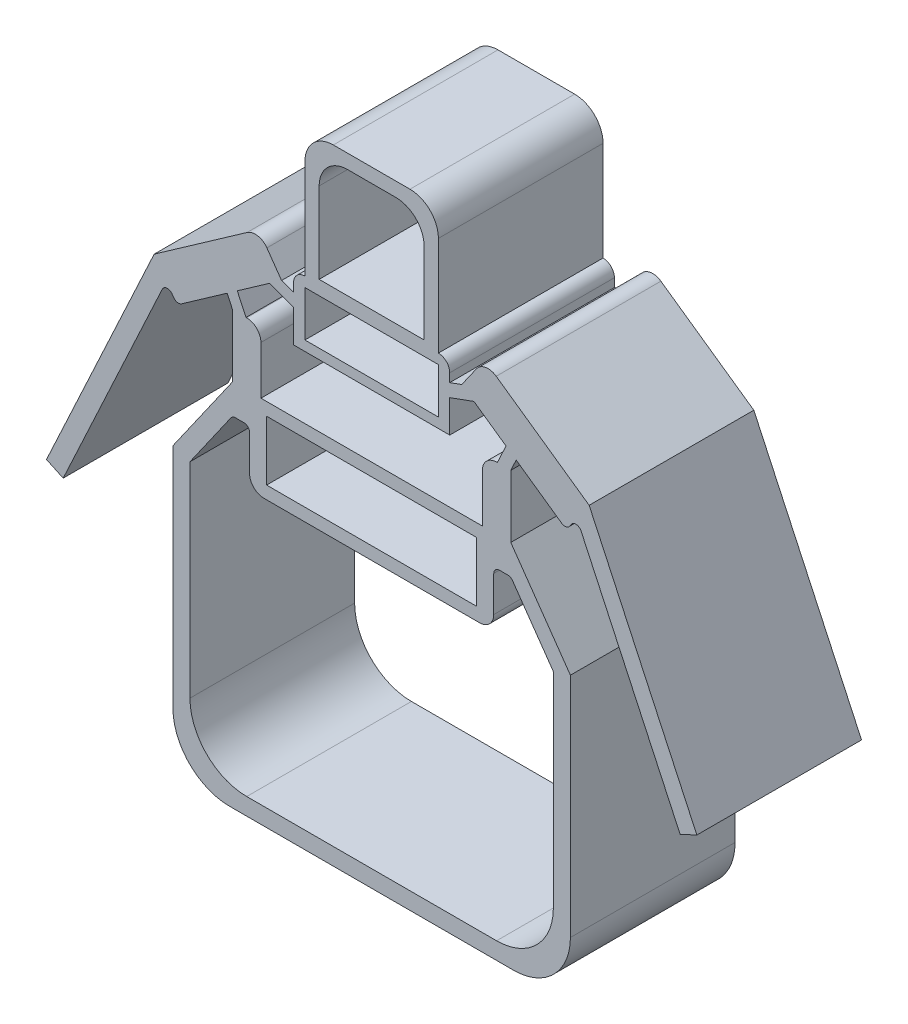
ISO-10303-21;
HEADER;
FILE_DESCRIPTION(('STEP AP214'),'2;1');
FILE_NAME('part.step','',(''),(''),'','','');
FILE_SCHEMA(('AUTOMOTIVE_DESIGN { 1 0 10303 214 1 1 1 1 }'));
ENDSEC;
DATA;
#1=APPLICATION_CONTEXT('core data for automotive mechanical design processes');
#2=APPLICATION_PROTOCOL_DEFINITION('international standard','automotive_design',2000,#1);
#3=PRODUCT_CONTEXT('',#1,'mechanical');
#4=PRODUCT('Part','Part','',(#3));
#5=PRODUCT_RELATED_PRODUCT_CATEGORY('part','',(#4));
#6=PRODUCT_DEFINITION_FORMATION('','',#4);
#7=PRODUCT_DEFINITION_CONTEXT('part definition',#1,'design');
#8=PRODUCT_DEFINITION('design','',#6,#7);
#9=PRODUCT_DEFINITION_SHAPE('','',#8);
#10=(LENGTH_UNIT() NAMED_UNIT(*) SI_UNIT(.MILLI.,.METRE.));
#11=(NAMED_UNIT(*) PLANE_ANGLE_UNIT() SI_UNIT($,.RADIAN.));
#12=(NAMED_UNIT(*) SI_UNIT($,.STERADIAN.) SOLID_ANGLE_UNIT());
#13=UNCERTAINTY_MEASURE_WITH_UNIT(LENGTH_MEASURE(1.E-05),#10,'distance_accuracy_value','');
#14=(GEOMETRIC_REPRESENTATION_CONTEXT(3) GLOBAL_UNCERTAINTY_ASSIGNED_CONTEXT((#13)) GLOBAL_UNIT_ASSIGNED_CONTEXT((#10,
#11,#12)) REPRESENTATION_CONTEXT('',''));
#15=CARTESIAN_POINT('',(0.,0.,0.));
#16=DIRECTION('',(0.,0.,1.));
#17=DIRECTION('',(1.,0.,0.));
#18=AXIS2_PLACEMENT_3D('',#15,#16,#17);
#19=CARTESIAN_POINT('',(3.9,1.4,5.8));
#20=DIRECTION('',(1.,0.,0.));
#21=DIRECTION('',(0.,0.,-1.));
#22=AXIS2_PLACEMENT_3D('',#19,#20,#21);
#23=PLANE('',#22);
#24=DIRECTION('',(0.,-1.,0.));
#25=VECTOR('',#24,1.);
#26=CARTESIAN_POINT('',(3.9,1.4,5.8));
#27=LINE('',#26,#25);
#28=CARTESIAN_POINT('',(3.9,3.1,5.8));
#29=VERTEX_POINT('',#28);
#30=CARTESIAN_POINT('',(3.9,1.4,5.8));
#31=VERTEX_POINT('',#30);
#32=EDGE_CURVE('E877',#29,#31,#27,.T.);
#33=ORIENTED_EDGE('',*,*,#32,.F.);
#34=DIRECTION('',(0.,0.,-1.));
#35=VECTOR('',#34,1.);
#36=CARTESIAN_POINT('',(3.9,3.1,5.8));
#37=LINE('',#36,#35);
#38=CARTESIAN_POINT('',(3.9,3.1,0.));
#39=VERTEX_POINT('',#38);
#40=EDGE_CURVE('E1027',#29,#39,#37,.T.);
#41=ORIENTED_EDGE('',*,*,#40,.T.);
#42=DIRECTION('',(0.,-1.,0.));
#43=VECTOR('',#42,1.);
#44=CARTESIAN_POINT('',(3.9,1.4,0.));
#45=LINE('',#44,#43);
#46=CARTESIAN_POINT('',(3.9,1.4,0.));
#47=VERTEX_POINT('',#46);
#48=EDGE_CURVE('E876',#39,#47,#45,.T.);
#49=ORIENTED_EDGE('',*,*,#48,.T.);
#50=DIRECTION('',(0.,0.,-1.));
#51=VECTOR('',#50,1.);
#52=CARTESIAN_POINT('',(3.9,1.4,5.8));
#53=LINE('',#52,#51);
#54=EDGE_CURVE('E989',#31,#47,#53,.T.);
#55=ORIENTED_EDGE('',*,*,#54,.F.);
#56=EDGE_LOOP('',(#33,#41,#49,#55));
#57=FACE_BOUND('',#56,.T.);
#58=ADVANCED_FACE('F37',(#57),#23,.F.);
#59=CARTESIAN_POINT('',(-3.9,1.4,5.8));
#60=DIRECTION('',(0.,-1.,0.));
#61=DIRECTION('',(1.,0.,0.));
#62=AXIS2_PLACEMENT_3D('',#59,#60,#61);
#63=PLANE('',#62);
#64=DIRECTION('',(-1.,0.,0.));
#65=VECTOR('',#64,1.);
#66=CARTESIAN_POINT('',(-3.9,1.4,0.));
#67=LINE('',#66,#65);
#68=CARTESIAN_POINT('',(-3.9,1.4,0.));
#69=VERTEX_POINT('',#68);
#70=EDGE_CURVE('E917',#47,#69,#67,.T.);
#71=ORIENTED_EDGE('',*,*,#70,.T.);
#72=DIRECTION('',(0.,0.,-1.));
#73=VECTOR('',#72,1.);
#74=CARTESIAN_POINT('',(-3.9,1.4,5.8));
#75=LINE('',#74,#73);
#76=CARTESIAN_POINT('',(-3.9,1.4,5.8));
#77=VERTEX_POINT('',#76);
#78=EDGE_CURVE('E986',#77,#69,#75,.T.);
#79=ORIENTED_EDGE('',*,*,#78,.F.);
#80=DIRECTION('',(-1.,0.,0.));
#81=VECTOR('',#80,1.);
#82=CARTESIAN_POINT('',(-3.9,1.4,5.8));
#83=LINE('',#82,#81);
#84=EDGE_CURVE('E879',#31,#77,#83,.T.);
#85=ORIENTED_EDGE('',*,*,#84,.F.);
#86=ORIENTED_EDGE('',*,*,#54,.T.);
#87=EDGE_LOOP('',(#71,#79,#85,#86));
#88=FACE_BOUND('',#87,.T.);
#89=ADVANCED_FACE('F1335',(#88),#63,.F.);
#90=CARTESIAN_POINT('',(4.9,3.6,5.8));
#91=DIRECTION('',(-1.,0.,0.));
#92=DIRECTION('',(0.,-1.,0.));
#93=AXIS2_PLACEMENT_3D('',#90,#91,#92);
#94=PLANE('',#93);
#95=DIRECTION('',(0.,1.,0.));
#96=VECTOR('',#95,1.);
#97=CARTESIAN_POINT('',(4.9,3.6,5.8));
#98=LINE('',#97,#96);
#99=CARTESIAN_POINT('',(4.9,1.4,5.8));
#100=VERTEX_POINT('',#99);
#101=CARTESIAN_POINT('',(4.9,3.6,5.8));
#102=VERTEX_POINT('',#101);
#103=EDGE_CURVE('E883',#100,#102,#98,.T.);
#104=ORIENTED_EDGE('',*,*,#103,.F.);
#105=DIRECTION('',(0.,0.,1.));
#106=VECTOR('',#105,1.);
#107=CARTESIAN_POINT('',(4.9,1.4,-19.1049731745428));
#108=LINE('',#107,#106);
#109=CARTESIAN_POINT('',(4.9,1.4,0.));
#110=VERTEX_POINT('',#109);
#111=EDGE_CURVE('E664',#110,#100,#108,.T.);
#112=ORIENTED_EDGE('',*,*,#111,.F.);
#113=DIRECTION('',(0.,1.,0.));
#114=VECTOR('',#113,1.);
#115=CARTESIAN_POINT('',(4.9,3.6,0.));
#116=LINE('',#115,#114);
#117=CARTESIAN_POINT('',(4.9,3.6,0.));
#118=VERTEX_POINT('',#117);
#119=EDGE_CURVE('E920',#110,#118,#116,.T.);
#120=ORIENTED_EDGE('',*,*,#119,.T.);
#121=DIRECTION('',(0.,0.,-1.));
#122=VECTOR('',#121,1.);
#123=CARTESIAN_POINT('',(4.9,3.6,5.8));
#124=LINE('',#123,#122);
#125=EDGE_CURVE('E983',#102,#118,#124,.T.);
#126=ORIENTED_EDGE('',*,*,#125,.F.);
#127=EDGE_LOOP('',(#104,#112,#120,#126));
#128=FACE_BOUND('',#127,.T.);
#129=ADVANCED_FACE('F1341',(#128),#94,.F.);
#130=CARTESIAN_POINT('',(4.9,3.6,5.8));
#131=DIRECTION('',(-0.906307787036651,0.422618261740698,0.));
#132=DIRECTION('',(-0.422618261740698,-0.906307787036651,0.));
#133=AXIS2_PLACEMENT_3D('',#130,#131,#132);
#134=PLANE('',#133);
#135=DIRECTION('',(0.422618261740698,0.906307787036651,0.));
#136=VECTOR('',#135,1.);
#137=CARTESIAN_POINT('',(4.9,3.6,0.));
#138=LINE('',#137,#136);
#139=CARTESIAN_POINT('',(5.09017821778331,4.00783850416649,0.));
#140=VERTEX_POINT('',#139);
#141=EDGE_CURVE('E922',#118,#140,#138,.T.);
#142=ORIENTED_EDGE('',*,*,#141,.T.);
#143=DIRECTION('',(0.,0.,-1.));
#144=VECTOR('',#143,1.);
#145=CARTESIAN_POINT('',(5.09017821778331,4.00783850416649,5.8));
#146=LINE('',#145,#144);
#147=CARTESIAN_POINT('',(5.09017821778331,4.00783850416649,5.8));
#148=VERTEX_POINT('',#147);
#149=EDGE_CURVE('E980',#148,#140,#146,.T.);
#150=ORIENTED_EDGE('',*,*,#149,.F.);
#151=DIRECTION('',(0.422618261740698,0.906307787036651,0.));
#152=VECTOR('',#151,1.);
#153=CARTESIAN_POINT('',(4.9,3.6,5.8));
#154=LINE('',#153,#152);
#155=EDGE_CURVE('E885',#102,#148,#154,.T.);
#156=ORIENTED_EDGE('',*,*,#155,.F.);
#157=ORIENTED_EDGE('',*,*,#125,.T.);
#158=EDGE_LOOP('',(#142,#150,#156,#157));
#159=FACE_BOUND('',#158,.T.);
#160=ADVANCED_FACE('F1465',(#159),#134,.F.);
#161=CARTESIAN_POINT('',(5.09017821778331,4.00783850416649,5.8));
#162=DIRECTION('',(0.574593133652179,0.818439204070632,0.));
#163=DIRECTION('',(-0.818439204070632,0.574593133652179,0.));
#164=AXIS2_PLACEMENT_3D('',#161,#162,#163);
#165=PLANE('',#164);
#166=DIRECTION('',(0.818439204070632,-0.574593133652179,0.));
#167=VECTOR('',#166,1.);
#168=CARTESIAN_POINT('',(5.09017821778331,4.00783850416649,0.));
#169=LINE('',#168,#167);
#170=CARTESIAN_POINT('',(6.69215025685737,2.88315858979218,0.));
#171=VERTEX_POINT('',#170);
#172=EDGE_CURVE('E924',#140,#171,#169,.T.);
#173=ORIENTED_EDGE('',*,*,#172,.T.);
#174=DIRECTION('',(0.,0.,-1.));
#175=VECTOR('',#174,1.);
#176=CARTESIAN_POINT('',(6.69215025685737,2.88315858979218,5.8));
#177=LINE('',#176,#175);
#178=CARTESIAN_POINT('',(6.69215025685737,2.88315858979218,5.8));
#179=VERTEX_POINT('',#178);
#180=EDGE_CURVE('E1182',#171,#179,#177,.F.);
#181=ORIENTED_EDGE('',*,*,#180,.T.);
#182=DIRECTION('',(0.818439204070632,-0.574593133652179,0.));
#183=VECTOR('',#182,1.);
#184=CARTESIAN_POINT('',(5.09017821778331,4.00783850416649,5.8));
#185=LINE('',#184,#183);
#186=EDGE_CURVE('E887',#148,#179,#185,.T.);
#187=ORIENTED_EDGE('',*,*,#186,.F.);
#188=ORIENTED_EDGE('',*,*,#149,.T.);
#189=EDGE_LOOP('',(#173,#181,#187,#188));
#190=FACE_BOUND('',#189,.T.);
#191=ADVANCED_FACE('F1461',(#190),#165,.F.);
#192=CARTESIAN_POINT('',(6.8558380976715,2.76823996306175,5.8));
#193=DIRECTION('',(-0.818439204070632,0.574593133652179,0.));
#194=DIRECTION('',(-0.574593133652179,-0.818439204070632,0.));
#195=AXIS2_PLACEMENT_3D('',#192,#193,#194);
#196=PLANE('',#195);
#197=DIRECTION('',(0.574593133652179,0.818439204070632,0.));
#198=VECTOR('',#197,1.);
#199=CARTESIAN_POINT('',(6.8558380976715,2.76823996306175,0.));
#200=LINE('',#199,#198);
#201=CARTESIAN_POINT('',(6.97075672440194,2.93192780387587,0.));
#202=VERTEX_POINT('',#201);
#203=CARTESIAN_POINT('',(7.03027873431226,3.01670978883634,0.));
#204=VERTEX_POINT('',#203);
#205=EDGE_CURVE('E927',#202,#204,#200,.T.);
#206=ORIENTED_EDGE('',*,*,#205,.T.);
#207=DIRECTION('',(0.,0.,1.));
#208=VECTOR('',#207,1.);
#209=CARTESIAN_POINT('',(7.03027873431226,3.01670978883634,5.8));
#210=LINE('',#209,#208);
#211=CARTESIAN_POINT('',(7.03027873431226,3.01670978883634,5.8));
#212=VERTEX_POINT('',#211);
#213=EDGE_CURVE('E1159',#204,#212,#210,.T.);
#214=ORIENTED_EDGE('',*,*,#213,.T.);
#215=DIRECTION('',(0.574593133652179,0.818439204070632,0.));
#216=VECTOR('',#215,1.);
#217=CARTESIAN_POINT('',(6.8558380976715,2.76823996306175,5.8));
#218=LINE('',#217,#216);
#219=CARTESIAN_POINT('',(6.97075672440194,2.93192780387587,5.8));
#220=VERTEX_POINT('',#219);
#221=EDGE_CURVE('E890',#220,#212,#218,.T.);
#222=ORIENTED_EDGE('',*,*,#221,.F.);
#223=DIRECTION('',(0.,0.,-1.));
#224=VECTOR('',#223,1.);
#225=CARTESIAN_POINT('',(6.97075672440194,2.93192780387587,5.8));
#226=LINE('',#225,#224);
#227=EDGE_CURVE('E1156',#220,#202,#226,.T.);
#228=ORIENTED_EDGE('',*,*,#227,.T.);
#229=EDGE_LOOP('',(#206,#214,#222,#228));
#230=FACE_BOUND('',#229,.T.);
#231=ADVANCED_FACE('F1457',(#230),#196,.F.);
#232=CARTESIAN_POINT('',(3.97729206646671,6.49972395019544,5.8));
#233=DIRECTION('',(-0.574593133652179,-0.818439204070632,0.));
#234=DIRECTION('',(0.818439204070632,-0.574593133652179,0.));
#235=AXIS2_PLACEMENT_3D('',#232,#233,#234);
#236=PLANE('',#235);
#237=DIRECTION('',(-0.818439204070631,0.574593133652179,0.));
#238=VECTOR('',#237,1.);
#239=CARTESIAN_POINT('',(3.97729206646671,6.49972395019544,0.));
#240=LINE('',#239,#238);
#241=CARTESIAN_POINT('',(7.66026848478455,3.91405484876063,0.));
#242=VERTEX_POINT('',#241);
#243=CARTESIAN_POINT('',(4.38651166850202,6.21242738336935,0.));
#244=VERTEX_POINT('',#243);
#245=EDGE_CURVE('E930',#242,#244,#240,.T.);
#246=ORIENTED_EDGE('',*,*,#245,.T.);
#247=DIRECTION('',(0.,0.,-1.));
#248=VECTOR('',#247,1.);
#249=CARTESIAN_POINT('',(4.38651166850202,6.21242738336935,5.8));
#250=LINE('',#249,#248);
#251=CARTESIAN_POINT('',(4.38651166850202,6.21242738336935,5.8));
#252=VERTEX_POINT('',#251);
#253=EDGE_CURVE('E1199',#244,#252,#250,.F.);
#254=ORIENTED_EDGE('',*,*,#253,.T.);
#255=DIRECTION('',(-0.818439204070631,0.574593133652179,0.));
#256=VECTOR('',#255,1.);
#257=CARTESIAN_POINT('',(3.97729206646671,6.49972395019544,5.8));
#258=LINE('',#257,#256);
#259=CARTESIAN_POINT('',(7.66026848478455,3.91405484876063,5.8));
#260=VERTEX_POINT('',#259);
#261=EDGE_CURVE('E893',#260,#252,#258,.T.);
#262=ORIENTED_EDGE('',*,*,#261,.F.);
#263=DIRECTION('',(0.,0.,-1.));
#264=VECTOR('',#263,1.);
#265=CARTESIAN_POINT('',(7.66026848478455,3.91405484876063,5.8));
#266=LINE('',#265,#264);
#267=EDGE_CURVE('E977',#260,#242,#266,.T.);
#268=ORIENTED_EDGE('',*,*,#267,.T.);
#269=EDGE_LOOP('',(#246,#254,#262,#268));
#270=FACE_BOUND('',#269,.T.);
#271=ADVANCED_FACE('F1453',(#270),#236,.F.);
#272=CARTESIAN_POINT('',(3.97729206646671,6.49972395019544,5.8));
#273=DIRECTION('',(0.818439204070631,-0.574593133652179,0.));
#274=DIRECTION('',(0.574593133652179,0.818439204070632,0.));
#275=AXIS2_PLACEMENT_3D('',#272,#273,#274);
#276=PLANE('',#275);
#277=DIRECTION('',(-0.574593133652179,-0.818439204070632,0.));
#278=VECTOR('',#277,1.);
#279=CARTESIAN_POINT('',(3.97729206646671,6.49972395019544,5.8));
#280=LINE('',#279,#278);
#281=CARTESIAN_POINT('',(3.68999549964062,6.09050434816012,5.8));
#282=VERTEX_POINT('',#281);
#283=CARTESIAN_POINT('',(3.17286167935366,5.35390906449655,5.8));
#284=VERTEX_POINT('',#283);
#285=EDGE_CURVE('E896',#282,#284,#280,.T.);
#286=ORIENTED_EDGE('',*,*,#285,.F.);
#287=DIRECTION('',(0.,0.,-1.));
#288=VECTOR('',#287,1.);
#289=CARTESIAN_POINT('',(3.68999549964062,6.09050434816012,5.8));
#290=LINE('',#289,#288);
#291=CARTESIAN_POINT('',(3.68999549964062,6.09050434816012,0.));
#292=VERTEX_POINT('',#291);
#293=EDGE_CURVE('E1192',#282,#292,#290,.T.);
#294=ORIENTED_EDGE('',*,*,#293,.T.);
#295=DIRECTION('',(-0.574593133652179,-0.818439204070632,0.));
#296=VECTOR('',#295,1.);
#297=CARTESIAN_POINT('',(3.97729206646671,6.49972395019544,0.));
#298=LINE('',#297,#296);
#299=CARTESIAN_POINT('',(3.17286167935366,5.35390906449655,0.));
#300=VERTEX_POINT('',#299);
#301=EDGE_CURVE('E933',#292,#300,#298,.T.);
#302=ORIENTED_EDGE('',*,*,#301,.T.);
#303=DIRECTION('',(0.,0.,-1.));
#304=VECTOR('',#303,1.);
#305=CARTESIAN_POINT('',(3.17286167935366,5.35390906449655,5.8));
#306=LINE('',#305,#304);
#307=EDGE_CURVE('E974',#284,#300,#306,.T.);
#308=ORIENTED_EDGE('',*,*,#307,.F.);
#309=EDGE_LOOP('',(#286,#294,#302,#308));
#310=FACE_BOUND('',#309,.T.);
#311=ADVANCED_FACE('F1449',(#310),#276,.F.);
#312=CARTESIAN_POINT('',(2.75,5.2,5.8));
#313=DIRECTION('',(0.342020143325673,-0.939692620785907,0.));
#314=DIRECTION('',(0.939692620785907,0.342020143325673,0.));
#315=AXIS2_PLACEMENT_3D('',#312,#313,#314);
#316=PLANE('',#315);
#317=DIRECTION('',(-0.939692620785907,-0.342020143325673,0.));
#318=VECTOR('',#317,1.);
#319=CARTESIAN_POINT('',(2.75,5.2,0.));
#320=LINE('',#319,#318);
#321=CARTESIAN_POINT('',(2.75,5.2,0.));
#322=VERTEX_POINT('',#321);
#323=EDGE_CURVE('E935',#300,#322,#320,.T.);
#324=ORIENTED_EDGE('',*,*,#323,.T.);
#325=DIRECTION('',(0.,0.,-1.));
#326=VECTOR('',#325,1.);
#327=CARTESIAN_POINT('',(2.75,5.2,5.8));
#328=LINE('',#327,#326);
#329=CARTESIAN_POINT('',(2.75,5.2,5.8));
#330=VERTEX_POINT('',#329);
#331=EDGE_CURVE('E971',#330,#322,#328,.T.);
#332=ORIENTED_EDGE('',*,*,#331,.F.);
#333=DIRECTION('',(-0.939692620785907,-0.342020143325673,0.));
#334=VECTOR('',#333,1.);
#335=CARTESIAN_POINT('',(2.75,5.2,5.8));
#336=LINE('',#335,#334);
#337=EDGE_CURVE('E898',#284,#330,#336,.T.);
#338=ORIENTED_EDGE('',*,*,#337,.F.);
#339=ORIENTED_EDGE('',*,*,#307,.T.);
#340=EDGE_LOOP('',(#324,#332,#338,#339));
#341=FACE_BOUND('',#340,.T.);
#342=ADVANCED_FACE('F1445',(#341),#316,.F.);
#343=CARTESIAN_POINT('',(-2.75,5.2,5.8));
#344=DIRECTION('',(1.,0.,0.));
#345=DIRECTION('',(0.,0.,-1.));
#346=AXIS2_PLACEMENT_3D('',#343,#344,#345);
#347=PLANE('',#346);
#348=DIRECTION('',(0.,-1.,0.));
#349=VECTOR('',#348,1.);
#350=CARTESIAN_POINT('',(-2.75,5.2,5.8));
#351=LINE('',#350,#349);
#352=CARTESIAN_POINT('',(-2.75,4.74240355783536,5.8));
#353=VERTEX_POINT('',#352);
#354=CARTESIAN_POINT('',(-2.75,3.6,5.8));
#355=VERTEX_POINT('',#354);
#356=EDGE_CURVE('E900',#353,#355,#351,.T.);
#357=ORIENTED_EDGE('',*,*,#356,.F.);
#358=DIRECTION('',(0.,0.,-1.));
#359=VECTOR('',#358,1.);
#360=CARTESIAN_POINT('',(-2.75,4.74240355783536,5.8));
#361=LINE('',#360,#359);
#362=CARTESIAN_POINT('',(-2.75,4.74240355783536,0.));
#363=VERTEX_POINT('',#362);
#364=EDGE_CURVE('E867',#353,#363,#361,.T.);
#365=ORIENTED_EDGE('',*,*,#364,.T.);
#366=DIRECTION('',(0.,-1.,0.));
#367=VECTOR('',#366,1.);
#368=CARTESIAN_POINT('',(-2.75,5.2,0.));
#369=LINE('',#368,#367);
#370=CARTESIAN_POINT('',(-2.75,3.6,0.));
#371=VERTEX_POINT('',#370);
#372=EDGE_CURVE('E937',#363,#371,#369,.T.);
#373=ORIENTED_EDGE('',*,*,#372,.T.);
#374=DIRECTION('',(0.,0.,-1.));
#375=VECTOR('',#374,1.);
#376=CARTESIAN_POINT('',(-2.75,3.6,5.8));
#377=LINE('',#376,#375);
#378=EDGE_CURVE('E965',#355,#371,#377,.T.);
#379=ORIENTED_EDGE('',*,*,#378,.F.);
#380=EDGE_LOOP('',(#357,#365,#373,#379));
#381=FACE_BOUND('',#380,.T.);
#382=ADVANCED_FACE('F1441',(#381),#347,.F.);
#383=CARTESIAN_POINT('',(-2.75,3.6,5.8));
#384=DIRECTION('',(0.,1.,0.));
#385=DIRECTION('',(0.,0.,1.));
#386=AXIS2_PLACEMENT_3D('',#383,#384,#385);
#387=PLANE('',#386);
#388=DIRECTION('',(1.,0.,0.));
#389=VECTOR('',#388,1.);
#390=CARTESIAN_POINT('',(-2.75,3.6,0.));
#391=LINE('',#390,#389);
#392=CARTESIAN_POINT('',(2.75,3.6,0.));
#393=VERTEX_POINT('',#392);
#394=EDGE_CURVE('E939',#371,#393,#391,.T.);
#395=ORIENTED_EDGE('',*,*,#394,.T.);
#396=DIRECTION('',(0.,0.,-1.));
#397=VECTOR('',#396,1.);
#398=CARTESIAN_POINT('',(2.75,3.6,5.8));
#399=LINE('',#398,#397);
#400=CARTESIAN_POINT('',(2.75,3.6,5.8));
#401=VERTEX_POINT('',#400);
#402=EDGE_CURVE('E962',#401,#393,#399,.T.);
#403=ORIENTED_EDGE('',*,*,#402,.F.);
#404=DIRECTION('',(1.,0.,0.));
#405=VECTOR('',#404,1.);
#406=CARTESIAN_POINT('',(-2.75,3.6,5.8));
#407=LINE('',#406,#405);
#408=EDGE_CURVE('E902',#355,#401,#407,.T.);
#409=ORIENTED_EDGE('',*,*,#408,.F.);
#410=ORIENTED_EDGE('',*,*,#378,.T.);
#411=EDGE_LOOP('',(#395,#403,#409,#410));
#412=FACE_BOUND('',#411,.T.);
#413=ADVANCED_FACE('F1437',(#412),#387,.F.);
#414=CARTESIAN_POINT('',(2.75,4.74240355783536,5.8));
#415=DIRECTION('',(-1.,0.,0.));
#416=DIRECTION('',(0.,-1.,0.));
#417=AXIS2_PLACEMENT_3D('',#414,#415,#416);
#418=PLANE('',#417);
#419=DIRECTION('',(0.,1.,0.));
#420=VECTOR('',#419,1.);
#421=CARTESIAN_POINT('',(2.75,4.74240355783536,0.));
#422=LINE('',#421,#420);
#423=CARTESIAN_POINT('',(2.75,4.74240355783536,0.));
#424=VERTEX_POINT('',#423);
#425=EDGE_CURVE('E941',#393,#424,#422,.T.);
#426=ORIENTED_EDGE('',*,*,#425,.T.);
#427=DIRECTION('',(0.,0.,-1.));
#428=VECTOR('',#427,1.);
#429=CARTESIAN_POINT('',(2.75,4.74240355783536,5.8));
#430=LINE('',#429,#428);
#431=CARTESIAN_POINT('',(2.75,4.74240355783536,5.8));
#432=VERTEX_POINT('',#431);
#433=EDGE_CURVE('E959',#432,#424,#430,.T.);
#434=ORIENTED_EDGE('',*,*,#433,.F.);
#435=DIRECTION('',(0.,1.,0.));
#436=VECTOR('',#435,1.);
#437=CARTESIAN_POINT('',(2.75,4.74240355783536,5.8));
#438=LINE('',#437,#436);
#439=EDGE_CURVE('E904',#401,#432,#438,.T.);
#440=ORIENTED_EDGE('',*,*,#439,.F.);
#441=ORIENTED_EDGE('',*,*,#402,.T.);
#442=EDGE_LOOP('',(#426,#434,#440,#441));
#443=FACE_BOUND('',#442,.T.);
#444=ADVANCED_FACE('F1433',(#443),#418,.F.);
#445=CARTESIAN_POINT('',(2.75,4.74240355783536,5.8));
#446=DIRECTION('',(-0.342020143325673,0.939692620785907,0.));
#447=DIRECTION('',(-0.939692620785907,-0.342020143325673,0.));
#448=AXIS2_PLACEMENT_3D('',#445,#446,#447);
#449=PLANE('',#448);
#450=DIRECTION('',(0.939692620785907,0.342020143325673,0.));
#451=VECTOR('',#450,1.);
#452=CARTESIAN_POINT('',(2.75,4.74240355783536,0.));
#453=LINE('',#452,#451);
#454=CARTESIAN_POINT('',(3.60211460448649,5.05254791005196,0.));
#455=VERTEX_POINT('',#454);
#456=EDGE_CURVE('E943',#424,#455,#453,.T.);
#457=ORIENTED_EDGE('',*,*,#456,.T.);
#458=DIRECTION('',(0.,0.,-1.));
#459=VECTOR('',#458,1.);
#460=CARTESIAN_POINT('',(3.60211460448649,5.05254791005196,5.8));
#461=LINE('',#460,#459);
#462=CARTESIAN_POINT('',(3.60211460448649,5.05254791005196,5.8));
#463=VERTEX_POINT('',#462);
#464=EDGE_CURVE('E956',#463,#455,#461,.T.);
#465=ORIENTED_EDGE('',*,*,#464,.F.);
#466=DIRECTION('',(0.939692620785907,0.342020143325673,0.));
#467=VECTOR('',#466,1.);
#468=CARTESIAN_POINT('',(2.75,4.74240355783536,5.8));
#469=LINE('',#468,#467);
#470=EDGE_CURVE('E906',#432,#463,#469,.T.);
#471=ORIENTED_EDGE('',*,*,#470,.F.);
#472=ORIENTED_EDGE('',*,*,#433,.T.);
#473=EDGE_LOOP('',(#457,#465,#471,#472));
#474=FACE_BOUND('',#473,.T.);
#475=ADVANCED_FACE('F1429',(#474),#449,.F.);
#476=CARTESIAN_POINT('',(3.60211460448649,5.05254791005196,5.8));
#477=DIRECTION('',(0.574593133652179,0.818439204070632,0.));
#478=DIRECTION('',(-0.818439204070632,0.574593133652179,0.));
#479=AXIS2_PLACEMENT_3D('',#476,#477,#478);
#480=PLANE('',#479);
#481=DIRECTION('',(0.818439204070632,-0.574593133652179,0.));
#482=VECTOR('',#481,1.);
#483=CARTESIAN_POINT('',(3.60211460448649,5.05254791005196,0.));
#484=LINE('',#483,#482);
#485=CARTESIAN_POINT('',(4.7327417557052,4.25878021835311,0.));
#486=VERTEX_POINT('',#485);
#487=EDGE_CURVE('E945',#455,#486,#484,.T.);
#488=ORIENTED_EDGE('',*,*,#487,.T.);
#489=DIRECTION('',(0.,0.,-1.));
#490=VECTOR('',#489,1.);
#491=CARTESIAN_POINT('',(4.7327417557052,4.25878021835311,5.8));
#492=LINE('',#491,#490);
#493=CARTESIAN_POINT('',(4.7327417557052,4.25878021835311,5.8));
#494=VERTEX_POINT('',#493);
#495=EDGE_CURVE('E953',#494,#486,#492,.T.);
#496=ORIENTED_EDGE('',*,*,#495,.F.);
#497=DIRECTION('',(0.818439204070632,-0.574593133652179,0.));
#498=VECTOR('',#497,1.);
#499=CARTESIAN_POINT('',(3.60211460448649,5.05254791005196,5.8));
#500=LINE('',#499,#498);
#501=EDGE_CURVE('E908',#463,#494,#500,.T.);
#502=ORIENTED_EDGE('',*,*,#501,.F.);
#503=ORIENTED_EDGE('',*,*,#464,.T.);
#504=EDGE_LOOP('',(#488,#496,#502,#503));
#505=FACE_BOUND('',#504,.T.);
#506=ADVANCED_FACE('F1425',(#505),#480,.F.);
#507=CARTESIAN_POINT('',(4.42554749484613,3.6,5.8));
#508=DIRECTION('',(0.906307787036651,-0.422618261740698,0.));
#509=DIRECTION('',(0.422618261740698,0.906307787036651,0.));
#510=AXIS2_PLACEMENT_3D('',#507,#508,#509);
#511=PLANE('',#510);
#512=DIRECTION('',(-0.422618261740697,-0.906307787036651,0.));
#513=VECTOR('',#512,1.);
#514=CARTESIAN_POINT('',(4.42554749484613,3.6,0.));
#515=LINE('',#514,#513);
#516=CARTESIAN_POINT('',(4.42554749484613,3.6,0.));
#517=VERTEX_POINT('',#516);
#518=EDGE_CURVE('E947',#486,#517,#515,.T.);
#519=ORIENTED_EDGE('',*,*,#518,.T.);
#520=DIRECTION('',(0.,0.,-1.));
#521=VECTOR('',#520,1.);
#522=CARTESIAN_POINT('',(4.42554749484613,3.6,5.8));
#523=LINE('',#522,#521);
#524=CARTESIAN_POINT('',(4.42554749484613,3.6,5.8));
#525=VERTEX_POINT('',#524);
#526=EDGE_CURVE('E915',#525,#517,#523,.T.);
#527=ORIENTED_EDGE('',*,*,#526,.F.);
#528=DIRECTION('',(-0.422618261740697,-0.906307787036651,0.));
#529=VECTOR('',#528,1.);
#530=CARTESIAN_POINT('',(4.42554749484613,3.6,5.8));
#531=LINE('',#530,#529);
#532=EDGE_CURVE('E910',#494,#525,#531,.T.);
#533=ORIENTED_EDGE('',*,*,#532,.F.);
#534=ORIENTED_EDGE('',*,*,#495,.T.);
#535=EDGE_LOOP('',(#519,#527,#533,#534));
#536=FACE_BOUND('',#535,.T.);
#537=ADVANCED_FACE('F1416',(#536),#511,.F.);
#538=CARTESIAN_POINT('',(3.9,3.6,5.8));
#539=DIRECTION('',(0.,-1.,0.));
#540=DIRECTION('',(0.,0.,-1.));
#541=AXIS2_PLACEMENT_3D('',#538,#539,#540);
#542=PLANE('',#541);
#543=DIRECTION('',(-1.,0.,0.));
#544=VECTOR('',#543,1.);
#545=CARTESIAN_POINT('',(3.9,3.6,0.));
#546=LINE('',#545,#544);
#547=CARTESIAN_POINT('',(4.4,3.6,0.));
#548=VERTEX_POINT('',#547);
#549=EDGE_CURVE('E880',#517,#548,#546,.T.);
#550=ORIENTED_EDGE('',*,*,#549,.T.);
#551=DIRECTION('',(0.,0.,-1.));
#552=VECTOR('',#551,1.);
#553=CARTESIAN_POINT('',(4.4,3.6,5.8));
#554=LINE('',#553,#552);
#555=CARTESIAN_POINT('',(4.4,3.6,5.8));
#556=VERTEX_POINT('',#555);
#557=EDGE_CURVE('E1030',#548,#556,#554,.F.);
#558=ORIENTED_EDGE('',*,*,#557,.T.);
#559=DIRECTION('',(-1.,0.,0.));
#560=VECTOR('',#559,1.);
#561=CARTESIAN_POINT('',(3.9,3.6,5.8));
#562=LINE('',#561,#560);
#563=EDGE_CURVE('E912',#525,#556,#562,.T.);
#564=ORIENTED_EDGE('',*,*,#563,.F.);
#565=ORIENTED_EDGE('',*,*,#526,.T.);
#566=EDGE_LOOP('',(#550,#558,#564,#565));
#567=FACE_BOUND('',#566,.T.);
#568=ADVANCED_FACE('F1407',(#567),#542,.F.);
#569=CARTESIAN_POINT('',(0.,0.,5.8));
#570=DIRECTION('',(0.,0.,-1.));
#571=DIRECTION('',(-1.,0.,0.));
#572=AXIS2_PLACEMENT_3D('',#569,#570,#571);
#573=PLANE('',#572);
#574=DIRECTION('',(1.,0.,0.));
#575=VECTOR('',#574,1.);
#576=CARTESIAN_POINT('',(-3.9,-1.6,5.8));
#577=LINE('',#576,#575);
#578=CARTESIAN_POINT('',(-3.8,-1.6,5.8));
#579=VERTEX_POINT('',#578);
#580=CARTESIAN_POINT('',(3.8,-1.6,5.8));
#581=VERTEX_POINT('',#580);
#582=EDGE_CURVE('E682',#579,#581,#577,.T.);
#583=ORIENTED_EDGE('',*,*,#582,.T.);
#584=CARTESIAN_POINT('',(3.8,-1.1,5.8));
#585=DIRECTION('',(0.,0.,-1.));
#586=DIRECTION('',(-1.,0.,0.));
#587=AXIS2_PLACEMENT_3D('',#584,#585,#586);
#588=CIRCLE('',#587,0.5);
#589=CARTESIAN_POINT('',(4.3,-1.1,5.8));
#590=VERTEX_POINT('',#589);
#591=EDGE_CURVE('E1145',#581,#590,#588,.F.);
#592=ORIENTED_EDGE('',*,*,#591,.T.);
#593=DIRECTION('',(0.,1.,0.));
#594=VECTOR('',#593,1.);
#595=CARTESIAN_POINT('',(4.3,0.353931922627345,5.8));
#596=LINE('',#595,#594);
#597=CARTESIAN_POINT('',(4.3,0.153931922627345,5.8));
#598=VERTEX_POINT('',#597);
#599=EDGE_CURVE('E1499',#590,#598,#596,.T.);
#600=ORIENTED_EDGE('',*,*,#599,.T.);
#601=CARTESIAN_POINT('',(4.5,0.153931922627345,5.8));
#602=DIRECTION('',(0.,0.,-1.));
#603=DIRECTION('',(-1.,0.,0.));
#604=AXIS2_PLACEMENT_3D('',#601,#602,#603);
#605=CIRCLE('',#604,0.2);
#606=CARTESIAN_POINT('',(4.5,0.353931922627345,5.8));
#607=VERTEX_POINT('',#606);
#608=EDGE_CURVE('E1129',#598,#607,#605,.T.);
#609=ORIENTED_EDGE('',*,*,#608,.T.);
#610=DIRECTION('',(-1.,0.,0.));
#611=VECTOR('',#610,1.);
#612=CARTESIAN_POINT('',(4.9,0.353931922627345,5.8));
#613=LINE('',#612,#611);
#614=CARTESIAN_POINT('',(4.79588658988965,0.353931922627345,5.8));
#615=VERTEX_POINT('',#614);
#616=EDGE_CURVE('E1486',#615,#607,#613,.T.);
#617=ORIENTED_EDGE('',*,*,#616,.F.);
#618=CARTESIAN_POINT('',(4.79588658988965,0.153931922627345,5.8));
#619=DIRECTION('',(0.,0.,-1.));
#620=DIRECTION('',(-1.,0.,0.));
#621=AXIS2_PLACEMENT_3D('',#618,#619,#620);
#622=CIRCLE('',#621,0.2);
#623=CARTESIAN_POINT('',(4.95971699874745,0.268647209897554,5.8));
#624=VERTEX_POINT('',#623);
#625=EDGE_CURVE('E1134',#615,#624,#622,.T.);
#626=ORIENTED_EDGE('',*,*,#625,.T.);
#627=DIRECTION('',(0.573576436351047,-0.819152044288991,0.));
#628=VECTOR('',#627,1.);
#629=CARTESIAN_POINT('',(6.4,-1.78829008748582,5.8));
#630=LINE('',#629,#628);
#631=CARTESIAN_POINT('',(6.4,-1.78829008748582,5.8));
#632=VERTEX_POINT('',#631);
#633=EDGE_CURVE('E1276',#624,#632,#630,.T.);
#634=ORIENTED_EDGE('',*,*,#633,.T.);
#635=DIRECTION('',(0.,-1.,0.));
#636=VECTOR('',#635,1.);
#637=CARTESIAN_POINT('',(6.4,-1.78829008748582,5.8));
#638=LINE('',#637,#636);
#639=CARTESIAN_POINT('',(6.4,-9.,5.8));
#640=VERTEX_POINT('',#639);
#641=EDGE_CURVE('E622',#632,#640,#638,.T.);
#642=ORIENTED_EDGE('',*,*,#641,.T.);
#643=CARTESIAN_POINT('',(4.4,-9.,5.8));
#644=DIRECTION('',(0.,0.,-1.));
#645=DIRECTION('',(-1.,0.,0.));
#646=AXIS2_PLACEMENT_3D('',#643,#644,#645);
#647=CIRCLE('',#646,2.);
#648=CARTESIAN_POINT('',(4.4,-11.,5.8));
#649=VERTEX_POINT('',#648);
#650=EDGE_CURVE('E1095',#640,#649,#647,.T.);
#651=ORIENTED_EDGE('',*,*,#650,.T.);
#652=DIRECTION('',(-1.,0.,0.));
#653=VECTOR('',#652,1.);
#654=CARTESIAN_POINT('',(6.4,-11.,5.8));
#655=LINE('',#654,#653);
#656=CARTESIAN_POINT('',(-4.4,-11.,5.8));
#657=VERTEX_POINT('',#656);
#658=EDGE_CURVE('E1272',#649,#657,#655,.T.);
#659=ORIENTED_EDGE('',*,*,#658,.T.);
#660=CARTESIAN_POINT('',(-4.4,-9.,5.8));
#661=DIRECTION('',(0.,0.,-1.));
#662=DIRECTION('',(-1.,0.,0.));
#663=AXIS2_PLACEMENT_3D('',#660,#661,#662);
#664=CIRCLE('',#663,2.);
#665=CARTESIAN_POINT('',(-6.4,-9.,5.8));
#666=VERTEX_POINT('',#665);
#667=EDGE_CURVE('E1098',#657,#666,#664,.T.);
#668=ORIENTED_EDGE('',*,*,#667,.T.);
#669=DIRECTION('',(0.,1.,0.));
#670=VECTOR('',#669,1.);
#671=CARTESIAN_POINT('',(-6.4,-11.,5.8));
#672=LINE('',#671,#670);
#673=CARTESIAN_POINT('',(-6.4,-1.78829008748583,5.8));
#674=VERTEX_POINT('',#673);
#675=EDGE_CURVE('E1267',#666,#674,#672,.T.);
#676=ORIENTED_EDGE('',*,*,#675,.T.);
#677=DIRECTION('',(0.573576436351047,0.819152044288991,0.));
#678=VECTOR('',#677,1.);
#679=CARTESIAN_POINT('',(-6.4,-1.78829008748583,5.8));
#680=LINE('',#679,#678);
#681=CARTESIAN_POINT('',(-4.95971699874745,0.268647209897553,5.8));
#682=VERTEX_POINT('',#681);
#683=EDGE_CURVE('E1262',#674,#682,#680,.T.);
#684=ORIENTED_EDGE('',*,*,#683,.T.);
#685=CARTESIAN_POINT('',(-4.79588658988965,0.153931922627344,5.8));
#686=DIRECTION('',(0.,0.,-1.));
#687=DIRECTION('',(-1.,0.,0.));
#688=AXIS2_PLACEMENT_3D('',#685,#686,#687);
#689=CIRCLE('',#688,0.2);
#690=CARTESIAN_POINT('',(-4.79588658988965,0.353931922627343,5.8));
#691=VERTEX_POINT('',#690);
#692=EDGE_CURVE('E1121',#682,#691,#689,.T.);
#693=ORIENTED_EDGE('',*,*,#692,.T.);
#694=DIRECTION('',(-1.,0.,0.));
#695=VECTOR('',#694,1.);
#696=CARTESIAN_POINT('',(-3.9,0.353931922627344,5.8));
#697=LINE('',#696,#695);
#698=CARTESIAN_POINT('',(-4.5,0.353931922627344,5.8));
#699=VERTEX_POINT('',#698);
#700=EDGE_CURVE('E1493',#699,#691,#697,.T.);
#701=ORIENTED_EDGE('',*,*,#700,.F.);
#702=CARTESIAN_POINT('',(-4.5,0.153931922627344,5.8));
#703=DIRECTION('',(0.,0.,-1.));
#704=DIRECTION('',(-1.,0.,0.));
#705=AXIS2_PLACEMENT_3D('',#702,#703,#704);
#706=CIRCLE('',#705,0.2);
#707=CARTESIAN_POINT('',(-4.3,0.153931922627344,5.8));
#708=VERTEX_POINT('',#707);
#709=EDGE_CURVE('E1125',#699,#708,#706,.T.);
#710=ORIENTED_EDGE('',*,*,#709,.T.);
#711=DIRECTION('',(0.,-1.,0.));
#712=VECTOR('',#711,1.);
#713=CARTESIAN_POINT('',(-4.3,0.353931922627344,5.8));
#714=LINE('',#713,#712);
#715=CARTESIAN_POINT('',(-4.3,-1.1,5.8));
#716=VERTEX_POINT('',#715);
#717=EDGE_CURVE('E1504',#708,#716,#714,.T.);
#718=ORIENTED_EDGE('',*,*,#717,.T.);
#719=CARTESIAN_POINT('',(-3.8,-1.1,5.8));
#720=DIRECTION('',(0.,0.,-1.));
#721=DIRECTION('',(-1.,0.,0.));
#722=AXIS2_PLACEMENT_3D('',#719,#720,#721);
#723=CIRCLE('',#722,0.5);
#724=EDGE_CURVE('E1143',#716,#579,#723,.F.);
#725=ORIENTED_EDGE('',*,*,#724,.T.);
#726=EDGE_LOOP('',(#583,#592,#600,#609,#617,#626,#634,#642,#651,#659,#668,#676,#684,#693,#701,
#710,#718,#725));
#727=FACE_BOUND('',#726,.T.);
#728=DIRECTION('',(1.,0.,0.));
#729=VECTOR('',#728,1.);
#730=CARTESIAN_POINT('',(-3.7,-1.15,5.8));
#731=LINE('',#730,#729);
#732=CARTESIAN_POINT('',(-3.7,-1.15,5.8));
#733=VERTEX_POINT('',#732);
#734=CARTESIAN_POINT('',(3.7,-1.15,5.8));
#735=VERTEX_POINT('',#734);
#736=EDGE_CURVE('E660',#733,#735,#731,.T.);
#737=ORIENTED_EDGE('',*,*,#736,.F.);
#738=DIRECTION('',(0.,-1.,0.));
#739=VECTOR('',#738,1.);
#740=CARTESIAN_POINT('',(-3.7,-1.05,5.8));
#741=LINE('',#740,#739);
#742=CARTESIAN_POINT('',(-3.7,0.95,5.8));
#743=VERTEX_POINT('',#742);
#744=EDGE_CURVE('E770',#743,#733,#741,.T.);
#745=ORIENTED_EDGE('',*,*,#744,.F.);
#746=DIRECTION('',(1.,0.,0.));
#747=VECTOR('',#746,1.);
#748=CARTESIAN_POINT('',(-3.7,0.95,5.8));
#749=LINE('',#748,#747);
#750=CARTESIAN_POINT('',(3.7,0.95,5.8));
#751=VERTEX_POINT('',#750);
#752=EDGE_CURVE('E690',#743,#751,#749,.T.);
#753=ORIENTED_EDGE('',*,*,#752,.T.);
#754=DIRECTION('',(0.,1.,0.));
#755=VECTOR('',#754,1.);
#756=CARTESIAN_POINT('',(3.7,-1.05,5.8));
#757=LINE('',#756,#755);
#758=EDGE_CURVE('E773',#735,#751,#757,.T.);
#759=ORIENTED_EDGE('',*,*,#758,.F.);
#760=EDGE_LOOP('',(#737,#745,#753,#759));
#761=FACE_BOUND('',#760,.T.);
#762=DIRECTION('',(1.,0.,0.));
#763=VECTOR('',#762,1.);
#764=CARTESIAN_POINT('',(2.35,5.55,5.8));
#765=LINE('',#764,#763);
#766=CARTESIAN_POINT('',(-2.35,5.55,5.8));
#767=VERTEX_POINT('',#766);
#768=CARTESIAN_POINT('',(2.35,5.55,5.8));
#769=VERTEX_POINT('',#768);
#770=EDGE_CURVE('E737',#767,#769,#765,.T.);
#771=ORIENTED_EDGE('',*,*,#770,.T.);
#772=DIRECTION('',(0.,1.,0.));
#773=VECTOR('',#772,1.);
#774=CARTESIAN_POINT('',(2.35,5.55,5.8));
#775=LINE('',#774,#773);
#776=CARTESIAN_POINT('',(2.35,3.95,5.8));
#777=VERTEX_POINT('',#776);
#778=EDGE_CURVE('E781',#777,#769,#775,.T.);
#779=ORIENTED_EDGE('',*,*,#778,.F.);
#780=DIRECTION('',(1.,0.,0.));
#781=VECTOR('',#780,1.);
#782=CARTESIAN_POINT('',(-2.35,3.95,5.8));
#783=LINE('',#782,#781);
#784=CARTESIAN_POINT('',(-2.35,3.95,5.8));
#785=VERTEX_POINT('',#784);
#786=EDGE_CURVE('E785',#785,#777,#783,.T.);
#787=ORIENTED_EDGE('',*,*,#786,.F.);
#788=DIRECTION('',(0.,-1.,0.));
#789=VECTOR('',#788,1.);
#790=CARTESIAN_POINT('',(-2.35,5.55000000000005,5.8));
#791=LINE('',#790,#789);
#792=EDGE_CURVE('E765',#767,#785,#791,.T.);
#793=ORIENTED_EDGE('',*,*,#792,.F.);
#794=EDGE_LOOP('',(#771,#779,#787,#793));
#795=FACE_BOUND('',#794,.T.);
#796=ORIENTED_EDGE('',*,*,#261,.T.);
#797=CARTESIAN_POINT('',(4.09921510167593,5.80320778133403,5.8));
#798=DIRECTION('',(0.,0.,-1.));
#799=DIRECTION('',(-1.,0.,0.));
#800=AXIS2_PLACEMENT_3D('',#797,#798,#799);
#801=CIRCLE('',#800,0.5);
#802=EDGE_CURVE('E1202',#252,#282,#801,.F.);
#803=ORIENTED_EDGE('',*,*,#802,.T.);
#804=ORIENTED_EDGE('',*,*,#285,.T.);
#805=ORIENTED_EDGE('',*,*,#337,.T.);
#806=DIRECTION('',(0.,1.,0.));
#807=VECTOR('',#806,1.);
#808=CARTESIAN_POINT('',(2.75,5.9,5.8));
#809=LINE('',#808,#807);
#810=CARTESIAN_POINT('',(2.75,5.5,5.8));
#811=VERTEX_POINT('',#810);
#812=EDGE_CURVE('E747',#330,#811,#809,.T.);
#813=ORIENTED_EDGE('',*,*,#812,.T.);
#814=CARTESIAN_POINT('',(2.35,5.5,5.8));
#815=DIRECTION('',(0.,0.,-1.));
#816=DIRECTION('',(-1.,0.,0.));
#817=AXIS2_PLACEMENT_3D('',#814,#815,#816);
#818=CIRCLE('',#817,0.4);
#819=CARTESIAN_POINT('',(2.35,5.9,5.8));
#820=VERTEX_POINT('',#819);
#821=EDGE_CURVE('E1000',#811,#820,#818,.F.);
#822=ORIENTED_EDGE('',*,*,#821,.T.);
#823=DIRECTION('',(0.,1.,0.));
#824=VECTOR('',#823,1.);
#825=CARTESIAN_POINT('',(2.35,5.9,5.8));
#826=LINE('',#825,#824);
#827=CARTESIAN_POINT('',(2.35,9.4,5.8));
#828=VERTEX_POINT('',#827);
#829=EDGE_CURVE('E632',#820,#828,#826,.T.);
#830=ORIENTED_EDGE('',*,*,#829,.T.);
#831=CARTESIAN_POINT('',(1.35,9.4,5.8));
#832=DIRECTION('',(0.,0.,-1.));
#833=DIRECTION('',(-1.,0.,0.));
#834=AXIS2_PLACEMENT_3D('',#831,#832,#833);
#835=CIRCLE('',#834,1.);
#836=CARTESIAN_POINT('',(1.35,10.4,5.8));
#837=VERTEX_POINT('',#836);
#838=EDGE_CURVE('E1037',#828,#837,#835,.F.);
#839=ORIENTED_EDGE('',*,*,#838,.T.);
#840=DIRECTION('',(-1.,0.,0.));
#841=VECTOR('',#840,1.);
#842=CARTESIAN_POINT('',(2.35,10.4,5.8));
#843=LINE('',#842,#841);
#844=CARTESIAN_POINT('',(-1.35,10.4,5.8));
#845=VERTEX_POINT('',#844);
#846=EDGE_CURVE('E628',#837,#845,#843,.T.);
#847=ORIENTED_EDGE('',*,*,#846,.T.);
#848=CARTESIAN_POINT('',(-1.35,9.4,5.8));
#849=DIRECTION('',(0.,0.,-1.));
#850=DIRECTION('',(-1.,0.,0.));
#851=AXIS2_PLACEMENT_3D('',#848,#849,#850);
#852=CIRCLE('',#851,1.);
#853=CARTESIAN_POINT('',(-2.35,9.4,5.8));
#854=VERTEX_POINT('',#853);
#855=EDGE_CURVE('E1035',#845,#854,#852,.F.);
#856=ORIENTED_EDGE('',*,*,#855,.T.);
#857=DIRECTION('',(0.,-1.,0.));
#858=VECTOR('',#857,1.);
#859=CARTESIAN_POINT('',(-2.35,5.9,5.8));
#860=LINE('',#859,#858);
#861=CARTESIAN_POINT('',(-2.35,5.9,5.8));
#862=VERTEX_POINT('',#861);
#863=EDGE_CURVE('E635',#854,#862,#860,.T.);
#864=ORIENTED_EDGE('',*,*,#863,.T.);
#865=CARTESIAN_POINT('',(-2.35,5.5,5.8));
#866=DIRECTION('',(0.,0.,-1.));
#867=DIRECTION('',(-1.,0.,0.));
#868=AXIS2_PLACEMENT_3D('',#865,#866,#867);
#869=CIRCLE('',#868,0.4);
#870=CARTESIAN_POINT('',(-2.75,5.5,5.8));
#871=VERTEX_POINT('',#870);
#872=EDGE_CURVE('E1002',#862,#871,#869,.F.);
#873=ORIENTED_EDGE('',*,*,#872,.T.);
#874=DIRECTION('',(0.,-1.,0.));
#875=VECTOR('',#874,1.);
#876=CARTESIAN_POINT('',(-2.75,5.2,5.8));
#877=LINE('',#876,#875);
#878=CARTESIAN_POINT('',(-2.75,5.2,5.8));
#879=VERTEX_POINT('',#878);
#880=EDGE_CURVE('E744',#871,#879,#877,.T.);
#881=ORIENTED_EDGE('',*,*,#880,.T.);
#882=DIRECTION('',(0.939692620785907,-0.342020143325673,0.));
#883=VECTOR('',#882,1.);
#884=CARTESIAN_POINT('',(-2.75,5.2,5.8));
#885=LINE('',#884,#883);
#886=CARTESIAN_POINT('',(-3.17286167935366,5.35390906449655,5.8));
#887=VERTEX_POINT('',#886);
#888=EDGE_CURVE('E807',#887,#879,#885,.T.);
#889=ORIENTED_EDGE('',*,*,#888,.F.);
#890=DIRECTION('',(0.574593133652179,-0.818439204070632,0.));
#891=VECTOR('',#890,1.);
#892=CARTESIAN_POINT('',(-3.97729206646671,6.49972395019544,5.8));
#893=LINE('',#892,#891);
#894=CARTESIAN_POINT('',(-3.68999549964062,6.09050434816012,5.8));
#895=VERTEX_POINT('',#894);
#896=EDGE_CURVE('E810',#895,#887,#893,.T.);
#897=ORIENTED_EDGE('',*,*,#896,.F.);
#898=CARTESIAN_POINT('',(-4.09921510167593,5.80320778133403,5.8));
#899=DIRECTION('',(0.,0.,-1.));
#900=DIRECTION('',(-1.,0.,0.));
#901=AXIS2_PLACEMENT_3D('',#898,#899,#900);
#902=CIRCLE('',#901,0.5);
#903=CARTESIAN_POINT('',(-4.38651166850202,6.21242738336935,5.8));
#904=VERTEX_POINT('',#903);
#905=EDGE_CURVE('E52',#895,#904,#902,.F.);
#906=ORIENTED_EDGE('',*,*,#905,.T.);
#907=DIRECTION('',(0.818439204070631,0.574593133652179,0.));
#908=VECTOR('',#907,1.);
#909=CARTESIAN_POINT('',(-3.97729206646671,6.49972395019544,5.8));
#910=LINE('',#909,#908);
#911=CARTESIAN_POINT('',(-7.66026848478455,3.91405484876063,5.8));
#912=VERTEX_POINT('',#911);
#913=EDGE_CURVE('E812',#912,#904,#910,.T.);
#914=ORIENTED_EDGE('',*,*,#913,.F.);
#915=DIRECTION('',(-0.421492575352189,-0.906831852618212,0.));
#916=VECTOR('',#915,1.);
#917=CARTESIAN_POINT('',(-7.66026848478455,3.91405484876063,5.8));
#918=LINE('',#917,#916);
#919=CARTESIAN_POINT('',(-11.4537016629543,-4.24743182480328,5.8));
#920=VERTEX_POINT('',#919);
#921=EDGE_CURVE('E721',#912,#920,#918,.T.);
#922=ORIENTED_EDGE('',*,*,#921,.T.);
#923=DIRECTION('',(0.906831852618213,-0.421492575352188,0.));
#924=VECTOR('',#923,1.);
#925=CARTESIAN_POINT('',(-11.4537016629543,-4.24743182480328,5.8));
#926=LINE('',#925,#924);
#927=CARTESIAN_POINT('',(-10.864697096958,-4.52119928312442,5.8));
#928=VERTEX_POINT('',#927);
#929=EDGE_CURVE('E726',#920,#928,#926,.T.);
#930=ORIENTED_EDGE('',*,*,#929,.T.);
#931=DIRECTION('',(0.421492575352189,0.906831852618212,0.));
#932=VECTOR('',#931,1.);
#933=CARTESIAN_POINT('',(-10.864697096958,-4.52119928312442,5.8));
#934=LINE('',#933,#932);
#935=CARTESIAN_POINT('',(-7.37533294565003,2.98608967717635,5.8));
#936=VERTEX_POINT('',#935);
#937=EDGE_CURVE('E722',#928,#936,#934,.T.);
#938=ORIENTED_EDGE('',*,*,#937,.T.);
#939=CARTESIAN_POINT('',(-7.19396657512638,2.90179116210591,5.8));
#940=DIRECTION('',(0.,0.,-1.));
#941=DIRECTION('',(-1.,0.,0.));
#942=AXIS2_PLACEMENT_3D('',#939,#940,#941);
#943=CIRCLE('',#942,0.2);
#944=CARTESIAN_POINT('',(-7.03027873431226,3.01670978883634,5.8));
#945=VERTEX_POINT('',#944);
#946=EDGE_CURVE('E1188',#936,#945,#943,.T.);
#947=ORIENTED_EDGE('',*,*,#946,.T.);
#948=DIRECTION('',(-0.574593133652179,0.818439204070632,0.));
#949=VECTOR('',#948,1.);
#950=CARTESIAN_POINT('',(-6.8558380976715,2.76823996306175,5.8));
#951=LINE('',#950,#949);
#952=CARTESIAN_POINT('',(-6.97075672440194,2.93192780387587,5.8));
#953=VERTEX_POINT('',#952);
#954=EDGE_CURVE('E814',#953,#945,#951,.T.);
#955=ORIENTED_EDGE('',*,*,#954,.F.);
#956=CARTESIAN_POINT('',(-6.80706888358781,3.04684643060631,5.8));
#957=DIRECTION('',(0.,0.,-1.));
#958=DIRECTION('',(-1.,0.,0.));
#959=AXIS2_PLACEMENT_3D('',#956,#957,#958);
#960=CIRCLE('',#959,0.2);
#961=CARTESIAN_POINT('',(-6.69215025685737,2.88315858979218,5.8));
#962=VERTEX_POINT('',#961);
#963=EDGE_CURVE('E1180',#953,#962,#960,.F.);
#964=ORIENTED_EDGE('',*,*,#963,.T.);
#965=DIRECTION('',(-0.818439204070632,-0.574593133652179,0.));
#966=VECTOR('',#965,1.);
#967=CARTESIAN_POINT('',(-5.09017821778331,4.00783850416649,5.8));
#968=LINE('',#967,#966);
#969=CARTESIAN_POINT('',(-5.09017821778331,4.00783850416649,5.8));
#970=VERTEX_POINT('',#969);
#971=EDGE_CURVE('E817',#970,#962,#968,.T.);
#972=ORIENTED_EDGE('',*,*,#971,.F.);
#973=DIRECTION('',(-0.422618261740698,0.906307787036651,0.));
#974=VECTOR('',#973,1.);
#975=CARTESIAN_POINT('',(-4.9,3.6,5.8));
#976=LINE('',#975,#974);
#977=CARTESIAN_POINT('',(-4.9,3.6,5.8));
#978=VERTEX_POINT('',#977);
#979=EDGE_CURVE('E820',#978,#970,#976,.T.);
#980=ORIENTED_EDGE('',*,*,#979,.F.);
#981=DIRECTION('',(0.,1.,0.));
#982=VECTOR('',#981,1.);
#983=CARTESIAN_POINT('',(-4.9,3.6,5.8));
#984=LINE('',#983,#982);
#985=CARTESIAN_POINT('',(-4.9,1.4,5.8));
#986=VERTEX_POINT('',#985);
#987=EDGE_CURVE('E823',#986,#978,#984,.T.);
#988=ORIENTED_EDGE('',*,*,#987,.F.);
#989=DIRECTION('',(-0.573576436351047,-0.819152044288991,0.));
#990=VECTOR('',#989,1.);
#991=CARTESIAN_POINT('',(-7.,-1.59911081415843,5.8));
#992=LINE('',#991,#990);
#993=CARTESIAN_POINT('',(-7.,-1.59911081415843,5.8));
#994=VERTEX_POINT('',#993);
#995=EDGE_CURVE('E1251',#986,#994,#992,.T.);
#996=ORIENTED_EDGE('',*,*,#995,.T.);
#997=DIRECTION('',(0.,-1.,0.));
#998=VECTOR('',#997,1.);
#999=CARTESIAN_POINT('',(-7.,-1.59911081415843,5.8));
#1000=LINE('',#999,#998);
#1001=CARTESIAN_POINT('',(-7.,-9.6,5.8));
#1002=VERTEX_POINT('',#1001);
#1003=EDGE_CURVE('E1261',#994,#1002,#1000,.T.);
#1004=ORIENTED_EDGE('',*,*,#1003,.T.);
#1005=CARTESIAN_POINT('',(-5.,-9.6,5.8));
#1006=DIRECTION('',(0.,0.,-1.));
#1007=DIRECTION('',(-1.,0.,0.));
#1008=AXIS2_PLACEMENT_3D('',#1005,#1006,#1007);
#1009=CIRCLE('',#1008,2.);
#1010=CARTESIAN_POINT('',(-5.,-11.6,5.8));
#1011=VERTEX_POINT('',#1010);
#1012=EDGE_CURVE('E1073',#1002,#1011,#1009,.F.);
#1013=ORIENTED_EDGE('',*,*,#1012,.T.);
#1014=DIRECTION('',(1.,0.,0.));
#1015=VECTOR('',#1014,1.);
#1016=CARTESIAN_POINT('',(-7.,-11.6,5.8));
#1017=LINE('',#1016,#1015);
#1018=CARTESIAN_POINT('',(5.,-11.6,5.8));
#1019=VERTEX_POINT('',#1018);
#1020=EDGE_CURVE('E1264',#1011,#1019,#1017,.T.);
#1021=ORIENTED_EDGE('',*,*,#1020,.T.);
#1022=CARTESIAN_POINT('',(5.,-9.6,5.8));
#1023=DIRECTION('',(0.,0.,-1.));
#1024=DIRECTION('',(-1.,0.,0.));
#1025=AXIS2_PLACEMENT_3D('',#1022,#1023,#1024);
#1026=CIRCLE('',#1025,2.);
#1027=CARTESIAN_POINT('',(7.,-9.6,5.8));
#1028=VERTEX_POINT('',#1027);
#1029=EDGE_CURVE('E1075',#1019,#1028,#1026,.F.);
#1030=ORIENTED_EDGE('',*,*,#1029,.T.);
#1031=DIRECTION('',(0.,1.,0.));
#1032=VECTOR('',#1031,1.);
#1033=CARTESIAN_POINT('',(7.,-11.6,5.8));
#1034=LINE('',#1033,#1032);
#1035=CARTESIAN_POINT('',(7.,-1.59911081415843,5.8));
#1036=VERTEX_POINT('',#1035);
#1037=EDGE_CURVE('E1318',#1028,#1036,#1034,.T.);
#1038=ORIENTED_EDGE('',*,*,#1037,.T.);
#1039=DIRECTION('',(-0.573576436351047,0.819152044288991,0.));
#1040=VECTOR('',#1039,1.);
#1041=CARTESIAN_POINT('',(4.9,1.4,5.8));
#1042=LINE('',#1041,#1040);
#1043=EDGE_CURVE('E605',#1036,#100,#1042,.T.);
#1044=ORIENTED_EDGE('',*,*,#1043,.T.);
#1045=ORIENTED_EDGE('',*,*,#103,.T.);
#1046=ORIENTED_EDGE('',*,*,#155,.T.);
#1047=ORIENTED_EDGE('',*,*,#186,.T.);
#1048=CARTESIAN_POINT('',(6.80706888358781,3.04684643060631,5.8));
#1049=DIRECTION('',(0.,0.,-1.));
#1050=DIRECTION('',(-1.,0.,0.));
#1051=AXIS2_PLACEMENT_3D('',#1048,#1049,#1050);
#1052=CIRCLE('',#1051,0.2);
#1053=EDGE_CURVE('E1178',#179,#220,#1052,.F.);
#1054=ORIENTED_EDGE('',*,*,#1053,.T.);
#1055=ORIENTED_EDGE('',*,*,#221,.T.);
#1056=CARTESIAN_POINT('',(7.19396657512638,2.90179116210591,5.8));
#1057=DIRECTION('',(0.,0.,-1.));
#1058=DIRECTION('',(-1.,0.,0.));
#1059=AXIS2_PLACEMENT_3D('',#1056,#1057,#1058);
#1060=CIRCLE('',#1059,0.2);
#1061=CARTESIAN_POINT('',(7.37533294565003,2.98608967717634,5.8));
#1062=VERTEX_POINT('',#1061);
#1063=EDGE_CURVE('E1184',#212,#1062,#1060,.T.);
#1064=ORIENTED_EDGE('',*,*,#1063,.T.);
#1065=DIRECTION('',(0.42149257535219,-0.906831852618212,0.));
#1066=VECTOR('',#1065,1.);
#1067=CARTESIAN_POINT('',(7.22932363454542,3.30022544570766,5.8));
#1068=LINE('',#1067,#1066);
#1069=CARTESIAN_POINT('',(10.8646970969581,-4.52119928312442,5.8));
#1070=VERTEX_POINT('',#1069);
#1071=EDGE_CURVE('E701',#1062,#1070,#1068,.T.);
#1072=ORIENTED_EDGE('',*,*,#1071,.T.);
#1073=DIRECTION('',(0.906831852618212,0.421492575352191,0.));
#1074=VECTOR('',#1073,1.);
#1075=CARTESIAN_POINT('',(10.8646970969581,-4.52119928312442,5.8));
#1076=LINE('',#1075,#1074);
#1077=CARTESIAN_POINT('',(11.4537016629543,-4.24743182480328,5.8));
#1078=VERTEX_POINT('',#1077);
#1079=EDGE_CURVE('E706',#1070,#1078,#1076,.T.);
#1080=ORIENTED_EDGE('',*,*,#1079,.T.);
#1081=DIRECTION('',(-0.42149257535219,0.906831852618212,0.));
#1082=VECTOR('',#1081,1.);
#1083=CARTESIAN_POINT('',(11.4537016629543,-4.24743182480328,5.8));
#1084=LINE('',#1083,#1082);
#1085=EDGE_CURVE('E702',#1078,#260,#1084,.T.);
#1086=ORIENTED_EDGE('',*,*,#1085,.T.);
#1087=EDGE_LOOP('',(#796,#803,#804,#805,#813,#822,#830,#839,#847,#856,#864,#873,#881,#889,#897,
#906,#914,#922,#930,#938,#947,#955,#964,#972,#980,#988,#996,#1004,#1013,#1021,#1030,#1038,#1044,
#1045,#1046,#1047,#1054,#1055,#1064,#1072,#1080,#1086));
#1088=FACE_BOUND('',#1087,.T.);
#1089=DIRECTION('',(0.,-1.,0.));
#1090=VECTOR('',#1089,1.);
#1091=CARTESIAN_POINT('',(-3.9,1.4,5.8));
#1092=LINE('',#1091,#1090);
#1093=CARTESIAN_POINT('',(-3.9,3.1,5.8));
#1094=VERTEX_POINT('',#1093);
#1095=EDGE_CURVE('E792',#1094,#77,#1092,.T.);
#1096=ORIENTED_EDGE('',*,*,#1095,.F.);
#1097=CARTESIAN_POINT('',(-4.4,3.1,5.8));
#1098=DIRECTION('',(0.,0.,-1.));
#1099=DIRECTION('',(-1.,0.,0.));
#1100=AXIS2_PLACEMENT_3D('',#1097,#1098,#1099);
#1101=CIRCLE('',#1100,0.5);
#1102=CARTESIAN_POINT('',(-4.4,3.6,5.8));
#1103=VERTEX_POINT('',#1102);
#1104=EDGE_CURVE('E1025',#1094,#1103,#1101,.F.);
#1105=ORIENTED_EDGE('',*,*,#1104,.T.);
#1106=DIRECTION('',(1.,0.,0.));
#1107=VECTOR('',#1106,1.);
#1108=CARTESIAN_POINT('',(-3.9,3.6,5.8));
#1109=LINE('',#1108,#1107);
#1110=CARTESIAN_POINT('',(-4.42554749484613,3.6,5.8));
#1111=VERTEX_POINT('',#1110);
#1112=EDGE_CURVE('E794',#1111,#1103,#1109,.T.);
#1113=ORIENTED_EDGE('',*,*,#1112,.F.);
#1114=DIRECTION('',(0.422618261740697,-0.906307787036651,0.));
#1115=VECTOR('',#1114,1.);
#1116=CARTESIAN_POINT('',(-4.42554749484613,3.6,5.8));
#1117=LINE('',#1116,#1115);
#1118=CARTESIAN_POINT('',(-4.7327417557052,4.25878021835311,5.8));
#1119=VERTEX_POINT('',#1118);
#1120=EDGE_CURVE('E798',#1119,#1111,#1117,.T.);
#1121=ORIENTED_EDGE('',*,*,#1120,.F.);
#1122=DIRECTION('',(-0.818439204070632,-0.574593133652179,0.));
#1123=VECTOR('',#1122,1.);
#1124=CARTESIAN_POINT('',(-3.60211460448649,5.05254791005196,5.8));
#1125=LINE('',#1124,#1123);
#1126=CARTESIAN_POINT('',(-3.60211460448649,5.05254791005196,5.8));
#1127=VERTEX_POINT('',#1126);
#1128=EDGE_CURVE('E801',#1127,#1119,#1125,.T.);
#1129=ORIENTED_EDGE('',*,*,#1128,.F.);
#1130=DIRECTION('',(-0.939692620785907,0.342020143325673,0.));
#1131=VECTOR('',#1130,1.);
#1132=CARTESIAN_POINT('',(-2.75,4.74240355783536,5.8));
#1133=LINE('',#1132,#1131);
#1134=EDGE_CURVE('E804',#353,#1127,#1133,.T.);
#1135=ORIENTED_EDGE('',*,*,#1134,.F.);
#1136=ORIENTED_EDGE('',*,*,#356,.T.);
#1137=ORIENTED_EDGE('',*,*,#408,.T.);
#1138=ORIENTED_EDGE('',*,*,#439,.T.);
#1139=ORIENTED_EDGE('',*,*,#470,.T.);
#1140=ORIENTED_EDGE('',*,*,#501,.T.);
#1141=ORIENTED_EDGE('',*,*,#532,.T.);
#1142=ORIENTED_EDGE('',*,*,#563,.T.);
#1143=CARTESIAN_POINT('',(4.4,3.1,5.8));
#1144=DIRECTION('',(0.,0.,-1.));
#1145=DIRECTION('',(-1.,0.,0.));
#1146=AXIS2_PLACEMENT_3D('',#1143,#1144,#1145);
#1147=CIRCLE('',#1146,0.5);
#1148=EDGE_CURVE('E1023',#556,#29,#1147,.F.);
#1149=ORIENTED_EDGE('',*,*,#1148,.T.);
#1150=ORIENTED_EDGE('',*,*,#32,.T.);
#1151=ORIENTED_EDGE('',*,*,#84,.T.);
#1152=EDGE_LOOP('',(#1096,#1105,#1113,#1121,#1129,#1135,#1136,#1137,#1138,#1139,#1140,#1141,
#1142,#1149,#1150,#1151));
#1153=FACE_BOUND('',#1152,.T.);
#1154=DIRECTION('',(-1.,0.,0.));
#1155=VECTOR('',#1154,1.);
#1156=CARTESIAN_POINT('',(-1.85,9.9,5.8));
#1157=LINE('',#1156,#1155);
#1158=CARTESIAN_POINT('',(0.850000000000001,9.9,5.8));
#1159=VERTEX_POINT('',#1158);
#1160=CARTESIAN_POINT('',(-0.85,9.9,5.8));
#1161=VERTEX_POINT('',#1160);
#1162=EDGE_CURVE('E647',#1159,#1161,#1157,.T.);
#1163=ORIENTED_EDGE('',*,*,#1162,.F.);
#1164=CARTESIAN_POINT('',(0.850000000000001,8.9,5.8));
#1165=DIRECTION('',(0.,0.,-1.));
#1166=DIRECTION('',(-1.,0.,0.));
#1167=AXIS2_PLACEMENT_3D('',#1164,#1165,#1166);
#1168=CIRCLE('',#1167,1.);
#1169=CARTESIAN_POINT('',(1.85,8.9,5.8));
#1170=VERTEX_POINT('',#1169);
#1171=EDGE_CURVE('E1064',#1159,#1170,#1168,.T.);
#1172=ORIENTED_EDGE('',*,*,#1171,.T.);
#1173=DIRECTION('',(0.,1.,0.));
#1174=VECTOR('',#1173,1.);
#1175=CARTESIAN_POINT('',(1.85,9.9,5.8));
#1176=LINE('',#1175,#1174);
#1177=CARTESIAN_POINT('',(1.85,6.05,5.8));
#1178=VERTEX_POINT('',#1177);
#1179=EDGE_CURVE('E638',#1178,#1170,#1176,.T.);
#1180=ORIENTED_EDGE('',*,*,#1179,.F.);
#1181=DIRECTION('',(1.,0.,0.));
#1182=VECTOR('',#1181,1.);
#1183=CARTESIAN_POINT('',(-1.85,6.05,5.8));
#1184=LINE('',#1183,#1182);
#1185=CARTESIAN_POINT('',(-1.85,6.05,5.8));
#1186=VERTEX_POINT('',#1185);
#1187=EDGE_CURVE('E643',#1186,#1178,#1184,.T.);
#1188=ORIENTED_EDGE('',*,*,#1187,.F.);
#1189=DIRECTION('',(0.,-1.,0.));
#1190=VECTOR('',#1189,1.);
#1191=CARTESIAN_POINT('',(-1.85,6.05,5.8));
#1192=LINE('',#1191,#1190);
#1193=CARTESIAN_POINT('',(-1.85,8.9,5.8));
#1194=VERTEX_POINT('',#1193);
#1195=EDGE_CURVE('E637',#1194,#1186,#1192,.T.);
#1196=ORIENTED_EDGE('',*,*,#1195,.F.);
#1197=CARTESIAN_POINT('',(-0.85,8.9,5.8));
#1198=DIRECTION('',(0.,0.,-1.));
#1199=DIRECTION('',(-1.,0.,0.));
#1200=AXIS2_PLACEMENT_3D('',#1197,#1198,#1199);
#1201=CIRCLE('',#1200,1.);
#1202=EDGE_CURVE('E1060',#1194,#1161,#1201,.T.);
#1203=ORIENTED_EDGE('',*,*,#1202,.T.);
#1204=EDGE_LOOP('',(#1163,#1172,#1180,#1188,#1196,#1203));
#1205=FACE_BOUND('',#1204,.T.);
#1206=ADVANCED_FACE('F1216',(#727,#761,#795,#1088,#1153,#1205),#573,.F.);
#1207=CARTESIAN_POINT('',(0.,0.,0.));
#1208=DIRECTION('',(0.,0.,-1.));
#1209=DIRECTION('',(-1.,0.,0.));
#1210=AXIS2_PLACEMENT_3D('',#1207,#1208,#1209);
#1211=PLANE('',#1210);
#1212=DIRECTION('',(0.,1.,0.));
#1213=VECTOR('',#1212,1.);
#1214=CARTESIAN_POINT('',(4.3,0.353931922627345,0.));
#1215=LINE('',#1214,#1213);
#1216=CARTESIAN_POINT('',(4.3,-1.1,0.));
#1217=VERTEX_POINT('',#1216);
#1218=CARTESIAN_POINT('',(4.3,0.153931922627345,0.));
#1219=VERTEX_POINT('',#1218);
#1220=EDGE_CURVE('E1490',#1217,#1219,#1215,.T.);
#1221=ORIENTED_EDGE('',*,*,#1220,.F.);
#1222=CARTESIAN_POINT('',(3.8,-1.1,0.));
#1223=DIRECTION('',(0.,0.,-1.));
#1224=DIRECTION('',(-1.,0.,0.));
#1225=AXIS2_PLACEMENT_3D('',#1222,#1223,#1224);
#1226=CIRCLE('',#1225,0.5);
#1227=CARTESIAN_POINT('',(3.8,-1.6,0.));
#1228=VERTEX_POINT('',#1227);
#1229=EDGE_CURVE('E1151',#1217,#1228,#1226,.T.);
#1230=ORIENTED_EDGE('',*,*,#1229,.T.);
#1231=DIRECTION('',(1.,0.,0.));
#1232=VECTOR('',#1231,1.);
#1233=CARTESIAN_POINT('',(-3.9,-1.6,0.));
#1234=LINE('',#1233,#1232);
#1235=CARTESIAN_POINT('',(-3.8,-1.6,0.));
#1236=VERTEX_POINT('',#1235);
#1237=EDGE_CURVE('E687',#1236,#1228,#1234,.T.);
#1238=ORIENTED_EDGE('',*,*,#1237,.F.);
#1239=CARTESIAN_POINT('',(-3.8,-1.1,0.));
#1240=DIRECTION('',(0.,0.,-1.));
#1241=DIRECTION('',(-1.,0.,0.));
#1242=AXIS2_PLACEMENT_3D('',#1239,#1240,#1241);
#1243=CIRCLE('',#1242,0.5);
#1244=CARTESIAN_POINT('',(-4.3,-1.1,0.));
#1245=VERTEX_POINT('',#1244);
#1246=EDGE_CURVE('E1149',#1236,#1245,#1243,.T.);
#1247=ORIENTED_EDGE('',*,*,#1246,.T.);
#1248=DIRECTION('',(0.,-1.,0.));
#1249=VECTOR('',#1248,1.);
#1250=CARTESIAN_POINT('',(-4.3,0.353931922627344,0.));
#1251=LINE('',#1250,#1249);
#1252=CARTESIAN_POINT('',(-4.3,0.153931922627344,0.));
#1253=VERTEX_POINT('',#1252);
#1254=EDGE_CURVE('E1501',#1253,#1245,#1251,.T.);
#1255=ORIENTED_EDGE('',*,*,#1254,.F.);
#1256=CARTESIAN_POINT('',(-4.5,0.153931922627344,0.));
#1257=DIRECTION('',(0.,0.,-1.));
#1258=DIRECTION('',(-1.,0.,0.));
#1259=AXIS2_PLACEMENT_3D('',#1256,#1257,#1258);
#1260=CIRCLE('',#1259,0.2);
#1261=CARTESIAN_POINT('',(-4.5,0.353931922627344,0.));
#1262=VERTEX_POINT('',#1261);
#1263=EDGE_CURVE('E1127',#1253,#1262,#1260,.F.);
#1264=ORIENTED_EDGE('',*,*,#1263,.T.);
#1265=DIRECTION('',(-1.,0.,0.));
#1266=VECTOR('',#1265,1.);
#1267=CARTESIAN_POINT('',(-3.9,0.353931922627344,0.));
#1268=LINE('',#1267,#1266);
#1269=CARTESIAN_POINT('',(-4.79588658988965,0.353931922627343,0.));
#1270=VERTEX_POINT('',#1269);
#1271=EDGE_CURVE('E1277',#1262,#1270,#1268,.T.);
#1272=ORIENTED_EDGE('',*,*,#1271,.T.);
#1273=CARTESIAN_POINT('',(-4.79588658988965,0.153931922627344,0.));
#1274=DIRECTION('',(0.,0.,-1.));
#1275=DIRECTION('',(-1.,0.,0.));
#1276=AXIS2_PLACEMENT_3D('',#1273,#1274,#1275);
#1277=CIRCLE('',#1276,0.2);
#1278=CARTESIAN_POINT('',(-4.95971699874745,0.268647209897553,0.));
#1279=VERTEX_POINT('',#1278);
#1280=EDGE_CURVE('E1123',#1270,#1279,#1277,.F.);
#1281=ORIENTED_EDGE('',*,*,#1280,.T.);
#1282=DIRECTION('',(0.573576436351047,0.819152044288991,0.));
#1283=VECTOR('',#1282,1.);
#1284=CARTESIAN_POINT('',(-6.4,-1.78829008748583,0.));
#1285=LINE('',#1284,#1283);
#1286=CARTESIAN_POINT('',(-6.4,-1.78829008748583,0.));
#1287=VERTEX_POINT('',#1286);
#1288=EDGE_CURVE('E1293',#1287,#1279,#1285,.T.);
#1289=ORIENTED_EDGE('',*,*,#1288,.F.);
#1290=DIRECTION('',(0.,1.,0.));
#1291=VECTOR('',#1290,1.);
#1292=CARTESIAN_POINT('',(-6.4,-11.,0.));
#1293=LINE('',#1292,#1291);
#1294=CARTESIAN_POINT('',(-6.4,-9.,0.));
#1295=VERTEX_POINT('',#1294);
#1296=EDGE_CURVE('E1296',#1295,#1287,#1293,.T.);
#1297=ORIENTED_EDGE('',*,*,#1296,.F.);
#1298=CARTESIAN_POINT('',(-4.4,-9.,0.));
#1299=DIRECTION('',(0.,0.,-1.));
#1300=DIRECTION('',(-1.,0.,0.));
#1301=AXIS2_PLACEMENT_3D('',#1298,#1299,#1300);
#1302=CIRCLE('',#1301,2.);
#1303=CARTESIAN_POINT('',(-4.4,-11.,0.));
#1304=VERTEX_POINT('',#1303);
#1305=EDGE_CURVE('E1100',#1295,#1304,#1302,.F.);
#1306=ORIENTED_EDGE('',*,*,#1305,.T.);
#1307=DIRECTION('',(-1.,0.,0.));
#1308=VECTOR('',#1307,1.);
#1309=CARTESIAN_POINT('',(6.4,-11.,0.));
#1310=LINE('',#1309,#1308);
#1311=CARTESIAN_POINT('',(4.4,-11.,0.));
#1312=VERTEX_POINT('',#1311);
#1313=EDGE_CURVE('E618',#1312,#1304,#1310,.T.);
#1314=ORIENTED_EDGE('',*,*,#1313,.F.);
#1315=CARTESIAN_POINT('',(4.4,-9.,0.));
#1316=DIRECTION('',(0.,0.,-1.));
#1317=DIRECTION('',(-1.,0.,0.));
#1318=AXIS2_PLACEMENT_3D('',#1315,#1316,#1317);
#1319=CIRCLE('',#1318,2.);
#1320=CARTESIAN_POINT('',(6.4,-9.,0.));
#1321=VERTEX_POINT('',#1320);
#1322=EDGE_CURVE('E614',#1312,#1321,#1319,.F.);
#1323=ORIENTED_EDGE('',*,*,#1322,.T.);
#1324=DIRECTION('',(0.,-1.,0.));
#1325=VECTOR('',#1324,1.);
#1326=CARTESIAN_POINT('',(6.4,-1.78829008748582,0.));
#1327=LINE('',#1326,#1325);
#1328=CARTESIAN_POINT('',(6.4,-1.78829008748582,0.));
#1329=VERTEX_POINT('',#1328);
#1330=EDGE_CURVE('E608',#1329,#1321,#1327,.T.);
#1331=ORIENTED_EDGE('',*,*,#1330,.F.);
#1332=DIRECTION('',(0.573576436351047,-0.819152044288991,0.));
#1333=VECTOR('',#1332,1.);
#1334=CARTESIAN_POINT('',(6.4,-1.78829008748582,0.));
#1335=LINE('',#1334,#1333);
#1336=CARTESIAN_POINT('',(4.95971699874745,0.268647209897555,0.));
#1337=VERTEX_POINT('',#1336);
#1338=EDGE_CURVE('E594',#1337,#1329,#1335,.T.);
#1339=ORIENTED_EDGE('',*,*,#1338,.F.);
#1340=CARTESIAN_POINT('',(4.79588658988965,0.153931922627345,0.));
#1341=DIRECTION('',(0.,0.,-1.));
#1342=DIRECTION('',(-1.,0.,0.));
#1343=AXIS2_PLACEMENT_3D('',#1340,#1341,#1342);
#1344=CIRCLE('',#1343,0.2);
#1345=CARTESIAN_POINT('',(4.79588658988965,0.353931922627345,0.));
#1346=VERTEX_POINT('',#1345);
#1347=EDGE_CURVE('E1136',#1337,#1346,#1344,.F.);
#1348=ORIENTED_EDGE('',*,*,#1347,.T.);
#1349=DIRECTION('',(-1.,0.,0.));
#1350=VECTOR('',#1349,1.);
#1351=CARTESIAN_POINT('',(4.9,0.353931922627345,0.));
#1352=LINE('',#1351,#1350);
#1353=CARTESIAN_POINT('',(4.5,0.353931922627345,0.));
#1354=VERTEX_POINT('',#1353);
#1355=EDGE_CURVE('E1489',#1346,#1354,#1352,.T.);
#1356=ORIENTED_EDGE('',*,*,#1355,.T.);
#1357=CARTESIAN_POINT('',(4.5,0.153931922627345,0.));
#1358=DIRECTION('',(0.,0.,-1.));
#1359=DIRECTION('',(-1.,0.,0.));
#1360=AXIS2_PLACEMENT_3D('',#1357,#1358,#1359);
#1361=CIRCLE('',#1360,0.2);
#1362=EDGE_CURVE('E1131',#1354,#1219,#1361,.F.);
#1363=ORIENTED_EDGE('',*,*,#1362,.T.);
#1364=EDGE_LOOP('',(#1221,#1230,#1238,#1247,#1255,#1264,#1272,#1281,#1289,#1297,#1306,#1314,
#1323,#1331,#1339,#1348,#1356,#1363));
#1365=FACE_BOUND('',#1364,.T.);
#1366=DIRECTION('',(0.,-1.,0.));
#1367=VECTOR('',#1366,1.);
#1368=CARTESIAN_POINT('',(-3.7,-1.05,0.));
#1369=LINE('',#1368,#1367);
#1370=CARTESIAN_POINT('',(-3.7,0.95,0.));
#1371=VERTEX_POINT('',#1370);
#1372=CARTESIAN_POINT('',(-3.7,-1.15,0.));
#1373=VERTEX_POINT('',#1372);
#1374=EDGE_CURVE('E769',#1371,#1373,#1369,.T.);
#1375=ORIENTED_EDGE('',*,*,#1374,.T.);
#1376=DIRECTION('',(1.,0.,0.));
#1377=VECTOR('',#1376,1.);
#1378=CARTESIAN_POINT('',(-3.7,-1.15,0.));
#1379=LINE('',#1378,#1377);
#1380=CARTESIAN_POINT('',(3.7,-1.15,0.));
#1381=VERTEX_POINT('',#1380);
#1382=EDGE_CURVE('E673',#1373,#1381,#1379,.T.);
#1383=ORIENTED_EDGE('',*,*,#1382,.T.);
#1384=DIRECTION('',(0.,1.,0.));
#1385=VECTOR('',#1384,1.);
#1386=CARTESIAN_POINT('',(3.7,-1.05,0.));
#1387=LINE('',#1386,#1385);
#1388=CARTESIAN_POINT('',(3.7,0.95,0.));
#1389=VERTEX_POINT('',#1388);
#1390=EDGE_CURVE('E766',#1381,#1389,#1387,.T.);
#1391=ORIENTED_EDGE('',*,*,#1390,.T.);
#1392=DIRECTION('',(1.,0.,0.));
#1393=VECTOR('',#1392,1.);
#1394=CARTESIAN_POINT('',(-3.7,0.95,0.));
#1395=LINE('',#1394,#1393);
#1396=EDGE_CURVE('E693',#1371,#1389,#1395,.T.);
#1397=ORIENTED_EDGE('',*,*,#1396,.F.);
#1398=EDGE_LOOP('',(#1375,#1383,#1391,#1397));
#1399=FACE_BOUND('',#1398,.T.);
#1400=DIRECTION('',(0.,1.,0.));
#1401=VECTOR('',#1400,1.);
#1402=CARTESIAN_POINT('',(2.35,5.55,0.));
#1403=LINE('',#1402,#1401);
#1404=CARTESIAN_POINT('',(2.35,3.95,0.));
#1405=VERTEX_POINT('',#1404);
#1406=CARTESIAN_POINT('',(2.35,5.55,0.));
#1407=VERTEX_POINT('',#1406);
#1408=EDGE_CURVE('E780',#1405,#1407,#1403,.T.);
#1409=ORIENTED_EDGE('',*,*,#1408,.T.);
#1410=DIRECTION('',(1.,0.,0.));
#1411=VECTOR('',#1410,1.);
#1412=CARTESIAN_POINT('',(2.35,5.55,0.));
#1413=LINE('',#1412,#1411);
#1414=CARTESIAN_POINT('',(-2.35,5.55,0.));
#1415=VERTEX_POINT('',#1414);
#1416=EDGE_CURVE('E746',#1415,#1407,#1413,.T.);
#1417=ORIENTED_EDGE('',*,*,#1416,.F.);
#1418=DIRECTION('',(0.,1.,0.));
#1419=VECTOR('',#1418,1.);
#1420=CARTESIAN_POINT('',(-2.35,0.,0.));
#1421=LINE('',#1420,#1419);
#1422=CARTESIAN_POINT('',(-2.35,3.95,0.));
#1423=VERTEX_POINT('',#1422);
#1424=EDGE_CURVE('E992',#1423,#1415,#1421,.T.);
#1425=ORIENTED_EDGE('',*,*,#1424,.F.);
#1426=DIRECTION('',(1.,0.,0.));
#1427=VECTOR('',#1426,1.);
#1428=CARTESIAN_POINT('',(-2.35,3.95,0.));
#1429=LINE('',#1428,#1427);
#1430=EDGE_CURVE('E777',#1423,#1405,#1429,.T.);
#1431=ORIENTED_EDGE('',*,*,#1430,.T.);
#1432=EDGE_LOOP('',(#1409,#1417,#1425,#1431));
#1433=FACE_BOUND('',#1432,.T.);
#1434=ORIENTED_EDGE('',*,*,#301,.F.);
#1435=CARTESIAN_POINT('',(4.09921510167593,5.80320778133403,0.));
#1436=DIRECTION('',(0.,0.,-1.));
#1437=DIRECTION('',(-1.,0.,0.));
#1438=AXIS2_PLACEMENT_3D('',#1435,#1436,#1437);
#1439=CIRCLE('',#1438,0.5);
#1440=EDGE_CURVE('E1197',#292,#244,#1439,.T.);
#1441=ORIENTED_EDGE('',*,*,#1440,.T.);
#1442=ORIENTED_EDGE('',*,*,#245,.F.);
#1443=DIRECTION('',(-0.42149257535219,0.906831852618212,0.));
#1444=VECTOR('',#1443,1.);
#1445=CARTESIAN_POINT('',(11.4537016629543,-4.24743182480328,0.));
#1446=LINE('',#1445,#1444);
#1447=CARTESIAN_POINT('',(11.4537016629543,-4.24743182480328,0.));
#1448=VERTEX_POINT('',#1447);
#1449=EDGE_CURVE('E716',#1448,#242,#1446,.T.);
#1450=ORIENTED_EDGE('',*,*,#1449,.F.);
#1451=DIRECTION('',(0.906831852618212,0.421492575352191,0.));
#1452=VECTOR('',#1451,1.);
#1453=CARTESIAN_POINT('',(10.8646970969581,-4.52119928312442,0.));
#1454=LINE('',#1453,#1452);
#1455=CARTESIAN_POINT('',(10.8646970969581,-4.52119928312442,0.));
#1456=VERTEX_POINT('',#1455);
#1457=EDGE_CURVE('E705',#1456,#1448,#1454,.T.);
#1458=ORIENTED_EDGE('',*,*,#1457,.F.);
#1459=DIRECTION('',(0.42149257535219,-0.906831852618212,0.));
#1460=VECTOR('',#1459,1.);
#1461=CARTESIAN_POINT('',(7.22932363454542,3.30022544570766,0.));
#1462=LINE('',#1461,#1460);
#1463=CARTESIAN_POINT('',(7.37533294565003,2.98608967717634,0.));
#1464=VERTEX_POINT('',#1463);
#1465=EDGE_CURVE('E713',#1464,#1456,#1462,.T.);
#1466=ORIENTED_EDGE('',*,*,#1465,.F.);
#1467=CARTESIAN_POINT('',(7.19396657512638,2.90179116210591,0.));
#1468=DIRECTION('',(0.,0.,-1.));
#1469=DIRECTION('',(-1.,0.,0.));
#1470=AXIS2_PLACEMENT_3D('',#1467,#1468,#1469);
#1471=CIRCLE('',#1470,0.2);
#1472=EDGE_CURVE('E1186',#1464,#204,#1471,.F.);
#1473=ORIENTED_EDGE('',*,*,#1472,.T.);
#1474=ORIENTED_EDGE('',*,*,#205,.F.);
#1475=CARTESIAN_POINT('',(6.80706888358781,3.04684643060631,0.));
#1476=DIRECTION('',(0.,0.,-1.));
#1477=DIRECTION('',(-1.,0.,0.));
#1478=AXIS2_PLACEMENT_3D('',#1475,#1476,#1477);
#1479=CIRCLE('',#1478,0.2);
#1480=EDGE_CURVE('E1174',#202,#171,#1479,.T.);
#1481=ORIENTED_EDGE('',*,*,#1480,.T.);
#1482=ORIENTED_EDGE('',*,*,#172,.F.);
#1483=ORIENTED_EDGE('',*,*,#141,.F.);
#1484=ORIENTED_EDGE('',*,*,#119,.F.);
#1485=DIRECTION('',(-0.573576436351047,0.819152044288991,0.));
#1486=VECTOR('',#1485,1.);
#1487=CARTESIAN_POINT('',(4.9,1.4,0.));
#1488=LINE('',#1487,#1486);
#1489=CARTESIAN_POINT('',(7.,-1.59911081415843,0.));
#1490=VERTEX_POINT('',#1489);
#1491=EDGE_CURVE('E1279',#1490,#110,#1488,.T.);
#1492=ORIENTED_EDGE('',*,*,#1491,.F.);
#1493=DIRECTION('',(0.,1.,0.));
#1494=VECTOR('',#1493,1.);
#1495=CARTESIAN_POINT('',(7.,-11.6,0.));
#1496=LINE('',#1495,#1494);
#1497=CARTESIAN_POINT('',(7.,-9.6,0.));
#1498=VERTEX_POINT('',#1497);
#1499=EDGE_CURVE('E1283',#1498,#1490,#1496,.T.);
#1500=ORIENTED_EDGE('',*,*,#1499,.F.);
#1501=CARTESIAN_POINT('',(5.,-9.6,0.));
#1502=DIRECTION('',(0.,0.,-1.));
#1503=DIRECTION('',(-1.,0.,0.));
#1504=AXIS2_PLACEMENT_3D('',#1501,#1502,#1503);
#1505=CIRCLE('',#1504,2.);
#1506=CARTESIAN_POINT('',(5.,-11.6,0.));
#1507=VERTEX_POINT('',#1506);
#1508=EDGE_CURVE('E1081',#1498,#1507,#1505,.T.);
#1509=ORIENTED_EDGE('',*,*,#1508,.T.);
#1510=DIRECTION('',(1.,0.,0.));
#1511=VECTOR('',#1510,1.);
#1512=CARTESIAN_POINT('',(-7.,-11.6,0.));
#1513=LINE('',#1512,#1511);
#1514=CARTESIAN_POINT('',(-5.,-11.6,0.));
#1515=VERTEX_POINT('',#1514);
#1516=EDGE_CURVE('E1285',#1515,#1507,#1513,.T.);
#1517=ORIENTED_EDGE('',*,*,#1516,.F.);
#1518=CARTESIAN_POINT('',(-5.,-9.6,0.));
#1519=DIRECTION('',(0.,0.,-1.));
#1520=DIRECTION('',(-1.,0.,0.));
#1521=AXIS2_PLACEMENT_3D('',#1518,#1519,#1520);
#1522=CIRCLE('',#1521,2.);
#1523=CARTESIAN_POINT('',(-7.,-9.6,0.));
#1524=VERTEX_POINT('',#1523);
#1525=EDGE_CURVE('E1079',#1515,#1524,#1522,.T.);
#1526=ORIENTED_EDGE('',*,*,#1525,.T.);
#1527=DIRECTION('',(0.,-1.,0.));
#1528=VECTOR('',#1527,1.);
#1529=CARTESIAN_POINT('',(-7.,-1.59911081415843,0.));
#1530=LINE('',#1529,#1528);
#1531=CARTESIAN_POINT('',(-7.,-1.59911081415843,0.));
#1532=VERTEX_POINT('',#1531);
#1533=EDGE_CURVE('E1288',#1532,#1524,#1530,.T.);
#1534=ORIENTED_EDGE('',*,*,#1533,.F.);
#1535=DIRECTION('',(-0.573576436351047,-0.819152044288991,0.));
#1536=VECTOR('',#1535,1.);
#1537=CARTESIAN_POINT('',(-7.,-1.59911081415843,0.));
#1538=LINE('',#1537,#1536);
#1539=CARTESIAN_POINT('',(-4.9,1.4,0.));
#1540=VERTEX_POINT('',#1539);
#1541=EDGE_CURVE('E1291',#1540,#1532,#1538,.T.);
#1542=ORIENTED_EDGE('',*,*,#1541,.F.);
#1543=DIRECTION('',(0.,1.,0.));
#1544=VECTOR('',#1543,1.);
#1545=CARTESIAN_POINT('',(-4.9,3.6,0.));
#1546=LINE('',#1545,#1544);
#1547=CARTESIAN_POINT('',(-4.9,3.6,0.));
#1548=VERTEX_POINT('',#1547);
#1549=EDGE_CURVE('E795',#1540,#1548,#1546,.T.);
#1550=ORIENTED_EDGE('',*,*,#1549,.T.);
#1551=DIRECTION('',(-0.422618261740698,0.906307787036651,0.));
#1552=VECTOR('',#1551,1.);
#1553=CARTESIAN_POINT('',(-4.9,3.6,0.));
#1554=LINE('',#1553,#1552);
#1555=CARTESIAN_POINT('',(-5.09017821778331,4.00783850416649,0.));
#1556=VERTEX_POINT('',#1555);
#1557=EDGE_CURVE('E853',#1548,#1556,#1554,.T.);
#1558=ORIENTED_EDGE('',*,*,#1557,.T.);
#1559=DIRECTION('',(-0.818439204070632,-0.574593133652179,0.));
#1560=VECTOR('',#1559,1.);
#1561=CARTESIAN_POINT('',(-5.09017821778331,4.00783850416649,0.));
#1562=LINE('',#1561,#1560);
#1563=CARTESIAN_POINT('',(-6.69215025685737,2.88315858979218,0.));
#1564=VERTEX_POINT('',#1563);
#1565=EDGE_CURVE('E850',#1556,#1564,#1562,.T.);
#1566=ORIENTED_EDGE('',*,*,#1565,.T.);
#1567=CARTESIAN_POINT('',(-6.80706888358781,3.04684643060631,0.));
#1568=DIRECTION('',(0.,0.,-1.));
#1569=DIRECTION('',(-1.,0.,0.));
#1570=AXIS2_PLACEMENT_3D('',#1567,#1568,#1569);
#1571=CIRCLE('',#1570,0.2);
#1572=CARTESIAN_POINT('',(-6.97075672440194,2.93192780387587,0.));
#1573=VERTEX_POINT('',#1572);
#1574=EDGE_CURVE('E1176',#1564,#1573,#1571,.T.);
#1575=ORIENTED_EDGE('',*,*,#1574,.T.);
#1576=DIRECTION('',(-0.574593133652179,0.818439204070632,0.));
#1577=VECTOR('',#1576,1.);
#1578=CARTESIAN_POINT('',(-6.8558380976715,2.76823996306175,0.));
#1579=LINE('',#1578,#1577);
#1580=CARTESIAN_POINT('',(-7.03027873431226,3.01670978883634,0.));
#1581=VERTEX_POINT('',#1580);
#1582=EDGE_CURVE('E847',#1573,#1581,#1579,.T.);
#1583=ORIENTED_EDGE('',*,*,#1582,.T.);
#1584=CARTESIAN_POINT('',(-7.19396657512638,2.90179116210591,0.));
#1585=DIRECTION('',(0.,0.,-1.));
#1586=DIRECTION('',(-1.,0.,0.));
#1587=AXIS2_PLACEMENT_3D('',#1584,#1585,#1586);
#1588=CIRCLE('',#1587,0.2);
#1589=CARTESIAN_POINT('',(-7.37533294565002,2.98608967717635,0.));
#1590=VERTEX_POINT('',#1589);
#1591=EDGE_CURVE('E1190',#1581,#1590,#1588,.F.);
#1592=ORIENTED_EDGE('',*,*,#1591,.T.);
#1593=DIRECTION('',(0.421492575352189,0.906831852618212,0.));
#1594=VECTOR('',#1593,1.);
#1595=CARTESIAN_POINT('',(-10.864697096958,-4.52119928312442,0.));
#1596=LINE('',#1595,#1594);
#1597=CARTESIAN_POINT('',(-10.864697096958,-4.52119928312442,0.));
#1598=VERTEX_POINT('',#1597);
#1599=EDGE_CURVE('E734',#1598,#1590,#1596,.T.);
#1600=ORIENTED_EDGE('',*,*,#1599,.F.);
#1601=DIRECTION('',(0.906831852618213,-0.421492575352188,0.));
#1602=VECTOR('',#1601,1.);
#1603=CARTESIAN_POINT('',(-11.4537016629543,-4.24743182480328,0.));
#1604=LINE('',#1603,#1602);
#1605=CARTESIAN_POINT('',(-11.4537016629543,-4.24743182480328,0.));
#1606=VERTEX_POINT('',#1605);
#1607=EDGE_CURVE('E739',#1606,#1598,#1604,.T.);
#1608=ORIENTED_EDGE('',*,*,#1607,.F.);
#1609=DIRECTION('',(-0.421492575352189,-0.906831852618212,0.));
#1610=VECTOR('',#1609,1.);
#1611=CARTESIAN_POINT('',(-7.66026848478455,3.91405484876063,0.));
#1612=LINE('',#1611,#1610);
#1613=CARTESIAN_POINT('',(-7.66026848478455,3.91405484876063,0.));
#1614=VERTEX_POINT('',#1613);
#1615=EDGE_CURVE('E725',#1614,#1606,#1612,.T.);
#1616=ORIENTED_EDGE('',*,*,#1615,.F.);
#1617=DIRECTION('',(0.818439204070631,0.574593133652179,0.));
#1618=VECTOR('',#1617,1.);
#1619=CARTESIAN_POINT('',(-3.97729206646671,6.49972395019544,0.));
#1620=LINE('',#1619,#1618);
#1621=CARTESIAN_POINT('',(-4.38651166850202,6.21242738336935,0.));
#1622=VERTEX_POINT('',#1621);
#1623=EDGE_CURVE('E844',#1614,#1622,#1620,.T.);
#1624=ORIENTED_EDGE('',*,*,#1623,.T.);
#1625=CARTESIAN_POINT('',(-4.09921510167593,5.80320778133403,0.));
#1626=DIRECTION('',(0.,0.,-1.));
#1627=DIRECTION('',(-1.,0.,0.));
#1628=AXIS2_PLACEMENT_3D('',#1625,#1626,#1627);
#1629=CIRCLE('',#1628,0.5);
#1630=CARTESIAN_POINT('',(-3.68999549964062,6.09050434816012,0.));
#1631=VERTEX_POINT('',#1630);
#1632=EDGE_CURVE('E1195',#1622,#1631,#1629,.T.);
#1633=ORIENTED_EDGE('',*,*,#1632,.T.);
#1634=DIRECTION('',(0.574593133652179,-0.818439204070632,0.));
#1635=VECTOR('',#1634,1.);
#1636=CARTESIAN_POINT('',(-3.97729206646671,6.49972395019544,0.));
#1637=LINE('',#1636,#1635);
#1638=CARTESIAN_POINT('',(-3.17286167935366,5.35390906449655,0.));
#1639=VERTEX_POINT('',#1638);
#1640=EDGE_CURVE('E842',#1631,#1639,#1637,.T.);
#1641=ORIENTED_EDGE('',*,*,#1640,.T.);
#1642=DIRECTION('',(0.939692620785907,-0.342020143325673,0.));
#1643=VECTOR('',#1642,1.);
#1644=CARTESIAN_POINT('',(-2.75,5.2,0.));
#1645=LINE('',#1644,#1643);
#1646=CARTESIAN_POINT('',(-2.75,5.2,0.));
#1647=VERTEX_POINT('',#1646);
#1648=EDGE_CURVE('E839',#1639,#1647,#1645,.T.);
#1649=ORIENTED_EDGE('',*,*,#1648,.T.);
#1650=DIRECTION('',(0.,-1.,0.));
#1651=VECTOR('',#1650,1.);
#1652=CARTESIAN_POINT('',(-2.75,5.2,0.));
#1653=LINE('',#1652,#1651);
#1654=CARTESIAN_POINT('',(-2.75,5.5,0.));
#1655=VERTEX_POINT('',#1654);
#1656=EDGE_CURVE('E755',#1655,#1647,#1653,.T.);
#1657=ORIENTED_EDGE('',*,*,#1656,.F.);
#1658=CARTESIAN_POINT('',(-2.35,5.5,0.));
#1659=DIRECTION('',(0.,0.,-1.));
#1660=DIRECTION('',(-1.,0.,0.));
#1661=AXIS2_PLACEMENT_3D('',#1658,#1659,#1660);
#1662=CIRCLE('',#1661,0.4);
#1663=CARTESIAN_POINT('',(-2.35,5.9,0.));
#1664=VERTEX_POINT('',#1663);
#1665=EDGE_CURVE('E1008',#1655,#1664,#1662,.T.);
#1666=ORIENTED_EDGE('',*,*,#1665,.T.);
#1667=DIRECTION('',(0.,-1.,0.));
#1668=VECTOR('',#1667,1.);
#1669=CARTESIAN_POINT('',(-2.35,5.9,0.));
#1670=LINE('',#1669,#1668);
#1671=CARTESIAN_POINT('',(-2.35,9.4,0.));
#1672=VERTEX_POINT('',#1671);
#1673=EDGE_CURVE('E661',#1672,#1664,#1670,.T.);
#1674=ORIENTED_EDGE('',*,*,#1673,.F.);
#1675=CARTESIAN_POINT('',(-1.35,9.4,0.));
#1676=DIRECTION('',(0.,0.,-1.));
#1677=DIRECTION('',(-1.,0.,0.));
#1678=AXIS2_PLACEMENT_3D('',#1675,#1676,#1677);
#1679=CIRCLE('',#1678,1.);
#1680=CARTESIAN_POINT('',(-1.35,10.4,0.));
#1681=VERTEX_POINT('',#1680);
#1682=EDGE_CURVE('E1044',#1672,#1681,#1679,.T.);
#1683=ORIENTED_EDGE('',*,*,#1682,.T.);
#1684=DIRECTION('',(-1.,0.,0.));
#1685=VECTOR('',#1684,1.);
#1686=CARTESIAN_POINT('',(2.35,10.4,0.));
#1687=LINE('',#1686,#1685);
#1688=CARTESIAN_POINT('',(1.35,10.4,0.));
#1689=VERTEX_POINT('',#1688);
#1690=EDGE_CURVE('E663',#1689,#1681,#1687,.T.);
#1691=ORIENTED_EDGE('',*,*,#1690,.F.);
#1692=CARTESIAN_POINT('',(1.35,9.4,0.));
#1693=DIRECTION('',(0.,0.,-1.));
#1694=DIRECTION('',(-1.,0.,0.));
#1695=AXIS2_PLACEMENT_3D('',#1692,#1693,#1694);
#1696=CIRCLE('',#1695,1.);
#1697=CARTESIAN_POINT('',(2.35,9.4,0.));
#1698=VERTEX_POINT('',#1697);
#1699=EDGE_CURVE('E1046',#1689,#1698,#1696,.T.);
#1700=ORIENTED_EDGE('',*,*,#1699,.T.);
#1701=DIRECTION('',(0.,1.,0.));
#1702=VECTOR('',#1701,1.);
#1703=CARTESIAN_POINT('',(2.35,5.9,0.));
#1704=LINE('',#1703,#1702);
#1705=CARTESIAN_POINT('',(2.35,5.9,0.));
#1706=VERTEX_POINT('',#1705);
#1707=EDGE_CURVE('E650',#1706,#1698,#1704,.T.);
#1708=ORIENTED_EDGE('',*,*,#1707,.F.);
#1709=CARTESIAN_POINT('',(2.35,5.5,0.));
#1710=DIRECTION('',(0.,0.,-1.));
#1711=DIRECTION('',(-1.,0.,0.));
#1712=AXIS2_PLACEMENT_3D('',#1709,#1710,#1711);
#1713=CIRCLE('',#1712,0.4);
#1714=CARTESIAN_POINT('',(2.75,5.5,0.));
#1715=VERTEX_POINT('',#1714);
#1716=EDGE_CURVE('E1006',#1706,#1715,#1713,.T.);
#1717=ORIENTED_EDGE('',*,*,#1716,.T.);
#1718=DIRECTION('',(0.,1.,0.));
#1719=VECTOR('',#1718,1.);
#1720=CARTESIAN_POINT('',(2.75,5.9,0.));
#1721=LINE('',#1720,#1719);
#1722=EDGE_CURVE('E758',#322,#1715,#1721,.T.);
#1723=ORIENTED_EDGE('',*,*,#1722,.F.);
#1724=ORIENTED_EDGE('',*,*,#323,.F.);
#1725=EDGE_LOOP('',(#1434,#1441,#1442,#1450,#1458,#1466,#1473,#1474,#1481,#1482,#1483,#1484,
#1492,#1500,#1509,#1517,#1526,#1534,#1542,#1550,#1558,#1566,#1575,#1583,#1592,#1600,#1608,#1616,
#1624,#1633,#1641,#1649,#1657,#1666,#1674,#1683,#1691,#1700,#1708,#1717,#1723,#1724));
#1726=FACE_BOUND('',#1725,.T.);
#1727=DIRECTION('',(1.,0.,0.));
#1728=VECTOR('',#1727,1.);
#1729=CARTESIAN_POINT('',(-3.9,3.6,0.));
#1730=LINE('',#1729,#1728);
#1731=CARTESIAN_POINT('',(-4.42554749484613,3.6,0.));
#1732=VERTEX_POINT('',#1731);
#1733=CARTESIAN_POINT('',(-4.4,3.6,0.));
#1734=VERTEX_POINT('',#1733);
#1735=EDGE_CURVE('E827',#1732,#1734,#1730,.T.);
#1736=ORIENTED_EDGE('',*,*,#1735,.T.);
#1737=CARTESIAN_POINT('',(-4.4,3.1,0.));
#1738=DIRECTION('',(0.,0.,-1.));
#1739=DIRECTION('',(-1.,0.,0.));
#1740=AXIS2_PLACEMENT_3D('',#1737,#1738,#1739);
#1741=CIRCLE('',#1740,0.5);
#1742=CARTESIAN_POINT('',(-3.9,3.1,0.));
#1743=VERTEX_POINT('',#1742);
#1744=EDGE_CURVE('E1019',#1734,#1743,#1741,.T.);
#1745=ORIENTED_EDGE('',*,*,#1744,.T.);
#1746=DIRECTION('',(0.,-1.,0.));
#1747=VECTOR('',#1746,1.);
#1748=CARTESIAN_POINT('',(-3.9,1.4,0.));
#1749=LINE('',#1748,#1747);
#1750=EDGE_CURVE('E772',#1743,#69,#1749,.T.);
#1751=ORIENTED_EDGE('',*,*,#1750,.T.);
#1752=ORIENTED_EDGE('',*,*,#70,.F.);
#1753=ORIENTED_EDGE('',*,*,#48,.F.);
#1754=CARTESIAN_POINT('',(4.4,3.1,0.));
#1755=DIRECTION('',(0.,0.,-1.));
#1756=DIRECTION('',(-1.,0.,0.));
#1757=AXIS2_PLACEMENT_3D('',#1754,#1755,#1756);
#1758=CIRCLE('',#1757,0.5);
#1759=EDGE_CURVE('E1017',#39,#548,#1758,.T.);
#1760=ORIENTED_EDGE('',*,*,#1759,.T.);
#1761=ORIENTED_EDGE('',*,*,#549,.F.);
#1762=ORIENTED_EDGE('',*,*,#518,.F.);
#1763=ORIENTED_EDGE('',*,*,#487,.F.);
#1764=ORIENTED_EDGE('',*,*,#456,.F.);
#1765=ORIENTED_EDGE('',*,*,#425,.F.);
#1766=ORIENTED_EDGE('',*,*,#394,.F.);
#1767=ORIENTED_EDGE('',*,*,#372,.F.);
#1768=DIRECTION('',(-0.939692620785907,0.342020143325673,0.));
#1769=VECTOR('',#1768,1.);
#1770=CARTESIAN_POINT('',(-2.75,4.74240355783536,0.));
#1771=LINE('',#1770,#1769);
#1772=CARTESIAN_POINT('',(-3.60211460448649,5.05254791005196,0.));
#1773=VERTEX_POINT('',#1772);
#1774=EDGE_CURVE('E836',#363,#1773,#1771,.T.);
#1775=ORIENTED_EDGE('',*,*,#1774,.T.);
#1776=DIRECTION('',(-0.818439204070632,-0.574593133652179,0.));
#1777=VECTOR('',#1776,1.);
#1778=CARTESIAN_POINT('',(-3.60211460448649,5.05254791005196,0.));
#1779=LINE('',#1778,#1777);
#1780=CARTESIAN_POINT('',(-4.7327417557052,4.25878021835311,0.));
#1781=VERTEX_POINT('',#1780);
#1782=EDGE_CURVE('E833',#1773,#1781,#1779,.T.);
#1783=ORIENTED_EDGE('',*,*,#1782,.T.);
#1784=DIRECTION('',(0.422618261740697,-0.906307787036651,0.));
#1785=VECTOR('',#1784,1.);
#1786=CARTESIAN_POINT('',(-4.42554749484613,3.6,0.));
#1787=LINE('',#1786,#1785);
#1788=EDGE_CURVE('E830',#1781,#1732,#1787,.T.);
#1789=ORIENTED_EDGE('',*,*,#1788,.T.);
#1790=EDGE_LOOP('',(#1736,#1745,#1751,#1752,#1753,#1760,#1761,#1762,#1763,#1764,#1765,#1766,
#1767,#1775,#1783,#1789));
#1791=FACE_BOUND('',#1790,.T.);
#1792=DIRECTION('',(0.,1.,0.));
#1793=VECTOR('',#1792,1.);
#1794=CARTESIAN_POINT('',(1.85,9.9,0.));
#1795=LINE('',#1794,#1793);
#1796=CARTESIAN_POINT('',(1.85,6.05,0.));
#1797=VERTEX_POINT('',#1796);
#1798=CARTESIAN_POINT('',(1.85,8.9,0.));
#1799=VERTEX_POINT('',#1798);
#1800=EDGE_CURVE('E631',#1797,#1799,#1795,.T.);
#1801=ORIENTED_EDGE('',*,*,#1800,.T.);
#1802=CARTESIAN_POINT('',(0.850000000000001,8.9,0.));
#1803=DIRECTION('',(0.,0.,-1.));
#1804=DIRECTION('',(-1.,0.,0.));
#1805=AXIS2_PLACEMENT_3D('',#1802,#1803,#1804);
#1806=CIRCLE('',#1805,1.);
#1807=CARTESIAN_POINT('',(0.850000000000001,9.9,0.));
#1808=VERTEX_POINT('',#1807);
#1809=EDGE_CURVE('E1066',#1799,#1808,#1806,.F.);
#1810=ORIENTED_EDGE('',*,*,#1809,.T.);
#1811=DIRECTION('',(-1.,0.,0.));
#1812=VECTOR('',#1811,1.);
#1813=CARTESIAN_POINT('',(-1.85,9.9,0.));
#1814=LINE('',#1813,#1812);
#1815=CARTESIAN_POINT('',(-0.85,9.9,0.));
#1816=VERTEX_POINT('',#1815);
#1817=EDGE_CURVE('E651',#1808,#1816,#1814,.T.);
#1818=ORIENTED_EDGE('',*,*,#1817,.T.);
#1819=CARTESIAN_POINT('',(-0.85,8.9,0.));
#1820=DIRECTION('',(0.,0.,-1.));
#1821=DIRECTION('',(-1.,0.,0.));
#1822=AXIS2_PLACEMENT_3D('',#1819,#1820,#1821);
#1823=CIRCLE('',#1822,1.);
#1824=CARTESIAN_POINT('',(-1.85,8.9,0.));
#1825=VERTEX_POINT('',#1824);
#1826=EDGE_CURVE('E1062',#1816,#1825,#1823,.F.);
#1827=ORIENTED_EDGE('',*,*,#1826,.T.);
#1828=DIRECTION('',(0.,-1.,0.));
#1829=VECTOR('',#1828,1.);
#1830=CARTESIAN_POINT('',(-1.85,6.05,0.));
#1831=LINE('',#1830,#1829);
#1832=CARTESIAN_POINT('',(-1.85,6.05,0.));
#1833=VERTEX_POINT('',#1832);
#1834=EDGE_CURVE('E654',#1825,#1833,#1831,.T.);
#1835=ORIENTED_EDGE('',*,*,#1834,.T.);
#1836=DIRECTION('',(1.,0.,0.));
#1837=VECTOR('',#1836,1.);
#1838=CARTESIAN_POINT('',(-1.85,6.05,0.));
#1839=LINE('',#1838,#1837);
#1840=EDGE_CURVE('E657',#1833,#1797,#1839,.T.);
#1841=ORIENTED_EDGE('',*,*,#1840,.T.);
#1842=EDGE_LOOP('',(#1801,#1810,#1818,#1827,#1835,#1841));
#1843=FACE_BOUND('',#1842,.T.);
#1844=ADVANCED_FACE('F610',(#1365,#1399,#1433,#1726,#1791,#1843),#1211,.T.);
#1845=CARTESIAN_POINT('',(-3.9,1.4,5.8));
#1846=DIRECTION('',(1.,0.,0.));
#1847=DIRECTION('',(0.,0.,-1.));
#1848=AXIS2_PLACEMENT_3D('',#1845,#1846,#1847);
#1849=PLANE('',#1848);
#1850=ORIENTED_EDGE('',*,*,#1750,.F.);
#1851=DIRECTION('',(0.,0.,-1.));
#1852=VECTOR('',#1851,1.);
#1853=CARTESIAN_POINT('',(-3.9,3.1,5.8));
#1854=LINE('',#1853,#1852);
#1855=EDGE_CURVE('E1021',#1743,#1094,#1854,.F.);
#1856=ORIENTED_EDGE('',*,*,#1855,.T.);
#1857=ORIENTED_EDGE('',*,*,#1095,.T.);
#1858=ORIENTED_EDGE('',*,*,#78,.T.);
#1859=EDGE_LOOP('',(#1850,#1856,#1857,#1858));
#1860=FACE_BOUND('',#1859,.T.);
#1861=ADVANCED_FACE('F1414',(#1860),#1849,.T.);
#1862=CARTESIAN_POINT('',(-3.9,3.6,5.8));
#1863=DIRECTION('',(0.,1.,0.));
#1864=DIRECTION('',(0.,0.,1.));
#1865=AXIS2_PLACEMENT_3D('',#1862,#1863,#1864);
#1866=PLANE('',#1865);
#1867=ORIENTED_EDGE('',*,*,#1112,.T.);
#1868=DIRECTION('',(0.,0.,-1.));
#1869=VECTOR('',#1868,1.);
#1870=CARTESIAN_POINT('',(-4.4,3.6,5.8));
#1871=LINE('',#1870,#1869);
#1872=EDGE_CURVE('E1014',#1103,#1734,#1871,.T.);
#1873=ORIENTED_EDGE('',*,*,#1872,.T.);
#1874=ORIENTED_EDGE('',*,*,#1735,.F.);
#1875=DIRECTION('',(0.,0.,-1.));
#1876=VECTOR('',#1875,1.);
#1877=CARTESIAN_POINT('',(-4.42554749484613,3.6,5.8));
#1878=LINE('',#1877,#1876);
#1879=EDGE_CURVE('E874',#1111,#1732,#1878,.T.);
#1880=ORIENTED_EDGE('',*,*,#1879,.F.);
#1881=EDGE_LOOP('',(#1867,#1873,#1874,#1880));
#1882=FACE_BOUND('',#1881,.T.);
#1883=ADVANCED_FACE('F1710',(#1882),#1866,.T.);
#1884=CARTESIAN_POINT('',(-4.42554749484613,3.6,5.8));
#1885=DIRECTION('',(0.906307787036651,0.422618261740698,0.));
#1886=DIRECTION('',(-0.422618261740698,0.906307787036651,0.));
#1887=AXIS2_PLACEMENT_3D('',#1884,#1885,#1886);
#1888=PLANE('',#1887);
#1889=ORIENTED_EDGE('',*,*,#1788,.F.);
#1890=DIRECTION('',(0.,0.,-1.));
#1891=VECTOR('',#1890,1.);
#1892=CARTESIAN_POINT('',(-4.7327417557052,4.25878021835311,5.8));
#1893=LINE('',#1892,#1891);
#1894=EDGE_CURVE('E872',#1119,#1781,#1893,.T.);
#1895=ORIENTED_EDGE('',*,*,#1894,.F.);
#1896=ORIENTED_EDGE('',*,*,#1120,.T.);
#1897=ORIENTED_EDGE('',*,*,#1879,.T.);
#1898=EDGE_LOOP('',(#1889,#1895,#1896,#1897));
#1899=FACE_BOUND('',#1898,.T.);
#1900=ADVANCED_FACE('F1707',(#1899),#1888,.T.);
#1901=CARTESIAN_POINT('',(-3.60211460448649,5.05254791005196,5.8));
#1902=DIRECTION('',(0.574593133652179,-0.818439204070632,0.));
#1903=DIRECTION('',(0.818439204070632,0.574593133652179,0.));
#1904=AXIS2_PLACEMENT_3D('',#1901,#1902,#1903);
#1905=PLANE('',#1904);
#1906=ORIENTED_EDGE('',*,*,#1782,.F.);
#1907=DIRECTION('',(0.,0.,-1.));
#1908=VECTOR('',#1907,1.);
#1909=CARTESIAN_POINT('',(-3.60211460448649,5.05254791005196,5.8));
#1910=LINE('',#1909,#1908);
#1911=EDGE_CURVE('E870',#1127,#1773,#1910,.T.);
#1912=ORIENTED_EDGE('',*,*,#1911,.F.);
#1913=ORIENTED_EDGE('',*,*,#1128,.T.);
#1914=ORIENTED_EDGE('',*,*,#1894,.T.);
#1915=EDGE_LOOP('',(#1906,#1912,#1913,#1914));
#1916=FACE_BOUND('',#1915,.T.);
#1917=ADVANCED_FACE('F1703',(#1916),#1905,.T.);
#1918=CARTESIAN_POINT('',(-2.75,4.74240355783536,5.8));
#1919=DIRECTION('',(-0.342020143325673,-0.939692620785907,0.));
#1920=DIRECTION('',(0.939692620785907,-0.342020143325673,0.));
#1921=AXIS2_PLACEMENT_3D('',#1918,#1919,#1920);
#1922=PLANE('',#1921);
#1923=ORIENTED_EDGE('',*,*,#1774,.F.);
#1924=ORIENTED_EDGE('',*,*,#364,.F.);
#1925=ORIENTED_EDGE('',*,*,#1134,.T.);
#1926=ORIENTED_EDGE('',*,*,#1911,.T.);
#1927=EDGE_LOOP('',(#1923,#1924,#1925,#1926));
#1928=FACE_BOUND('',#1927,.T.);
#1929=ADVANCED_FACE('F1699',(#1928),#1922,.T.);
#1930=CARTESIAN_POINT('',(-2.75,5.2,5.8));
#1931=DIRECTION('',(0.342020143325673,0.939692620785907,0.));
#1932=DIRECTION('',(-0.939692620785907,0.342020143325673,0.));
#1933=AXIS2_PLACEMENT_3D('',#1930,#1931,#1932);
#1934=PLANE('',#1933);
#1935=ORIENTED_EDGE('',*,*,#1648,.F.);
#1936=DIRECTION('',(0.,0.,-1.));
#1937=VECTOR('',#1936,1.);
#1938=CARTESIAN_POINT('',(-3.17286167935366,5.35390906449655,5.8));
#1939=LINE('',#1938,#1937);
#1940=EDGE_CURVE('E864',#887,#1639,#1939,.T.);
#1941=ORIENTED_EDGE('',*,*,#1940,.F.);
#1942=ORIENTED_EDGE('',*,*,#888,.T.);
#1943=DIRECTION('',(0.,0.,-1.));
#1944=VECTOR('',#1943,1.);
#1945=CARTESIAN_POINT('',(-2.75,5.2,5.8));
#1946=LINE('',#1945,#1944);
#1947=EDGE_CURVE('E968',#879,#1647,#1946,.T.);
#1948=ORIENTED_EDGE('',*,*,#1947,.T.);
#1949=EDGE_LOOP('',(#1935,#1941,#1942,#1948));
#1950=FACE_BOUND('',#1949,.T.);
#1951=ADVANCED_FACE('F1696',(#1950),#1934,.T.);
#1952=CARTESIAN_POINT('',(-3.97729206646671,6.49972395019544,5.8));
#1953=DIRECTION('',(0.818439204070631,0.574593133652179,0.));
#1954=DIRECTION('',(-0.574593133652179,0.818439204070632,0.));
#1955=AXIS2_PLACEMENT_3D('',#1952,#1953,#1954);
#1956=PLANE('',#1955);
#1957=ORIENTED_EDGE('',*,*,#1640,.F.);
#1958=DIRECTION('',(0.,0.,-1.));
#1959=VECTOR('',#1958,1.);
#1960=CARTESIAN_POINT('',(-3.68999549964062,6.09050434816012,5.8));
#1961=LINE('',#1960,#1959);
#1962=EDGE_CURVE('E11',#1631,#895,#1961,.F.);
#1963=ORIENTED_EDGE('',*,*,#1962,.T.);
#1964=ORIENTED_EDGE('',*,*,#896,.T.);
#1965=ORIENTED_EDGE('',*,*,#1940,.T.);
#1966=EDGE_LOOP('',(#1957,#1963,#1964,#1965));
#1967=FACE_BOUND('',#1966,.T.);
#1968=ADVANCED_FACE('F1693',(#1967),#1956,.T.);
#1969=CARTESIAN_POINT('',(-3.97729206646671,6.49972395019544,5.8));
#1970=DIRECTION('',(-0.574593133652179,0.818439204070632,0.));
#1971=DIRECTION('',(-0.818439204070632,-0.574593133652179,0.));
#1972=AXIS2_PLACEMENT_3D('',#1969,#1970,#1971);
#1973=PLANE('',#1972);
#1974=ORIENTED_EDGE('',*,*,#913,.T.);
#1975=DIRECTION('',(0.,0.,-1.));
#1976=VECTOR('',#1975,1.);
#1977=CARTESIAN_POINT('',(-4.38651166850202,6.21242738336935,5.8));
#1978=LINE('',#1977,#1976);
#1979=EDGE_CURVE('E45',#904,#1622,#1978,.T.);
#1980=ORIENTED_EDGE('',*,*,#1979,.T.);
#1981=ORIENTED_EDGE('',*,*,#1623,.F.);
#1982=DIRECTION('',(0.,0.,-1.));
#1983=VECTOR('',#1982,1.);
#1984=CARTESIAN_POINT('',(-7.66026848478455,3.91405484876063,5.8));
#1985=LINE('',#1984,#1983);
#1986=EDGE_CURVE('E861',#912,#1614,#1985,.T.);
#1987=ORIENTED_EDGE('',*,*,#1986,.F.);
#1988=EDGE_LOOP('',(#1974,#1980,#1981,#1987));
#1989=FACE_BOUND('',#1988,.T.);
#1990=ADVANCED_FACE('F1206',(#1989),#1973,.T.);
#1991=CARTESIAN_POINT('',(-6.8558380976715,2.76823996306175,5.8));
#1992=DIRECTION('',(-0.818439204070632,-0.574593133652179,0.));
#1993=DIRECTION('',(0.574593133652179,-0.818439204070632,0.));
#1994=AXIS2_PLACEMENT_3D('',#1991,#1992,#1993);
#1995=PLANE('',#1994);
#1996=ORIENTED_EDGE('',*,*,#954,.T.);
#1997=DIRECTION('',(0.,0.,1.));
#1998=VECTOR('',#1997,1.);
#1999=CARTESIAN_POINT('',(-7.03027873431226,3.01670978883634,0.));
#2000=LINE('',#1999,#1998);
#2001=EDGE_CURVE('E1169',#945,#1581,#2000,.F.);
#2002=ORIENTED_EDGE('',*,*,#2001,.T.);
#2003=ORIENTED_EDGE('',*,*,#1582,.F.);
#2004=DIRECTION('',(0.,0.,-1.));
#2005=VECTOR('',#2004,1.);
#2006=CARTESIAN_POINT('',(-6.97075672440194,2.93192780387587,5.8));
#2007=LINE('',#2006,#2005);
#2008=EDGE_CURVE('E1167',#1573,#953,#2007,.F.);
#2009=ORIENTED_EDGE('',*,*,#2008,.T.);
#2010=EDGE_LOOP('',(#1996,#2002,#2003,#2009));
#2011=FACE_BOUND('',#2010,.T.);
#2012=ADVANCED_FACE('F1232',(#2011),#1995,.T.);
#2013=CARTESIAN_POINT('',(-5.09017821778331,4.00783850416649,5.8));
#2014=DIRECTION('',(0.574593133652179,-0.818439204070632,0.));
#2015=DIRECTION('',(0.818439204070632,0.574593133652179,0.));
#2016=AXIS2_PLACEMENT_3D('',#2013,#2014,#2015);
#2017=PLANE('',#2016);
#2018=ORIENTED_EDGE('',*,*,#971,.T.);
#2019=DIRECTION('',(0.,0.,-1.));
#2020=VECTOR('',#2019,1.);
#2021=CARTESIAN_POINT('',(-6.69215025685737,2.88315858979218,5.8));
#2022=LINE('',#2021,#2020);
#2023=EDGE_CURVE('E1171',#962,#1564,#2022,.T.);
#2024=ORIENTED_EDGE('',*,*,#2023,.T.);
#2025=ORIENTED_EDGE('',*,*,#1565,.F.);
#2026=DIRECTION('',(0.,0.,-1.));
#2027=VECTOR('',#2026,1.);
#2028=CARTESIAN_POINT('',(-5.09017821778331,4.00783850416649,5.8));
#2029=LINE('',#2028,#2027);
#2030=EDGE_CURVE('E859',#970,#1556,#2029,.T.);
#2031=ORIENTED_EDGE('',*,*,#2030,.F.);
#2032=EDGE_LOOP('',(#2018,#2024,#2025,#2031));
#2033=FACE_BOUND('',#2032,.T.);
#2034=ADVANCED_FACE('F1241',(#2033),#2017,.T.);
#2035=CARTESIAN_POINT('',(-4.9,3.6,5.8));
#2036=DIRECTION('',(-0.906307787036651,-0.422618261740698,0.));
#2037=DIRECTION('',(0.422618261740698,-0.906307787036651,0.));
#2038=AXIS2_PLACEMENT_3D('',#2035,#2036,#2037);
#2039=PLANE('',#2038);
#2040=ORIENTED_EDGE('',*,*,#1557,.F.);
#2041=DIRECTION('',(0.,0.,-1.));
#2042=VECTOR('',#2041,1.);
#2043=CARTESIAN_POINT('',(-4.9,3.6,5.8));
#2044=LINE('',#2043,#2042);
#2045=EDGE_CURVE('E825',#978,#1548,#2044,.T.);
#2046=ORIENTED_EDGE('',*,*,#2045,.F.);
#2047=ORIENTED_EDGE('',*,*,#979,.T.);
#2048=ORIENTED_EDGE('',*,*,#2030,.T.);
#2049=EDGE_LOOP('',(#2040,#2046,#2047,#2048));
#2050=FACE_BOUND('',#2049,.T.);
#2051=ADVANCED_FACE('F1245',(#2050),#2039,.T.);
#2052=CARTESIAN_POINT('',(-4.9,3.6,5.8));
#2053=DIRECTION('',(-1.,0.,0.));
#2054=DIRECTION('',(0.,-1.,0.));
#2055=AXIS2_PLACEMENT_3D('',#2052,#2053,#2054);
#2056=PLANE('',#2055);
#2057=DIRECTION('',(0.,0.,1.));
#2058=VECTOR('',#2057,1.);
#2059=CARTESIAN_POINT('',(-4.9,1.4,-19.1049731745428));
#2060=LINE('',#2059,#2058);
#2061=EDGE_CURVE('E1257',#1540,#986,#2060,.T.);
#2062=ORIENTED_EDGE('',*,*,#2061,.T.);
#2063=ORIENTED_EDGE('',*,*,#987,.T.);
#2064=ORIENTED_EDGE('',*,*,#2045,.T.);
#2065=ORIENTED_EDGE('',*,*,#1549,.F.);
#2066=EDGE_LOOP('',(#2062,#2063,#2064,#2065));
#2067=FACE_BOUND('',#2066,.T.);
#2068=ADVANCED_FACE('F1304',(#2067),#2056,.T.);
#2069=CARTESIAN_POINT('',(-2.35,5.55000000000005,0.));
#2070=DIRECTION('',(-1.,0.,0.));
#2071=DIRECTION('',(0.,-1.,0.));
#2072=AXIS2_PLACEMENT_3D('',#2069,#2070,#2071);
#2073=PLANE('',#2072);
#2074=ORIENTED_EDGE('',*,*,#792,.T.);
#2075=DIRECTION('',(0.,0.,1.));
#2076=VECTOR('',#2075,1.);
#2077=CARTESIAN_POINT('',(-2.35,3.95,0.));
#2078=LINE('',#2077,#2076);
#2079=EDGE_CURVE('E783',#1423,#785,#2078,.T.);
#2080=ORIENTED_EDGE('',*,*,#2079,.F.);
#2081=ORIENTED_EDGE('',*,*,#1424,.T.);
#2082=DIRECTION('',(0.,0.,1.));
#2083=VECTOR('',#2082,1.);
#2084=CARTESIAN_POINT('',(-2.35,5.55,-5.54436651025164));
#2085=LINE('',#2084,#2083);
#2086=EDGE_CURVE('E757',#1415,#767,#2085,.T.);
#2087=ORIENTED_EDGE('',*,*,#2086,.T.);
#2088=EDGE_LOOP('',(#2074,#2080,#2081,#2087));
#2089=FACE_BOUND('',#2088,.T.);
#2090=ADVANCED_FACE('F1675',(#2089),#2073,.F.);
#2091=CARTESIAN_POINT('',(2.35,5.55,0.));
#2092=DIRECTION('',(1.,0.,0.));
#2093=DIRECTION('',(0.,1.,0.));
#2094=AXIS2_PLACEMENT_3D('',#2091,#2092,#2093);
#2095=PLANE('',#2094);
#2096=ORIENTED_EDGE('',*,*,#1408,.F.);
#2097=DIRECTION('',(0.,0.,1.));
#2098=VECTOR('',#2097,1.);
#2099=CARTESIAN_POINT('',(2.35,3.95,0.));
#2100=LINE('',#2099,#2098);
#2101=EDGE_CURVE('E775',#1405,#777,#2100,.T.);
#2102=ORIENTED_EDGE('',*,*,#2101,.T.);
#2103=ORIENTED_EDGE('',*,*,#778,.T.);
#2104=DIRECTION('',(0.,0.,1.));
#2105=VECTOR('',#2104,1.);
#2106=CARTESIAN_POINT('',(2.35,5.55,-5.54436651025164));
#2107=LINE('',#2106,#2105);
#2108=EDGE_CURVE('E754',#1407,#769,#2107,.T.);
#2109=ORIENTED_EDGE('',*,*,#2108,.F.);
#2110=EDGE_LOOP('',(#2096,#2102,#2103,#2109));
#2111=FACE_BOUND('',#2110,.T.);
#2112=ADVANCED_FACE('F1672',(#2111),#2095,.F.);
#2113=CARTESIAN_POINT('',(-2.35,3.95,0.));
#2114=DIRECTION('',(0.,-1.,0.));
#2115=DIRECTION('',(0.,0.,-1.));
#2116=AXIS2_PLACEMENT_3D('',#2113,#2114,#2115);
#2117=PLANE('',#2116);
#2118=ORIENTED_EDGE('',*,*,#786,.T.);
#2119=ORIENTED_EDGE('',*,*,#2101,.F.);
#2120=ORIENTED_EDGE('',*,*,#1430,.F.);
#2121=ORIENTED_EDGE('',*,*,#2079,.T.);
#2122=EDGE_LOOP('',(#2118,#2119,#2120,#2121));
#2123=FACE_BOUND('',#2122,.T.);
#2124=ADVANCED_FACE('F1670',(#2123),#2117,.F.);
#2125=CARTESIAN_POINT('',(3.7,-1.05,0.));
#2126=DIRECTION('',(1.,0.,0.));
#2127=DIRECTION('',(0.,0.,-1.));
#2128=AXIS2_PLACEMENT_3D('',#2125,#2126,#2127);
#2129=PLANE('',#2128);
#2130=ORIENTED_EDGE('',*,*,#758,.T.);
#2131=DIRECTION('',(0.,0.,1.));
#2132=VECTOR('',#2131,1.);
#2133=CARTESIAN_POINT('',(3.7,0.95,-7.80256368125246));
#2134=LINE('',#2133,#2132);
#2135=EDGE_CURVE('E696',#1389,#751,#2134,.T.);
#2136=ORIENTED_EDGE('',*,*,#2135,.F.);
#2137=ORIENTED_EDGE('',*,*,#1390,.F.);
#2138=DIRECTION('',(0.,0.,1.));
#2139=VECTOR('',#2138,1.);
#2140=CARTESIAN_POINT('',(3.7,-1.15,0.));
#2141=LINE('',#2140,#2139);
#2142=EDGE_CURVE('E679',#1381,#735,#2141,.T.);
#2143=ORIENTED_EDGE('',*,*,#2142,.T.);
#2144=EDGE_LOOP('',(#2130,#2136,#2137,#2143));
#2145=FACE_BOUND('',#2144,.T.);
#2146=ADVANCED_FACE('F1666',(#2145),#2129,.F.);
#2147=CARTESIAN_POINT('',(-3.7,-1.05,0.));
#2148=DIRECTION('',(-1.,0.,0.));
#2149=DIRECTION('',(0.,0.,1.));
#2150=AXIS2_PLACEMENT_3D('',#2147,#2148,#2149);
#2151=PLANE('',#2150);
#2152=ORIENTED_EDGE('',*,*,#1374,.F.);
#2153=DIRECTION('',(0.,0.,1.));
#2154=VECTOR('',#2153,1.);
#2155=CARTESIAN_POINT('',(-3.7,0.95,-7.80256368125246));
#2156=LINE('',#2155,#2154);
#2157=EDGE_CURVE('E699',#1371,#743,#2156,.T.);
#2158=ORIENTED_EDGE('',*,*,#2157,.T.);
#2159=ORIENTED_EDGE('',*,*,#744,.T.);
#2160=DIRECTION('',(0.,0.,1.));
#2161=VECTOR('',#2160,1.);
#2162=CARTESIAN_POINT('',(-3.7,-1.15,0.));
#2163=LINE('',#2162,#2161);
#2164=EDGE_CURVE('E676',#1373,#733,#2163,.T.);
#2165=ORIENTED_EDGE('',*,*,#2164,.F.);
#2166=EDGE_LOOP('',(#2152,#2158,#2159,#2165));
#2167=FACE_BOUND('',#2166,.T.);
#2168=ADVANCED_FACE('F1662',(#2167),#2151,.F.);
#2169=CARTESIAN_POINT('',(2.35,5.55,-5.54436651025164));
#2170=DIRECTION('',(0.,-1.,0.));
#2171=DIRECTION('',(1.,0.,0.));
#2172=AXIS2_PLACEMENT_3D('',#2169,#2170,#2171);
#2173=PLANE('',#2172);
#2174=ORIENTED_EDGE('',*,*,#2086,.F.);
#2175=ORIENTED_EDGE('',*,*,#1416,.T.);
#2176=ORIENTED_EDGE('',*,*,#2108,.T.);
#2177=ORIENTED_EDGE('',*,*,#770,.F.);
#2178=EDGE_LOOP('',(#2174,#2175,#2176,#2177));
#2179=FACE_BOUND('',#2178,.T.);
#2180=ADVANCED_FACE('F1658',(#2179),#2173,.T.);
#2181=CARTESIAN_POINT('',(2.75,5.9,-5.54436651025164));
#2182=DIRECTION('',(1.,0.,0.));
#2183=DIRECTION('',(0.,1.,0.));
#2184=AXIS2_PLACEMENT_3D('',#2181,#2182,#2183);
#2185=PLANE('',#2184);
#2186=ORIENTED_EDGE('',*,*,#1722,.T.);
#2187=DIRECTION('',(0.,0.,1.));
#2188=VECTOR('',#2187,1.);
#2189=CARTESIAN_POINT('',(2.75,5.5,-5.54436651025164));
#2190=LINE('',#2189,#2188);
#2191=EDGE_CURVE('E1011',#1715,#811,#2190,.T.);
#2192=ORIENTED_EDGE('',*,*,#2191,.T.);
#2193=ORIENTED_EDGE('',*,*,#812,.F.);
#2194=ORIENTED_EDGE('',*,*,#331,.T.);
#2195=EDGE_LOOP('',(#2186,#2192,#2193,#2194));
#2196=FACE_BOUND('',#2195,.T.);
#2197=ADVANCED_FACE('F1654',(#2196),#2185,.T.);
#2198=CARTESIAN_POINT('',(-2.75,5.2,-5.54436651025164));
#2199=DIRECTION('',(-1.,0.,0.));
#2200=DIRECTION('',(0.,0.,1.));
#2201=AXIS2_PLACEMENT_3D('',#2198,#2199,#2200);
#2202=PLANE('',#2201);
#2203=ORIENTED_EDGE('',*,*,#880,.F.);
#2204=DIRECTION('',(0.,0.,1.));
#2205=VECTOR('',#2204,1.);
#2206=CARTESIAN_POINT('',(-2.75,5.5,-5.54436651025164));
#2207=LINE('',#2206,#2205);
#2208=EDGE_CURVE('E1004',#871,#1655,#2207,.F.);
#2209=ORIENTED_EDGE('',*,*,#2208,.T.);
#2210=ORIENTED_EDGE('',*,*,#1656,.T.);
#2211=ORIENTED_EDGE('',*,*,#1947,.F.);
#2212=EDGE_LOOP('',(#2203,#2209,#2210,#2211));
#2213=FACE_BOUND('',#2212,.T.);
#2214=ADVANCED_FACE('F1351',(#2213),#2202,.T.);
#2215=CARTESIAN_POINT('',(-2.35,5.5,-5.54436651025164));
#2216=DIRECTION('',(0.,0.,1.));
#2217=DIRECTION('',(1.,0.,0.));
#2218=AXIS2_PLACEMENT_3D('',#2215,#2216,#2217);
#2219=CYLINDRICAL_SURFACE('',#2218,0.4);
#2220=ORIENTED_EDGE('',*,*,#1665,.F.);
#2221=ORIENTED_EDGE('',*,*,#2208,.F.);
#2222=ORIENTED_EDGE('',*,*,#872,.F.);
#2223=DIRECTION('',(0.,0.,1.));
#2224=VECTOR('',#2223,1.);
#2225=CARTESIAN_POINT('',(-2.35,5.9,-5.54436651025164));
#2226=LINE('',#2225,#2224);
#2227=EDGE_CURVE('E997',#1664,#862,#2226,.T.);
#2228=ORIENTED_EDGE('',*,*,#2227,.F.);
#2229=EDGE_LOOP('',(#2220,#2221,#2222,#2228));
#2230=FACE_BOUND('',#2229,.T.);
#2231=ADVANCED_FACE('F1347',(#2230),#2219,.T.);
#2232=CARTESIAN_POINT('',(2.35,5.5,-5.54436651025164));
#2233=DIRECTION('',(0.,0.,1.));
#2234=DIRECTION('',(1.,0.,0.));
#2235=AXIS2_PLACEMENT_3D('',#2232,#2233,#2234);
#2236=CYLINDRICAL_SURFACE('',#2235,0.4);
#2237=ORIENTED_EDGE('',*,*,#1716,.F.);
#2238=DIRECTION('',(0.,0.,1.));
#2239=VECTOR('',#2238,1.);
#2240=CARTESIAN_POINT('',(2.35,5.9,-5.54436651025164));
#2241=LINE('',#2240,#2239);
#2242=EDGE_CURVE('E994',#820,#1706,#2241,.F.);
#2243=ORIENTED_EDGE('',*,*,#2242,.F.);
#2244=ORIENTED_EDGE('',*,*,#821,.F.);
#2245=ORIENTED_EDGE('',*,*,#2191,.F.);
#2246=EDGE_LOOP('',(#2237,#2243,#2244,#2245));
#2247=FACE_BOUND('',#2246,.T.);
#2248=ADVANCED_FACE('F1350',(#2247),#2236,.T.);
#2249=CARTESIAN_POINT('',(-7.66026848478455,3.91405484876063,-9.43392187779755));
#2250=DIRECTION('',(-0.906831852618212,0.421492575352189,0.));
#2251=DIRECTION('',(-0.421492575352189,-0.906831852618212,0.));
#2252=AXIS2_PLACEMENT_3D('',#2249,#2250,#2251);
#2253=PLANE('',#2252);
#2254=ORIENTED_EDGE('',*,*,#1986,.T.);
#2255=ORIENTED_EDGE('',*,*,#1615,.T.);
#2256=DIRECTION('',(0.,0.,1.));
#2257=VECTOR('',#2256,1.);
#2258=CARTESIAN_POINT('',(-11.4537016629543,-4.24743182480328,-9.43392187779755));
#2259=LINE('',#2258,#2257);
#2260=EDGE_CURVE('E733',#1606,#920,#2259,.T.);
#2261=ORIENTED_EDGE('',*,*,#2260,.T.);
#2262=ORIENTED_EDGE('',*,*,#921,.F.);
#2263=EDGE_LOOP('',(#2254,#2255,#2261,#2262));
#2264=FACE_BOUND('',#2263,.T.);
#2265=ADVANCED_FACE('F1215',(#2264),#2253,.T.);
#2266=CARTESIAN_POINT('',(-11.4537016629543,-4.24743182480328,-9.43392187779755));
#2267=DIRECTION('',(-0.421492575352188,-0.906831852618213,0.));
#2268=DIRECTION('',(0.906831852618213,-0.421492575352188,0.));
#2269=AXIS2_PLACEMENT_3D('',#2266,#2267,#2268);
#2270=PLANE('',#2269);
#2271=ORIENTED_EDGE('',*,*,#2260,.F.);
#2272=ORIENTED_EDGE('',*,*,#1607,.T.);
#2273=DIRECTION('',(0.,0.,1.));
#2274=VECTOR('',#2273,1.);
#2275=CARTESIAN_POINT('',(-10.864697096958,-4.52119928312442,-9.43392187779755));
#2276=LINE('',#2275,#2274);
#2277=EDGE_CURVE('E738',#1598,#928,#2276,.T.);
#2278=ORIENTED_EDGE('',*,*,#2277,.T.);
#2279=ORIENTED_EDGE('',*,*,#929,.F.);
#2280=EDGE_LOOP('',(#2271,#2272,#2278,#2279));
#2281=FACE_BOUND('',#2280,.T.);
#2282=ADVANCED_FACE('F1647',(#2281),#2270,.T.);
#2283=CARTESIAN_POINT('',(-10.864697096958,-4.52119928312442,-9.43392187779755));
#2284=DIRECTION('',(0.906831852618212,-0.421492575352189,0.));
#2285=DIRECTION('',(0.421492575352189,0.906831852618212,0.));
#2286=AXIS2_PLACEMENT_3D('',#2283,#2284,#2285);
#2287=PLANE('',#2286);
#2288=ORIENTED_EDGE('',*,*,#1599,.T.);
#2289=DIRECTION('',(0.,0.,1.));
#2290=VECTOR('',#2289,1.);
#2291=CARTESIAN_POINT('',(-7.37533294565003,2.98608967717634,5.8));
#2292=LINE('',#2291,#2290);
#2293=EDGE_CURVE('E1164',#1590,#936,#2292,.T.);
#2294=ORIENTED_EDGE('',*,*,#2293,.T.);
#2295=ORIENTED_EDGE('',*,*,#937,.F.);
#2296=ORIENTED_EDGE('',*,*,#2277,.F.);
#2297=EDGE_LOOP('',(#2288,#2294,#2295,#2296));
#2298=FACE_BOUND('',#2297,.T.);
#2299=ADVANCED_FACE('F1223',(#2298),#2287,.T.);
#2300=CARTESIAN_POINT('',(10.8646970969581,-4.52119928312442,-9.43392187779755));
#2301=DIRECTION('',(0.421492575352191,-0.906831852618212,0.));
#2302=DIRECTION('',(0.906831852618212,0.421492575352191,0.));
#2303=AXIS2_PLACEMENT_3D('',#2300,#2301,#2302);
#2304=PLANE('',#2303);
#2305=DIRECTION('',(0.,0.,1.));
#2306=VECTOR('',#2305,1.);
#2307=CARTESIAN_POINT('',(10.8646970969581,-4.52119928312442,-9.43392187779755));
#2308=LINE('',#2307,#2306);
#2309=EDGE_CURVE('E715',#1456,#1070,#2308,.T.);
#2310=ORIENTED_EDGE('',*,*,#2309,.F.);
#2311=ORIENTED_EDGE('',*,*,#1457,.T.);
#2312=DIRECTION('',(0.,0.,1.));
#2313=VECTOR('',#2312,1.);
#2314=CARTESIAN_POINT('',(11.4537016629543,-4.24743182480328,-9.43392187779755));
#2315=LINE('',#2314,#2313);
#2316=EDGE_CURVE('E712',#1448,#1078,#2315,.T.);
#2317=ORIENTED_EDGE('',*,*,#2316,.T.);
#2318=ORIENTED_EDGE('',*,*,#1079,.F.);
#2319=EDGE_LOOP('',(#2310,#2311,#2317,#2318));
#2320=FACE_BOUND('',#2319,.T.);
#2321=ADVANCED_FACE('F1640',(#2320),#2304,.T.);
#2322=CARTESIAN_POINT('',(11.4537016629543,-4.24743182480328,-9.43392187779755));
#2323=DIRECTION('',(0.906831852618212,0.42149257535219,0.));
#2324=DIRECTION('',(-0.42149257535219,0.906831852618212,0.));
#2325=AXIS2_PLACEMENT_3D('',#2322,#2323,#2324);
#2326=PLANE('',#2325);
#2327=ORIENTED_EDGE('',*,*,#2316,.F.);
#2328=ORIENTED_EDGE('',*,*,#1449,.T.);
#2329=ORIENTED_EDGE('',*,*,#267,.F.);
#2330=ORIENTED_EDGE('',*,*,#1085,.F.);
#2331=EDGE_LOOP('',(#2327,#2328,#2329,#2330));
#2332=FACE_BOUND('',#2331,.T.);
#2333=ADVANCED_FACE('F1636',(#2332),#2326,.T.);
#2334=CARTESIAN_POINT('',(7.22932363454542,3.30022544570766,-9.43392187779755));
#2335=DIRECTION('',(-0.906831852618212,-0.42149257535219,0.));
#2336=DIRECTION('',(0.42149257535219,-0.906831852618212,0.));
#2337=AXIS2_PLACEMENT_3D('',#2334,#2335,#2336);
#2338=PLANE('',#2337);
#2339=ORIENTED_EDGE('',*,*,#1071,.F.);
#2340=DIRECTION('',(0.,0.,1.));
#2341=VECTOR('',#2340,1.);
#2342=CARTESIAN_POINT('',(7.37533294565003,2.98608967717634,-9.43392187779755));
#2343=LINE('',#2342,#2341);
#2344=EDGE_CURVE('E1162',#1062,#1464,#2343,.F.);
#2345=ORIENTED_EDGE('',*,*,#2344,.T.);
#2346=ORIENTED_EDGE('',*,*,#1465,.T.);
#2347=ORIENTED_EDGE('',*,*,#2309,.T.);
#2348=EDGE_LOOP('',(#2339,#2345,#2346,#2347));
#2349=FACE_BOUND('',#2348,.T.);
#2350=ADVANCED_FACE('F1632',(#2349),#2338,.T.);
#2351=CARTESIAN_POINT('',(-3.7,0.95,-7.80256368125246));
#2352=DIRECTION('',(0.,-1.,0.));
#2353=DIRECTION('',(0.,0.,-1.));
#2354=AXIS2_PLACEMENT_3D('',#2351,#2352,#2353);
#2355=PLANE('',#2354);
#2356=ORIENTED_EDGE('',*,*,#2157,.F.);
#2357=ORIENTED_EDGE('',*,*,#1396,.T.);
#2358=ORIENTED_EDGE('',*,*,#2135,.T.);
#2359=ORIENTED_EDGE('',*,*,#752,.F.);
#2360=EDGE_LOOP('',(#2356,#2357,#2358,#2359));
#2361=FACE_BOUND('',#2360,.T.);
#2362=ADVANCED_FACE('F1629',(#2361),#2355,.T.);
#2363=CARTESIAN_POINT('',(-3.9,-1.6,-7.80256368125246));
#2364=DIRECTION('',(0.,-1.,0.));
#2365=DIRECTION('',(0.,0.,-1.));
#2366=AXIS2_PLACEMENT_3D('',#2363,#2364,#2365);
#2367=PLANE('',#2366);
#2368=ORIENTED_EDGE('',*,*,#1237,.T.);
#2369=DIRECTION('',(0.,0.,1.));
#2370=VECTOR('',#2369,1.);
#2371=CARTESIAN_POINT('',(3.8,-1.6,-7.80256368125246));
#2372=LINE('',#2371,#2370);
#2373=EDGE_CURVE('E1140',#1228,#581,#2372,.T.);
#2374=ORIENTED_EDGE('',*,*,#2373,.T.);
#2375=ORIENTED_EDGE('',*,*,#582,.F.);
#2376=DIRECTION('',(0.,0.,1.));
#2377=VECTOR('',#2376,1.);
#2378=CARTESIAN_POINT('',(-3.8,-1.6,-7.80256368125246));
#2379=LINE('',#2378,#2377);
#2380=EDGE_CURVE('E1138',#579,#1236,#2379,.F.);
#2381=ORIENTED_EDGE('',*,*,#2380,.T.);
#2382=EDGE_LOOP('',(#2368,#2374,#2375,#2381));
#2383=FACE_BOUND('',#2382,.T.);
#2384=ADVANCED_FACE('F1564',(#2383),#2367,.T.);
#2385=CARTESIAN_POINT('',(-3.7,-1.15,0.));
#2386=DIRECTION('',(0.,-1.,0.));
#2387=DIRECTION('',(0.,0.,-1.));
#2388=AXIS2_PLACEMENT_3D('',#2385,#2386,#2387);
#2389=PLANE('',#2388);
#2390=ORIENTED_EDGE('',*,*,#736,.T.);
#2391=ORIENTED_EDGE('',*,*,#2142,.F.);
#2392=ORIENTED_EDGE('',*,*,#1382,.F.);
#2393=ORIENTED_EDGE('',*,*,#2164,.T.);
#2394=EDGE_LOOP('',(#2390,#2391,#2392,#2393));
#2395=FACE_BOUND('',#2394,.T.);
#2396=ADVANCED_FACE('F1614',(#2395),#2389,.F.);
#2397=CARTESIAN_POINT('',(-2.35,5.9,-19.1049731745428));
#2398=DIRECTION('',(-1.,0.,0.));
#2399=DIRECTION('',(0.,0.,1.));
#2400=AXIS2_PLACEMENT_3D('',#2397,#2398,#2399);
#2401=PLANE('',#2400);
#2402=ORIENTED_EDGE('',*,*,#863,.F.);
#2403=DIRECTION('',(0.,0.,1.));
#2404=VECTOR('',#2403,1.);
#2405=CARTESIAN_POINT('',(-2.35,9.4,-19.1049731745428));
#2406=LINE('',#2405,#2404);
#2407=EDGE_CURVE('E1048',#854,#1672,#2406,.F.);
#2408=ORIENTED_EDGE('',*,*,#2407,.T.);
#2409=ORIENTED_EDGE('',*,*,#1673,.T.);
#2410=ORIENTED_EDGE('',*,*,#2227,.T.);
#2411=EDGE_LOOP('',(#2402,#2408,#2409,#2410));
#2412=FACE_BOUND('',#2411,.T.);
#2413=ADVANCED_FACE('F1610',(#2412),#2401,.T.);
#2414=CARTESIAN_POINT('',(2.35,10.4,-19.1049731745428));
#2415=DIRECTION('',(0.,1.,0.));
#2416=DIRECTION('',(0.,0.,1.));
#2417=AXIS2_PLACEMENT_3D('',#2414,#2415,#2416);
#2418=PLANE('',#2417);
#2419=ORIENTED_EDGE('',*,*,#846,.F.);
#2420=DIRECTION('',(0.,0.,1.));
#2421=VECTOR('',#2420,1.);
#2422=CARTESIAN_POINT('',(1.35,10.4,-19.1049731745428));
#2423=LINE('',#2422,#2421);
#2424=EDGE_CURVE('E1042',#837,#1689,#2423,.F.);
#2425=ORIENTED_EDGE('',*,*,#2424,.T.);
#2426=ORIENTED_EDGE('',*,*,#1690,.T.);
#2427=DIRECTION('',(0.,0.,1.));
#2428=VECTOR('',#2427,1.);
#2429=CARTESIAN_POINT('',(-1.35,10.4,-19.1049731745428));
#2430=LINE('',#2429,#2428);
#2431=EDGE_CURVE('E1039',#1681,#845,#2430,.T.);
#2432=ORIENTED_EDGE('',*,*,#2431,.T.);
#2433=EDGE_LOOP('',(#2419,#2425,#2426,#2432));
#2434=FACE_BOUND('',#2433,.T.);
#2435=ADVANCED_FACE('F1606',(#2434),#2418,.T.);
#2436=CARTESIAN_POINT('',(2.35,5.9,-19.1049731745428));
#2437=DIRECTION('',(1.,0.,0.));
#2438=DIRECTION('',(0.,0.,-1.));
#2439=AXIS2_PLACEMENT_3D('',#2436,#2437,#2438);
#2440=PLANE('',#2439);
#2441=ORIENTED_EDGE('',*,*,#1707,.T.);
#2442=DIRECTION('',(0.,0.,1.));
#2443=VECTOR('',#2442,1.);
#2444=CARTESIAN_POINT('',(2.35,9.4,-19.1049731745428));
#2445=LINE('',#2444,#2443);
#2446=EDGE_CURVE('E1032',#1698,#828,#2445,.T.);
#2447=ORIENTED_EDGE('',*,*,#2446,.T.);
#2448=ORIENTED_EDGE('',*,*,#829,.F.);
#2449=ORIENTED_EDGE('',*,*,#2242,.T.);
#2450=EDGE_LOOP('',(#2441,#2447,#2448,#2449));
#2451=FACE_BOUND('',#2450,.T.);
#2452=ADVANCED_FACE('F1603',(#2451),#2440,.T.);
#2453=CARTESIAN_POINT('',(-1.85,9.9,-19.1049731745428));
#2454=DIRECTION('',(0.,1.,0.));
#2455=DIRECTION('',(0.,0.,1.));
#2456=AXIS2_PLACEMENT_3D('',#2453,#2454,#2455);
#2457=PLANE('',#2456);
#2458=ORIENTED_EDGE('',*,*,#1162,.T.);
#2459=DIRECTION('',(0.,0.,1.));
#2460=VECTOR('',#2459,1.);
#2461=CARTESIAN_POINT('',(-0.85,9.9,0.));
#2462=LINE('',#2461,#2460);
#2463=EDGE_CURVE('E1056',#1161,#1816,#2462,.F.);
#2464=ORIENTED_EDGE('',*,*,#2463,.T.);
#2465=ORIENTED_EDGE('',*,*,#1817,.F.);
#2466=DIRECTION('',(0.,0.,1.));
#2467=VECTOR('',#2466,1.);
#2468=CARTESIAN_POINT('',(0.850000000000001,9.9,5.8));
#2469=LINE('',#2468,#2467);
#2470=EDGE_CURVE('E1053',#1808,#1159,#2469,.T.);
#2471=ORIENTED_EDGE('',*,*,#2470,.T.);
#2472=EDGE_LOOP('',(#2458,#2464,#2465,#2471));
#2473=FACE_BOUND('',#2472,.T.);
#2474=ADVANCED_FACE('F1388',(#2473),#2457,.F.);
#2475=CARTESIAN_POINT('',(1.85,9.9,-19.1049731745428));
#2476=DIRECTION('',(1.,0.,0.));
#2477=DIRECTION('',(0.,1.,0.));
#2478=AXIS2_PLACEMENT_3D('',#2475,#2476,#2477);
#2479=PLANE('',#2478);
#2480=ORIENTED_EDGE('',*,*,#1179,.T.);
#2481=DIRECTION('',(0.,0.,1.));
#2482=VECTOR('',#2481,1.);
#2483=CARTESIAN_POINT('',(1.85,8.9,0.));
#2484=LINE('',#2483,#2482);
#2485=EDGE_CURVE('E1058',#1170,#1799,#2484,.F.);
#2486=ORIENTED_EDGE('',*,*,#2485,.T.);
#2487=ORIENTED_EDGE('',*,*,#1800,.F.);
#2488=DIRECTION('',(0.,0.,1.));
#2489=VECTOR('',#2488,1.);
#2490=CARTESIAN_POINT('',(1.85,6.05,-19.1049731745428));
#2491=LINE('',#2490,#2489);
#2492=EDGE_CURVE('E642',#1797,#1178,#2491,.T.);
#2493=ORIENTED_EDGE('',*,*,#2492,.T.);
#2494=EDGE_LOOP('',(#2480,#2486,#2487,#2493));
#2495=FACE_BOUND('',#2494,.T.);
#2496=ADVANCED_FACE('F1404',(#2495),#2479,.F.);
#2497=CARTESIAN_POINT('',(-1.85,6.05,-19.1049731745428));
#2498=DIRECTION('',(0.,-1.,0.));
#2499=DIRECTION('',(0.,0.,-1.));
#2500=AXIS2_PLACEMENT_3D('',#2497,#2498,#2499);
#2501=PLANE('',#2500);
#2502=ORIENTED_EDGE('',*,*,#1840,.F.);
#2503=DIRECTION('',(0.,0.,1.));
#2504=VECTOR('',#2503,1.);
#2505=CARTESIAN_POINT('',(-1.85,6.05,-19.1049731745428));
#2506=LINE('',#2505,#2504);
#2507=EDGE_CURVE('E641',#1833,#1186,#2506,.T.);
#2508=ORIENTED_EDGE('',*,*,#2507,.T.);
#2509=ORIENTED_EDGE('',*,*,#1187,.T.);
#2510=ORIENTED_EDGE('',*,*,#2492,.F.);
#2511=EDGE_LOOP('',(#2502,#2508,#2509,#2510));
#2512=FACE_BOUND('',#2511,.T.);
#2513=ADVANCED_FACE('F1401',(#2512),#2501,.F.);
#2514=CARTESIAN_POINT('',(-1.85,6.05,-19.1049731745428));
#2515=DIRECTION('',(-1.,0.,0.));
#2516=DIRECTION('',(0.,-1.,0.));
#2517=AXIS2_PLACEMENT_3D('',#2514,#2515,#2516);
#2518=PLANE('',#2517);
#2519=ORIENTED_EDGE('',*,*,#1834,.F.);
#2520=DIRECTION('',(0.,0.,1.));
#2521=VECTOR('',#2520,1.);
#2522=CARTESIAN_POINT('',(-1.85,8.9,5.8));
#2523=LINE('',#2522,#2521);
#2524=EDGE_CURVE('E1050',#1825,#1194,#2523,.T.);
#2525=ORIENTED_EDGE('',*,*,#2524,.T.);
#2526=ORIENTED_EDGE('',*,*,#1195,.T.);
#2527=ORIENTED_EDGE('',*,*,#2507,.F.);
#2528=EDGE_LOOP('',(#2519,#2525,#2526,#2527));
#2529=FACE_BOUND('',#2528,.T.);
#2530=ADVANCED_FACE('F1395',(#2529),#2518,.F.);
#2531=CARTESIAN_POINT('',(6.4,-1.78829008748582,-19.1049731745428));
#2532=DIRECTION('',(-0.819152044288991,-0.573576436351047,0.));
#2533=DIRECTION('',(0.573576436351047,-0.819152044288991,0.));
#2534=AXIS2_PLACEMENT_3D('',#2531,#2532,#2533);
#2535=PLANE('',#2534);
#2536=ORIENTED_EDGE('',*,*,#633,.F.);
#2537=DIRECTION('',(0.,0.,1.));
#2538=VECTOR('',#2537,1.);
#2539=CARTESIAN_POINT('',(4.95971699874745,0.268647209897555,-19.1049731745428));
#2540=LINE('',#2539,#2538);
#2541=EDGE_CURVE('E602',#624,#1337,#2540,.F.);
#2542=ORIENTED_EDGE('',*,*,#2541,.T.);
#2543=ORIENTED_EDGE('',*,*,#1338,.T.);
#2544=DIRECTION('',(0.,0.,1.));
#2545=VECTOR('',#2544,1.);
#2546=CARTESIAN_POINT('',(6.4,-1.78829008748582,-19.1049731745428));
#2547=LINE('',#2546,#2545);
#2548=EDGE_CURVE('E599',#1329,#632,#2547,.T.);
#2549=ORIENTED_EDGE('',*,*,#2548,.T.);
#2550=EDGE_LOOP('',(#2536,#2542,#2543,#2549));
#2551=FACE_BOUND('',#2550,.T.);
#2552=ADVANCED_FACE('F597',(#2551),#2535,.T.);
#2553=CARTESIAN_POINT('',(6.4,-1.78829008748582,-19.1049731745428));
#2554=DIRECTION('',(-1.,0.,0.));
#2555=DIRECTION('',(0.,0.,1.));
#2556=AXIS2_PLACEMENT_3D('',#2553,#2554,#2555);
#2557=PLANE('',#2556);
#2558=ORIENTED_EDGE('',*,*,#1330,.T.);
#2559=DIRECTION('',(0.,0.,1.));
#2560=VECTOR('',#2559,1.);
#2561=CARTESIAN_POINT('',(6.4,-9.,5.8));
#2562=LINE('',#2561,#2560);
#2563=EDGE_CURVE('E1086',#1321,#640,#2562,.T.);
#2564=ORIENTED_EDGE('',*,*,#2563,.T.);
#2565=ORIENTED_EDGE('',*,*,#641,.F.);
#2566=ORIENTED_EDGE('',*,*,#2548,.F.);
#2567=EDGE_LOOP('',(#2558,#2564,#2565,#2566));
#2568=FACE_BOUND('',#2567,.T.);
#2569=ADVANCED_FACE('F620',(#2568),#2557,.T.);
#2570=CARTESIAN_POINT('',(6.4,-11.,-19.1049731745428));
#2571=DIRECTION('',(0.,1.,0.));
#2572=DIRECTION('',(0.,0.,1.));
#2573=AXIS2_PLACEMENT_3D('',#2570,#2571,#2572);
#2574=PLANE('',#2573);
#2575=ORIENTED_EDGE('',*,*,#658,.F.);
#2576=DIRECTION('',(0.,0.,1.));
#2577=VECTOR('',#2576,1.);
#2578=CARTESIAN_POINT('',(4.4,-11.,0.));
#2579=LINE('',#2578,#2577);
#2580=EDGE_CURVE('E1091',#649,#1312,#2579,.F.);
#2581=ORIENTED_EDGE('',*,*,#2580,.T.);
#2582=ORIENTED_EDGE('',*,*,#1313,.T.);
#2583=DIRECTION('',(0.,0.,1.));
#2584=VECTOR('',#2583,1.);
#2585=CARTESIAN_POINT('',(-4.4,-11.,5.8));
#2586=LINE('',#2585,#2584);
#2587=EDGE_CURVE('E1088',#1304,#657,#2586,.T.);
#2588=ORIENTED_EDGE('',*,*,#2587,.T.);
#2589=EDGE_LOOP('',(#2575,#2581,#2582,#2588));
#2590=FACE_BOUND('',#2589,.T.);
#2591=ADVANCED_FACE('F1542',(#2590),#2574,.T.);
#2592=CARTESIAN_POINT('',(-6.4,-11.,-19.1049731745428));
#2593=DIRECTION('',(1.,0.,0.));
#2594=DIRECTION('',(0.,0.,-1.));
#2595=AXIS2_PLACEMENT_3D('',#2592,#2593,#2594);
#2596=PLANE('',#2595);
#2597=ORIENTED_EDGE('',*,*,#675,.F.);
#2598=DIRECTION('',(0.,0.,1.));
#2599=VECTOR('',#2598,1.);
#2600=CARTESIAN_POINT('',(-6.4,-9.,0.));
#2601=LINE('',#2600,#2599);
#2602=EDGE_CURVE('E1093',#666,#1295,#2601,.F.);
#2603=ORIENTED_EDGE('',*,*,#2602,.T.);
#2604=ORIENTED_EDGE('',*,*,#1296,.T.);
#2605=DIRECTION('',(0.,0.,1.));
#2606=VECTOR('',#2605,1.);
#2607=CARTESIAN_POINT('',(-6.4,-1.78829008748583,-19.1049731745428));
#2608=LINE('',#2607,#2606);
#2609=EDGE_CURVE('E626',#1287,#674,#2608,.T.);
#2610=ORIENTED_EDGE('',*,*,#2609,.T.);
#2611=EDGE_LOOP('',(#2597,#2603,#2604,#2610));
#2612=FACE_BOUND('',#2611,.T.);
#2613=ADVANCED_FACE('F1535',(#2612),#2596,.T.);
#2614=CARTESIAN_POINT('',(-6.4,-1.78829008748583,-19.1049731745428));
#2615=DIRECTION('',(0.819152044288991,-0.573576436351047,0.));
#2616=DIRECTION('',(0.573576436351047,0.819152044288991,0.));
#2617=AXIS2_PLACEMENT_3D('',#2614,#2615,#2616);
#2618=PLANE('',#2617);
#2619=ORIENTED_EDGE('',*,*,#1288,.T.);
#2620=DIRECTION('',(0.,0.,1.));
#2621=VECTOR('',#2620,1.);
#2622=CARTESIAN_POINT('',(-4.95971699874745,0.268647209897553,-19.1049731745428));
#2623=LINE('',#2622,#2621);
#2624=EDGE_CURVE('E1102',#1279,#682,#2623,.T.);
#2625=ORIENTED_EDGE('',*,*,#2624,.T.);
#2626=ORIENTED_EDGE('',*,*,#683,.F.);
#2627=ORIENTED_EDGE('',*,*,#2609,.F.);
#2628=EDGE_LOOP('',(#2619,#2625,#2626,#2627));
#2629=FACE_BOUND('',#2628,.T.);
#2630=ADVANCED_FACE('F1530',(#2629),#2618,.T.);
#2631=CARTESIAN_POINT('',(-7.,-1.59911081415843,-19.1049731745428));
#2632=DIRECTION('',(-0.819152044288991,0.573576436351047,0.));
#2633=DIRECTION('',(-0.573576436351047,-0.819152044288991,0.));
#2634=AXIS2_PLACEMENT_3D('',#2631,#2632,#2633);
#2635=PLANE('',#2634);
#2636=ORIENTED_EDGE('',*,*,#2061,.F.);
#2637=ORIENTED_EDGE('',*,*,#1541,.T.);
#2638=DIRECTION('',(0.,0.,1.));
#2639=VECTOR('',#2638,1.);
#2640=CARTESIAN_POINT('',(-7.,-1.59911081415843,-19.1049731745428));
#2641=LINE('',#2640,#2639);
#2642=EDGE_CURVE('E1259',#1532,#994,#2641,.T.);
#2643=ORIENTED_EDGE('',*,*,#2642,.T.);
#2644=ORIENTED_EDGE('',*,*,#995,.F.);
#2645=EDGE_LOOP('',(#2636,#2637,#2643,#2644));
#2646=FACE_BOUND('',#2645,.T.);
#2647=ADVANCED_FACE('F1255',(#2646),#2635,.T.);
#2648=CARTESIAN_POINT('',(-7.,-1.59911081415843,-19.1049731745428));
#2649=DIRECTION('',(-1.,0.,0.));
#2650=DIRECTION('',(0.,-1.,0.));
#2651=AXIS2_PLACEMENT_3D('',#2648,#2649,#2650);
#2652=PLANE('',#2651);
#2653=ORIENTED_EDGE('',*,*,#1533,.T.);
#2654=DIRECTION('',(0.,0.,1.));
#2655=VECTOR('',#2654,1.);
#2656=CARTESIAN_POINT('',(-7.,-9.6,-19.1049731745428));
#2657=LINE('',#2656,#2655);
#2658=EDGE_CURVE('E1083',#1524,#1002,#2657,.T.);
#2659=ORIENTED_EDGE('',*,*,#2658,.T.);
#2660=ORIENTED_EDGE('',*,*,#1003,.F.);
#2661=ORIENTED_EDGE('',*,*,#2642,.F.);
#2662=EDGE_LOOP('',(#2653,#2659,#2660,#2661));
#2663=FACE_BOUND('',#2662,.T.);
#2664=ADVANCED_FACE('F1310',(#2663),#2652,.T.);
#2665=CARTESIAN_POINT('',(-7.,-11.6,-19.1049731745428));
#2666=DIRECTION('',(0.,-1.,0.));
#2667=DIRECTION('',(0.,0.,-1.));
#2668=AXIS2_PLACEMENT_3D('',#2665,#2666,#2667);
#2669=PLANE('',#2668);
#2670=ORIENTED_EDGE('',*,*,#1516,.T.);
#2671=DIRECTION('',(0.,0.,1.));
#2672=VECTOR('',#2671,1.);
#2673=CARTESIAN_POINT('',(5.,-11.6,-19.1049731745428));
#2674=LINE('',#2673,#2672);
#2675=EDGE_CURVE('E1070',#1507,#1019,#2674,.T.);
#2676=ORIENTED_EDGE('',*,*,#2675,.T.);
#2677=ORIENTED_EDGE('',*,*,#1020,.F.);
#2678=DIRECTION('',(0.,0.,1.));
#2679=VECTOR('',#2678,1.);
#2680=CARTESIAN_POINT('',(-5.,-11.6,-19.1049731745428));
#2681=LINE('',#2680,#2679);
#2682=EDGE_CURVE('E1068',#1011,#1515,#2681,.F.);
#2683=ORIENTED_EDGE('',*,*,#2682,.T.);
#2684=EDGE_LOOP('',(#2670,#2676,#2677,#2683));
#2685=FACE_BOUND('',#2684,.T.);
#2686=ADVANCED_FACE('F1316',(#2685),#2669,.T.);
#2687=CARTESIAN_POINT('',(7.,-11.6,-19.1049731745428));
#2688=DIRECTION('',(1.,0.,0.));
#2689=DIRECTION('',(0.,1.,0.));
#2690=AXIS2_PLACEMENT_3D('',#2687,#2688,#2689);
#2691=PLANE('',#2690);
#2692=ORIENTED_EDGE('',*,*,#1037,.F.);
#2693=DIRECTION('',(0.,0.,1.));
#2694=VECTOR('',#2693,1.);
#2695=CARTESIAN_POINT('',(7.,-9.6,-19.1049731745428));
#2696=LINE('',#2695,#2694);
#2697=EDGE_CURVE('E1077',#1028,#1498,#2696,.F.);
#2698=ORIENTED_EDGE('',*,*,#2697,.T.);
#2699=ORIENTED_EDGE('',*,*,#1499,.T.);
#2700=DIRECTION('',(0.,0.,1.));
#2701=VECTOR('',#2700,1.);
#2702=CARTESIAN_POINT('',(7.,-1.59911081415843,-19.1049731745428));
#2703=LINE('',#2702,#2701);
#2704=EDGE_CURVE('E1282',#1490,#1036,#2703,.T.);
#2705=ORIENTED_EDGE('',*,*,#2704,.T.);
#2706=EDGE_LOOP('',(#2692,#2698,#2699,#2705));
#2707=FACE_BOUND('',#2706,.T.);
#2708=ADVANCED_FACE('F1583',(#2707),#2691,.T.);
#2709=CARTESIAN_POINT('',(4.9,1.4,-19.1049731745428));
#2710=DIRECTION('',(0.819152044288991,0.573576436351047,0.));
#2711=DIRECTION('',(-0.573576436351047,0.819152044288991,0.));
#2712=AXIS2_PLACEMENT_3D('',#2709,#2710,#2711);
#2713=PLANE('',#2712);
#2714=ORIENTED_EDGE('',*,*,#2704,.F.);
#2715=ORIENTED_EDGE('',*,*,#1491,.T.);
#2716=ORIENTED_EDGE('',*,*,#111,.T.);
#2717=ORIENTED_EDGE('',*,*,#1043,.F.);
#2718=EDGE_LOOP('',(#2714,#2715,#2716,#2717));
#2719=FACE_BOUND('',#2718,.T.);
#2720=ADVANCED_FACE('F1480',(#2719),#2713,.T.);
#2721=CARTESIAN_POINT('',(-3.9,0.353931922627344,0.));
#2722=DIRECTION('',(0.,1.,0.));
#2723=DIRECTION('',(-1.,0.,0.));
#2724=AXIS2_PLACEMENT_3D('',#2721,#2722,#2723);
#2725=PLANE('',#2724);
#2726=ORIENTED_EDGE('',*,*,#700,.T.);
#2727=DIRECTION('',(0.,0.,1.));
#2728=VECTOR('',#2727,1.);
#2729=CARTESIAN_POINT('',(-4.79588658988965,0.353931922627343,0.));
#2730=LINE('',#2729,#2728);
#2731=EDGE_CURVE('E1108',#691,#1270,#2730,.F.);
#2732=ORIENTED_EDGE('',*,*,#2731,.T.);
#2733=ORIENTED_EDGE('',*,*,#1271,.F.);
#2734=DIRECTION('',(0.,0.,1.));
#2735=VECTOR('',#2734,1.);
#2736=CARTESIAN_POINT('',(-4.5,0.353931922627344,0.));
#2737=LINE('',#2736,#2735);
#2738=EDGE_CURVE('E1105',#1262,#699,#2737,.T.);
#2739=ORIENTED_EDGE('',*,*,#2738,.T.);
#2740=EDGE_LOOP('',(#2726,#2732,#2733,#2739));
#2741=FACE_BOUND('',#2740,.T.);
#2742=ADVANCED_FACE('F1521',(#2741),#2725,.F.);
#2743=CARTESIAN_POINT('',(4.9,0.353931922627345,0.));
#2744=DIRECTION('',(0.,1.,0.));
#2745=DIRECTION('',(-1.,0.,0.));
#2746=AXIS2_PLACEMENT_3D('',#2743,#2744,#2745);
#2747=PLANE('',#2746);
#2748=ORIENTED_EDGE('',*,*,#616,.T.);
#2749=DIRECTION('',(0.,0.,1.));
#2750=VECTOR('',#2749,1.);
#2751=CARTESIAN_POINT('',(4.5,0.353931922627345,0.));
#2752=LINE('',#2751,#2750);
#2753=EDGE_CURVE('E1118',#607,#1354,#2752,.F.);
#2754=ORIENTED_EDGE('',*,*,#2753,.T.);
#2755=ORIENTED_EDGE('',*,*,#1355,.F.);
#2756=DIRECTION('',(0.,0.,1.));
#2757=VECTOR('',#2756,1.);
#2758=CARTESIAN_POINT('',(4.79588658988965,0.353931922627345,0.));
#2759=LINE('',#2758,#2757);
#2760=EDGE_CURVE('E1115',#1346,#615,#2759,.T.);
#2761=ORIENTED_EDGE('',*,*,#2760,.T.);
#2762=EDGE_LOOP('',(#2748,#2754,#2755,#2761));
#2763=FACE_BOUND('',#2762,.T.);
#2764=ADVANCED_FACE('F1360',(#2763),#2747,.F.);
#2765=CARTESIAN_POINT('',(-4.4,3.1,5.8));
#2766=DIRECTION('',(0.,0.,-1.));
#2767=DIRECTION('',(-1.,0.,0.));
#2768=AXIS2_PLACEMENT_3D('',#2765,#2766,#2767);
#2769=CYLINDRICAL_SURFACE('',#2768,0.5);
#2770=ORIENTED_EDGE('',*,*,#1104,.F.);
#2771=ORIENTED_EDGE('',*,*,#1855,.F.);
#2772=ORIENTED_EDGE('',*,*,#1744,.F.);
#2773=ORIENTED_EDGE('',*,*,#1872,.F.);
#2774=EDGE_LOOP('',(#2770,#2771,#2772,#2773));
#2775=FACE_BOUND('',#2774,.T.);
#2776=ADVANCED_FACE('F1356',(#2775),#2769,.T.);
#2777=CARTESIAN_POINT('',(4.4,3.1,5.8));
#2778=DIRECTION('',(0.,0.,-1.));
#2779=DIRECTION('',(-1.,0.,0.));
#2780=AXIS2_PLACEMENT_3D('',#2777,#2778,#2779);
#2781=CYLINDRICAL_SURFACE('',#2780,0.5);
#2782=ORIENTED_EDGE('',*,*,#1148,.F.);
#2783=ORIENTED_EDGE('',*,*,#557,.F.);
#2784=ORIENTED_EDGE('',*,*,#1759,.F.);
#2785=ORIENTED_EDGE('',*,*,#40,.F.);
#2786=EDGE_LOOP('',(#2782,#2783,#2784,#2785));
#2787=FACE_BOUND('',#2786,.T.);
#2788=ADVANCED_FACE('F1359',(#2787),#2781,.T.);
#2789=CARTESIAN_POINT('',(1.35,9.4,-19.1049731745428));
#2790=DIRECTION('',(0.,0.,1.));
#2791=DIRECTION('',(1.,0.,0.));
#2792=AXIS2_PLACEMENT_3D('',#2789,#2790,#2791);
#2793=CYLINDRICAL_SURFACE('',#2792,1.);
#2794=ORIENTED_EDGE('',*,*,#1699,.F.);
#2795=ORIENTED_EDGE('',*,*,#2424,.F.);
#2796=ORIENTED_EDGE('',*,*,#838,.F.);
#2797=ORIENTED_EDGE('',*,*,#2446,.F.);
#2798=EDGE_LOOP('',(#2794,#2795,#2796,#2797));
#2799=FACE_BOUND('',#2798,.T.);
#2800=ADVANCED_FACE('F1364',(#2799),#2793,.T.);
#2801=CARTESIAN_POINT('',(-1.35,9.4,-19.1049731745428));
#2802=DIRECTION('',(0.,0.,1.));
#2803=DIRECTION('',(1.,0.,0.));
#2804=AXIS2_PLACEMENT_3D('',#2801,#2802,#2803);
#2805=CYLINDRICAL_SURFACE('',#2804,1.);
#2806=ORIENTED_EDGE('',*,*,#1682,.F.);
#2807=ORIENTED_EDGE('',*,*,#2407,.F.);
#2808=ORIENTED_EDGE('',*,*,#855,.F.);
#2809=ORIENTED_EDGE('',*,*,#2431,.F.);
#2810=EDGE_LOOP('',(#2806,#2807,#2808,#2809));
#2811=FACE_BOUND('',#2810,.T.);
#2812=ADVANCED_FACE('F1368',(#2811),#2805,.T.);
#2813=CARTESIAN_POINT('',(-0.85,8.9,-19.1049731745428));
#2814=DIRECTION('',(0.,0.,-1.));
#2815=DIRECTION('',(-1.,0.,0.));
#2816=AXIS2_PLACEMENT_3D('',#2813,#2814,#2815);
#2817=CYLINDRICAL_SURFACE('',#2816,1.);
#2818=ORIENTED_EDGE('',*,*,#1826,.F.);
#2819=ORIENTED_EDGE('',*,*,#2463,.F.);
#2820=ORIENTED_EDGE('',*,*,#1202,.F.);
#2821=ORIENTED_EDGE('',*,*,#2524,.F.);
#2822=EDGE_LOOP('',(#2818,#2819,#2820,#2821));
#2823=FACE_BOUND('',#2822,.T.);
#2824=ADVANCED_FACE('F1372',(#2823),#2817,.F.);
#2825=CARTESIAN_POINT('',(0.850000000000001,8.9,-19.1049731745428));
#2826=DIRECTION('',(0.,0.,-1.));
#2827=DIRECTION('',(-1.,0.,0.));
#2828=AXIS2_PLACEMENT_3D('',#2825,#2826,#2827);
#2829=CYLINDRICAL_SURFACE('',#2828,1.);
#2830=ORIENTED_EDGE('',*,*,#1809,.F.);
#2831=ORIENTED_EDGE('',*,*,#2485,.F.);
#2832=ORIENTED_EDGE('',*,*,#1171,.F.);
#2833=ORIENTED_EDGE('',*,*,#2470,.F.);
#2834=EDGE_LOOP('',(#2830,#2831,#2832,#2833));
#2835=FACE_BOUND('',#2834,.T.);
#2836=ADVANCED_FACE('F1331',(#2835),#2829,.F.);
#2837=CARTESIAN_POINT('',(5.,-9.6,-19.1049731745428));
#2838=DIRECTION('',(0.,0.,1.));
#2839=DIRECTION('',(1.,0.,0.));
#2840=AXIS2_PLACEMENT_3D('',#2837,#2838,#2839);
#2841=CYLINDRICAL_SURFACE('',#2840,2.);
#2842=ORIENTED_EDGE('',*,*,#1508,.F.);
#2843=ORIENTED_EDGE('',*,*,#2697,.F.);
#2844=ORIENTED_EDGE('',*,*,#1029,.F.);
#2845=ORIENTED_EDGE('',*,*,#2675,.F.);
#2846=EDGE_LOOP('',(#2842,#2843,#2844,#2845));
#2847=FACE_BOUND('',#2846,.T.);
#2848=ADVANCED_FACE('F1322',(#2847),#2841,.T.);
#2849=CARTESIAN_POINT('',(-5.,-9.6,-19.1049731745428));
#2850=DIRECTION('',(0.,0.,1.));
#2851=DIRECTION('',(1.,0.,0.));
#2852=AXIS2_PLACEMENT_3D('',#2849,#2850,#2851);
#2853=CYLINDRICAL_SURFACE('',#2852,2.);
#2854=ORIENTED_EDGE('',*,*,#1525,.F.);
#2855=ORIENTED_EDGE('',*,*,#2682,.F.);
#2856=ORIENTED_EDGE('',*,*,#1012,.F.);
#2857=ORIENTED_EDGE('',*,*,#2658,.F.);
#2858=EDGE_LOOP('',(#2854,#2855,#2856,#2857));
#2859=FACE_BOUND('',#2858,.T.);
#2860=ADVANCED_FACE('F1319',(#2859),#2853,.T.);
#2861=CARTESIAN_POINT('',(4.4,-9.,-19.1049731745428));
#2862=DIRECTION('',(0.,0.,-1.));
#2863=DIRECTION('',(-1.,0.,0.));
#2864=AXIS2_PLACEMENT_3D('',#2861,#2862,#2863);
#2865=CYLINDRICAL_SURFACE('',#2864,2.);
#2866=ORIENTED_EDGE('',*,*,#1322,.F.);
#2867=ORIENTED_EDGE('',*,*,#2580,.F.);
#2868=ORIENTED_EDGE('',*,*,#650,.F.);
#2869=ORIENTED_EDGE('',*,*,#2563,.F.);
#2870=EDGE_LOOP('',(#2866,#2867,#2868,#2869));
#2871=FACE_BOUND('',#2870,.T.);
#2872=ADVANCED_FACE('F1321',(#2871),#2865,.F.);
#2873=CARTESIAN_POINT('',(-4.4,-9.,-19.1049731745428));
#2874=DIRECTION('',(0.,0.,-1.));
#2875=DIRECTION('',(-1.,0.,0.));
#2876=AXIS2_PLACEMENT_3D('',#2873,#2874,#2875);
#2877=CYLINDRICAL_SURFACE('',#2876,2.);
#2878=ORIENTED_EDGE('',*,*,#1305,.F.);
#2879=ORIENTED_EDGE('',*,*,#2602,.F.);
#2880=ORIENTED_EDGE('',*,*,#667,.F.);
#2881=ORIENTED_EDGE('',*,*,#2587,.F.);
#2882=EDGE_LOOP('',(#2878,#2879,#2880,#2881));
#2883=FACE_BOUND('',#2882,.T.);
#2884=ADVANCED_FACE('F1328',(#2883),#2877,.F.);
#2885=CARTESIAN_POINT('',(4.3,0.353931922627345,-1.99445480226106));
#2886=DIRECTION('',(1.,0.,0.));
#2887=DIRECTION('',(0.,0.,-1.));
#2888=AXIS2_PLACEMENT_3D('',#2885,#2886,#2887);
#2889=PLANE('',#2888);
#2890=ORIENTED_EDGE('',*,*,#599,.F.);
#2891=DIRECTION('',(0.,0.,1.));
#2892=VECTOR('',#2891,1.);
#2893=CARTESIAN_POINT('',(4.3,-1.1,-1.99445480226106));
#2894=LINE('',#2893,#2892);
#2895=EDGE_CURVE('E1147',#590,#1217,#2894,.F.);
#2896=ORIENTED_EDGE('',*,*,#2895,.T.);
#2897=ORIENTED_EDGE('',*,*,#1220,.T.);
#2898=DIRECTION('',(0.,0.,1.));
#2899=VECTOR('',#2898,1.);
#2900=CARTESIAN_POINT('',(4.3,0.153931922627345,-1.99445480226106));
#2901=LINE('',#2900,#2899);
#2902=EDGE_CURVE('E1112',#1219,#598,#2901,.T.);
#2903=ORIENTED_EDGE('',*,*,#2902,.T.);
#2904=EDGE_LOOP('',(#2890,#2896,#2897,#2903));
#2905=FACE_BOUND('',#2904,.T.);
#2906=ADVANCED_FACE('F1567',(#2905),#2889,.T.);
#2907=CARTESIAN_POINT('',(-4.3,0.353931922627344,-1.99445480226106));
#2908=DIRECTION('',(-1.,0.,0.));
#2909=DIRECTION('',(0.,0.,1.));
#2910=AXIS2_PLACEMENT_3D('',#2907,#2908,#2909);
#2911=PLANE('',#2910);
#2912=ORIENTED_EDGE('',*,*,#1254,.T.);
#2913=DIRECTION('',(0.,0.,1.));
#2914=VECTOR('',#2913,1.);
#2915=CARTESIAN_POINT('',(-4.3,-1.1,-1.99445480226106));
#2916=LINE('',#2915,#2914);
#2917=EDGE_CURVE('E1153',#1245,#716,#2916,.T.);
#2918=ORIENTED_EDGE('',*,*,#2917,.T.);
#2919=ORIENTED_EDGE('',*,*,#717,.F.);
#2920=DIRECTION('',(0.,0.,1.));
#2921=VECTOR('',#2920,1.);
#2922=CARTESIAN_POINT('',(-4.3,0.153931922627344,-1.99445480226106));
#2923=LINE('',#2922,#2921);
#2924=EDGE_CURVE('E1110',#708,#1253,#2923,.F.);
#2925=ORIENTED_EDGE('',*,*,#2924,.T.);
#2926=EDGE_LOOP('',(#2912,#2918,#2919,#2925));
#2927=FACE_BOUND('',#2926,.T.);
#2928=ADVANCED_FACE('F1511',(#2927),#2911,.T.);
#2929=CARTESIAN_POINT('',(-4.79588658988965,0.153931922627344,-19.1049731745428));
#2930=DIRECTION('',(0.,0.,1.));
#2931=DIRECTION('',(1.,0.,0.));
#2932=AXIS2_PLACEMENT_3D('',#2929,#2930,#2931);
#2933=CYLINDRICAL_SURFACE('',#2932,0.2);
#2934=ORIENTED_EDGE('',*,*,#1280,.F.);
#2935=ORIENTED_EDGE('',*,*,#2731,.F.);
#2936=ORIENTED_EDGE('',*,*,#692,.F.);
#2937=ORIENTED_EDGE('',*,*,#2624,.F.);
#2938=EDGE_LOOP('',(#2934,#2935,#2936,#2937));
#2939=FACE_BOUND('',#2938,.T.);
#2940=ADVANCED_FACE('F1524',(#2939),#2933,.F.);
#2941=CARTESIAN_POINT('',(-4.5,0.153931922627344,0.));
#2942=DIRECTION('',(0.,0.,1.));
#2943=DIRECTION('',(1.,0.,0.));
#2944=AXIS2_PLACEMENT_3D('',#2941,#2942,#2943);
#2945=CYLINDRICAL_SURFACE('',#2944,0.2);
#2946=ORIENTED_EDGE('',*,*,#1263,.F.);
#2947=ORIENTED_EDGE('',*,*,#2924,.F.);
#2948=ORIENTED_EDGE('',*,*,#709,.F.);
#2949=ORIENTED_EDGE('',*,*,#2738,.F.);
#2950=EDGE_LOOP('',(#2946,#2947,#2948,#2949));
#2951=FACE_BOUND('',#2950,.T.);
#2952=ADVANCED_FACE('F1516',(#2951),#2945,.F.);
#2953=CARTESIAN_POINT('',(4.5,0.153931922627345,-1.99445480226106));
#2954=DIRECTION('',(0.,0.,1.));
#2955=DIRECTION('',(1.,0.,0.));
#2956=AXIS2_PLACEMENT_3D('',#2953,#2954,#2955);
#2957=CYLINDRICAL_SURFACE('',#2956,0.2);
#2958=ORIENTED_EDGE('',*,*,#1362,.F.);
#2959=ORIENTED_EDGE('',*,*,#2753,.F.);
#2960=ORIENTED_EDGE('',*,*,#608,.F.);
#2961=ORIENTED_EDGE('',*,*,#2902,.F.);
#2962=EDGE_LOOP('',(#2958,#2959,#2960,#2961));
#2963=FACE_BOUND('',#2962,.T.);
#2964=ADVANCED_FACE('F1554',(#2963),#2957,.F.);
#2965=CARTESIAN_POINT('',(4.79588658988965,0.153931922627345,0.));
#2966=DIRECTION('',(0.,0.,1.));
#2967=DIRECTION('',(1.,0.,0.));
#2968=AXIS2_PLACEMENT_3D('',#2965,#2966,#2967);
#2969=CYLINDRICAL_SURFACE('',#2968,0.2);
#2970=ORIENTED_EDGE('',*,*,#1347,.F.);
#2971=ORIENTED_EDGE('',*,*,#2541,.F.);
#2972=ORIENTED_EDGE('',*,*,#625,.F.);
#2973=ORIENTED_EDGE('',*,*,#2760,.F.);
#2974=EDGE_LOOP('',(#2970,#2971,#2972,#2973));
#2975=FACE_BOUND('',#2974,.T.);
#2976=ADVANCED_FACE('F1546',(#2975),#2969,.F.);
#2977=CARTESIAN_POINT('',(3.8,-1.1,-7.80256368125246));
#2978=DIRECTION('',(0.,0.,1.));
#2979=DIRECTION('',(1.,0.,0.));
#2980=AXIS2_PLACEMENT_3D('',#2977,#2978,#2979);
#2981=CYLINDRICAL_SURFACE('',#2980,0.5);
#2982=ORIENTED_EDGE('',*,*,#1229,.F.);
#2983=ORIENTED_EDGE('',*,*,#2895,.F.);
#2984=ORIENTED_EDGE('',*,*,#591,.F.);
#2985=ORIENTED_EDGE('',*,*,#2373,.F.);
#2986=EDGE_LOOP('',(#2982,#2983,#2984,#2985));
#2987=FACE_BOUND('',#2986,.T.);
#2988=ADVANCED_FACE('F1562',(#2987),#2981,.T.);
#2989=CARTESIAN_POINT('',(-3.8,-1.1,-1.99445480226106));
#2990=DIRECTION('',(0.,0.,1.));
#2991=DIRECTION('',(1.,0.,0.));
#2992=AXIS2_PLACEMENT_3D('',#2989,#2990,#2991);
#2993=CYLINDRICAL_SURFACE('',#2992,0.5);
#2994=ORIENTED_EDGE('',*,*,#1246,.F.);
#2995=ORIENTED_EDGE('',*,*,#2380,.F.);
#2996=ORIENTED_EDGE('',*,*,#724,.F.);
#2997=ORIENTED_EDGE('',*,*,#2917,.F.);
#2998=EDGE_LOOP('',(#2994,#2995,#2996,#2997));
#2999=FACE_BOUND('',#2998,.T.);
#3000=ADVANCED_FACE('F1830',(#2999),#2993,.T.);
#3001=CARTESIAN_POINT('',(7.19396657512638,2.90179116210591,5.8));
#3002=DIRECTION('',(0.,0.,1.));
#3003=DIRECTION('',(1.,0.,0.));
#3004=AXIS2_PLACEMENT_3D('',#3001,#3002,#3003);
#3005=CYLINDRICAL_SURFACE('',#3004,0.2);
#3006=ORIENTED_EDGE('',*,*,#1472,.F.);
#3007=ORIENTED_EDGE('',*,*,#2344,.F.);
#3008=ORIENTED_EDGE('',*,*,#1063,.F.);
#3009=ORIENTED_EDGE('',*,*,#213,.F.);
#3010=EDGE_LOOP('',(#3006,#3007,#3008,#3009));
#3011=FACE_BOUND('',#3010,.T.);
#3012=ADVANCED_FACE('F1823',(#3011),#3005,.F.);
#3013=CARTESIAN_POINT('',(-7.19396657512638,2.90179116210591,-9.43392187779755));
#3014=DIRECTION('',(0.,0.,-1.));
#3015=DIRECTION('',(-1.,0.,0.));
#3016=AXIS2_PLACEMENT_3D('',#3013,#3014,#3015);
#3017=CYLINDRICAL_SURFACE('',#3016,0.2);
#3018=ORIENTED_EDGE('',*,*,#1591,.F.);
#3019=ORIENTED_EDGE('',*,*,#2001,.F.);
#3020=ORIENTED_EDGE('',*,*,#946,.F.);
#3021=ORIENTED_EDGE('',*,*,#2293,.F.);
#3022=EDGE_LOOP('',(#3018,#3019,#3020,#3021));
#3023=FACE_BOUND('',#3022,.T.);
#3024=ADVANCED_FACE('F1227',(#3023),#3017,.F.);
#3025=CARTESIAN_POINT('',(-6.80706888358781,3.04684643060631,5.8));
#3026=DIRECTION('',(0.,0.,-1.));
#3027=DIRECTION('',(-1.,0.,0.));
#3028=AXIS2_PLACEMENT_3D('',#3025,#3026,#3027);
#3029=CYLINDRICAL_SURFACE('',#3028,0.2);
#3030=ORIENTED_EDGE('',*,*,#963,.F.);
#3031=ORIENTED_EDGE('',*,*,#2008,.F.);
#3032=ORIENTED_EDGE('',*,*,#1574,.F.);
#3033=ORIENTED_EDGE('',*,*,#2023,.F.);
#3034=EDGE_LOOP('',(#3030,#3031,#3032,#3033));
#3035=FACE_BOUND('',#3034,.T.);
#3036=ADVANCED_FACE('F1236',(#3035),#3029,.T.);
#3037=CARTESIAN_POINT('',(6.80706888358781,3.04684643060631,5.8));
#3038=DIRECTION('',(0.,0.,-1.));
#3039=DIRECTION('',(-1.,0.,0.));
#3040=AXIS2_PLACEMENT_3D('',#3037,#3038,#3039);
#3041=CYLINDRICAL_SURFACE('',#3040,0.2);
#3042=ORIENTED_EDGE('',*,*,#1053,.F.);
#3043=ORIENTED_EDGE('',*,*,#180,.F.);
#3044=ORIENTED_EDGE('',*,*,#1480,.F.);
#3045=ORIENTED_EDGE('',*,*,#227,.F.);
#3046=EDGE_LOOP('',(#3042,#3043,#3044,#3045));
#3047=FACE_BOUND('',#3046,.T.);
#3048=ADVANCED_FACE('F1794',(#3047),#3041,.T.);
#3049=CARTESIAN_POINT('',(4.09921510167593,5.80320778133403,5.8));
#3050=DIRECTION('',(0.,0.,-1.));
#3051=DIRECTION('',(-1.,0.,0.));
#3052=AXIS2_PLACEMENT_3D('',#3049,#3050,#3051);
#3053=CYLINDRICAL_SURFACE('',#3052,0.5);
#3054=ORIENTED_EDGE('',*,*,#802,.F.);
#3055=ORIENTED_EDGE('',*,*,#253,.F.);
#3056=ORIENTED_EDGE('',*,*,#1440,.F.);
#3057=ORIENTED_EDGE('',*,*,#293,.F.);
#3058=EDGE_LOOP('',(#3054,#3055,#3056,#3057));
#3059=FACE_BOUND('',#3058,.T.);
#3060=ADVANCED_FACE('F1789',(#3059),#3053,.T.);
#3061=CARTESIAN_POINT('',(-4.09921510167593,5.80320778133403,5.8));
#3062=DIRECTION('',(0.,0.,-1.));
#3063=DIRECTION('',(-1.,0.,0.));
#3064=AXIS2_PLACEMENT_3D('',#3061,#3062,#3063);
#3065=CYLINDRICAL_SURFACE('',#3064,0.5);
#3066=ORIENTED_EDGE('',*,*,#905,.F.);
#3067=ORIENTED_EDGE('',*,*,#1962,.F.);
#3068=ORIENTED_EDGE('',*,*,#1632,.F.);
#3069=ORIENTED_EDGE('',*,*,#1979,.F.);
#3070=EDGE_LOOP('',(#3066,#3067,#3068,#3069));
#3071=FACE_BOUND('',#3070,.T.);
#3072=ADVANCED_FACE('F39',(#3071),#3065,.T.);
#3073=CLOSED_SHELL('',(#58,#89,#129,#160,#191,#231,#271,#311,#342,#382,#413,#444,#475,#506,#537,
#568,#1206,#1844,#1861,#1883,#1900,#1917,#1929,#1951,#1968,#1990,#2012,#2034,#2051,#2068,#2090,
#2112,#2124,#2146,#2168,#2180,#2197,#2214,#2231,#2248,#2265,#2282,#2299,#2321,#2333,#2350,#2362,
#2384,#2396,#2413,#2435,#2452,#2474,#2496,#2513,#2530,#2552,#2569,#2591,#2613,#2630,#2647,#2664,
#2686,#2708,#2720,#2742,#2764,#2776,#2788,#2800,#2812,#2824,#2836,#2848,#2860,#2872,#2884,#2906,
#2928,#2940,#2952,#2964,#2976,#2988,#3000,#3012,#3024,#3036,#3048,#3060,#3072));
#3074=MANIFOLD_SOLID_BREP('B2',#3073);
#3075=ADVANCED_BREP_SHAPE_REPRESENTATION('',(#18,#3074),#14);
#3076=SHAPE_DEFINITION_REPRESENTATION(#9,#3075);
ENDSEC;
END-ISO-10303-21;
